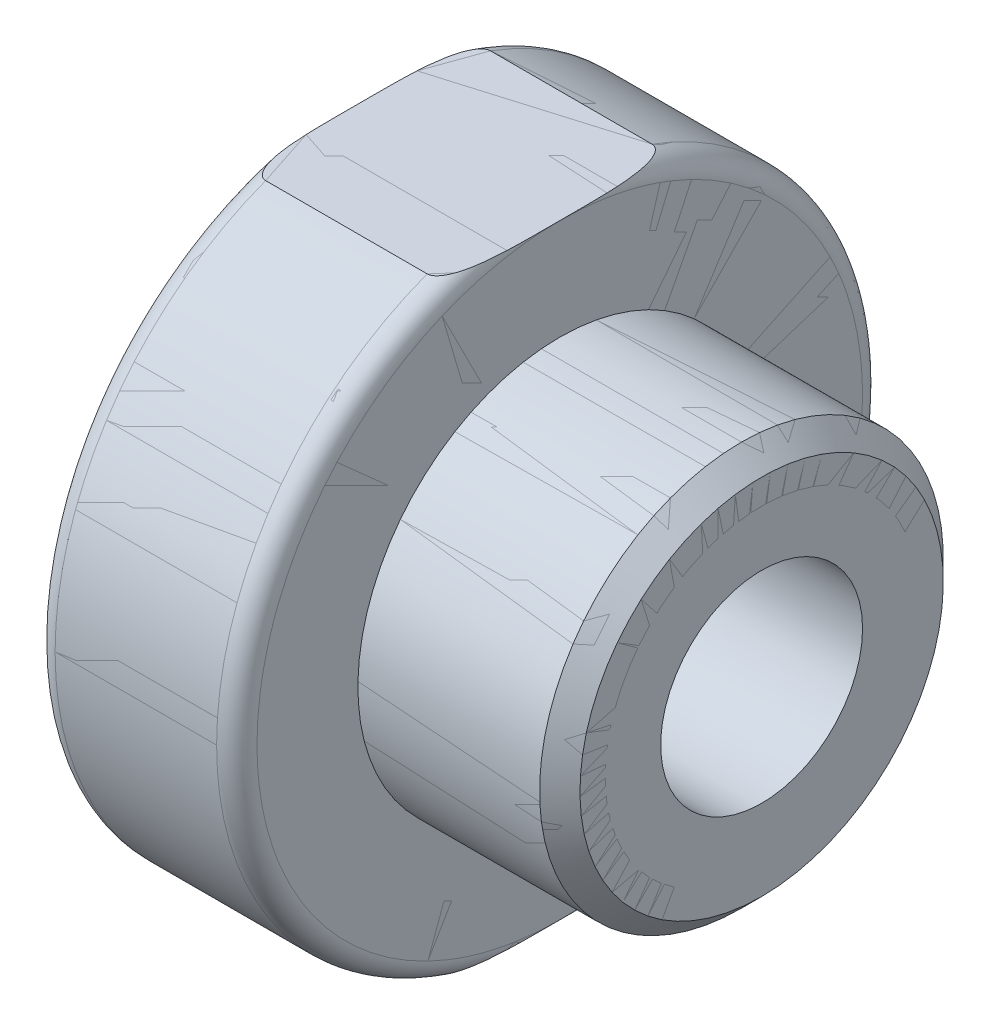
ISO-10303-21;
HEADER;
FILE_DESCRIPTION(('STEP AP214'),'2;1');
FILE_NAME('part.step','',(''),(''),'','','');
FILE_SCHEMA(('AUTOMOTIVE_DESIGN { 1 0 10303 214 1 1 1 1 }'));
ENDSEC;
DATA;
#1=APPLICATION_CONTEXT('core data for automotive mechanical design processes');
#2=APPLICATION_PROTOCOL_DEFINITION('international standard','automotive_design',2000,#1);
#3=PRODUCT_CONTEXT('',#1,'mechanical');
#4=PRODUCT('Part','Part','',(#3));
#5=PRODUCT_RELATED_PRODUCT_CATEGORY('part','',(#4));
#6=PRODUCT_DEFINITION_FORMATION('','',#4);
#7=PRODUCT_DEFINITION_CONTEXT('part definition',#1,'design');
#8=PRODUCT_DEFINITION('design','',#6,#7);
#9=PRODUCT_DEFINITION_SHAPE('','',#8);
#10=(LENGTH_UNIT() NAMED_UNIT(*) SI_UNIT(.MILLI.,.METRE.));
#11=(NAMED_UNIT(*) PLANE_ANGLE_UNIT() SI_UNIT($,.RADIAN.));
#12=(NAMED_UNIT(*) SI_UNIT($,.STERADIAN.) SOLID_ANGLE_UNIT());
#13=UNCERTAINTY_MEASURE_WITH_UNIT(LENGTH_MEASURE(1.E-05),#10,'distance_accuracy_value','');
#14=(GEOMETRIC_REPRESENTATION_CONTEXT(3) GLOBAL_UNCERTAINTY_ASSIGNED_CONTEXT((#13)) GLOBAL_UNIT_ASSIGNED_CONTEXT((#10,
#11,#12)) REPRESENTATION_CONTEXT('',''));
#15=CARTESIAN_POINT('',(0.,0.,0.));
#16=DIRECTION('',(0.,0.,1.));
#17=DIRECTION('',(1.,0.,0.));
#18=AXIS2_PLACEMENT_3D('',#15,#16,#17);
#19=CARTESIAN_POINT('',(15.,0.,0.));
#20=DIRECTION('',(1.,0.,0.));
#21=DIRECTION('',(0.,1.,0.));
#22=AXIS2_PLACEMENT_3D('',#19,#20,#21);
#23=CYLINDRICAL_SURFACE('',#22,10.);
#24=CARTESIAN_POINT('',(19.,0.,0.));
#25=DIRECTION('',(-1.,0.,0.));
#26=DIRECTION('',(0.,-1.,0.));
#27=AXIS2_PLACEMENT_3D('',#24,#25,#26);
#28=CIRCLE('',#27,10.);
#29=CARTESIAN_POINT('',(19.,-9.99999999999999,0.));
#30=VERTEX_POINT('',#29);
#31=EDGE_CURVE('P0_E200',#30,#30,#28,.F.);
#32=ORIENTED_EDGE('',*,*,#31,.F.);
#33=EDGE_LOOP('',(#32));
#34=FACE_BOUND('',#33,.T.);
#35=CARTESIAN_POINT('',(10.,0.,0.));
#36=DIRECTION('',(1.,0.,0.));
#37=DIRECTION('',(0.,1.,0.));
#38=AXIS2_PLACEMENT_3D('',#35,#36,#37);
#39=CIRCLE('',#38,10.);
#40=CARTESIAN_POINT('',(10.,10.,0.));
#41=VERTEX_POINT('',#40);
#42=EDGE_CURVE('P0_E208',#41,#41,#39,.F.);
#43=ORIENTED_EDGE('',*,*,#42,.F.);
#44=EDGE_LOOP('',(#43));
#45=FACE_BOUND('',#44,.T.);
#46=ADVANCED_FACE('P0_F26',(#34,#45),#23,.T.);
#47=CARTESIAN_POINT('',(19.,0.,0.));
#48=DIRECTION('',(-1.,0.,0.));
#49=DIRECTION('',(0.,-1.,0.));
#50=AXIS2_PLACEMENT_3D('',#47,#48,#49);
#51=CONICAL_SURFACE('',#50,10.,0.785398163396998);
#52=ORIENTED_EDGE('',*,*,#31,.T.);
#53=EDGE_LOOP('',(#52));
#54=FACE_BOUND('',#53,.T.);
#55=CARTESIAN_POINT('',(20.0000000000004,0.,0.));
#56=DIRECTION('',(-1.,0.,0.));
#57=DIRECTION('',(0.,-1.,0.));
#58=AXIS2_PLACEMENT_3D('',#55,#56,#57);
#59=CIRCLE('',#58,9.00000000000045);
#60=CARTESIAN_POINT('',(20.0000000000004,-9.00000000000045,0.));
#61=VERTEX_POINT('',#60);
#62=EDGE_CURVE('P0_E86',#61,#61,#59,.F.);
#63=ORIENTED_EDGE('',*,*,#62,.F.);
#64=EDGE_LOOP('',(#63));
#65=FACE_BOUND('',#64,.T.);
#66=ADVANCED_FACE('P0_F251',(#54,#65),#51,.T.);
#67=CARTESIAN_POINT('',(10.,13.,0.));
#68=DIRECTION('',(1.,0.,0.));
#69=DIRECTION('',(0.,0.,-1.));
#70=AXIS2_PLACEMENT_3D('',#67,#68,#69);
#71=PLANE('',#70);
#72=ORIENTED_EDGE('',*,*,#42,.T.);
#73=EDGE_LOOP('',(#72));
#74=FACE_BOUND('',#73,.T.);
#75=CARTESIAN_POINT('',(9.99999999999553,0.,-15.));
#76=CARTESIAN_POINT('',(9.99999999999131,-0.209098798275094,-14.99999547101));
#77=CARTESIAN_POINT('',(9.99999999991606,-0.418197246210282,-14.9956141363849));
#78=CARTESIAN_POINT('',(9.99999999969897,-0.836028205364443,-14.9781175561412));
#79=CARTESIAN_POINT('',(9.99999999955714,-1.04476071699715,-14.9650023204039));
#80=CARTESIAN_POINT('',(9.99999999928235,-1.4614948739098,-14.9300576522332));
#81=CARTESIAN_POINT('',(9.9999999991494,-1.66949651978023,-14.9082282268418));
#82=CARTESIAN_POINT('',(9.99999999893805,-2.08440546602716,-14.8558942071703));
#83=CARTESIAN_POINT('',(9.99999999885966,-2.29131276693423,-14.8253896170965));
#84=CARTESIAN_POINT('',(9.99999999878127,-2.70367140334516,-14.7557583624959));
#85=CARTESIAN_POINT('',(9.99999999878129,-2.90912273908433,-14.7166316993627));
#86=CARTESIAN_POINT('',(9.99999999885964,-3.31821040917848,-14.6298247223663));
#87=CARTESIAN_POINT('',(9.99999999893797,-3.52184674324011,-14.5821444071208));
#88=CARTESIAN_POINT('',(9.99999999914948,-3.92694843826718,-14.4783135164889));
#89=CARTESIAN_POINT('',(9.99999999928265,-4.12841379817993,-14.4221629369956));
#90=CARTESIAN_POINT('',(9.99999999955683,-4.52882175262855,-14.3014893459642));
#91=CARTESIAN_POINT('',(9.99999999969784,-4.72776434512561,-14.2369663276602));
#92=CARTESIAN_POINT('',(9.99999999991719,-5.12277793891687,-14.0996617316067));
#93=CARTESIAN_POINT('',(9.99999999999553,-5.31884893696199,-14.026880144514));
#94=CARTESIAN_POINT('',(9.99999999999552,-5.72367839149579,-13.8668990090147));
#95=CARTESIAN_POINT('',(9.99999999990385,-5.93216367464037,-13.7790071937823));
#96=CARTESIAN_POINT('',(9.99999999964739,-6.34507854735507,-13.593823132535));
#97=CARTESIAN_POINT('',(9.99999999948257,-6.54950540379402,-13.4965247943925));
#98=CARTESIAN_POINT('',(9.9999999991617,-6.95387787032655,-13.2927089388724));
#99=CARTESIAN_POINT('',(9.99999999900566,-7.15382047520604,-13.1861854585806));
#100=CARTESIAN_POINT('',(9.99999999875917,-7.54880439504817,-12.9641201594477));
#101=CARTESIAN_POINT('',(9.99999999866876,-7.74384243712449,-12.8485725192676));
#102=CARTESIAN_POINT('',(9.99999999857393,-8.12860655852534,-12.608678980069));
#103=CARTESIAN_POINT('',(9.99999999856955,-8.31832910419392,-12.4843274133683));
#104=CARTESIAN_POINT('',(9.9999999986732,-8.69206103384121,-12.227065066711));
#105=CARTESIAN_POINT('',(9.99999999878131,-8.87606663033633,-12.094148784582));
#106=CARTESIAN_POINT('',(9.99999999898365,-9.23797400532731,-11.8200142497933));
#107=CARTESIAN_POINT('',(9.99999999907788,-9.41587175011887,-11.6787906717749));
#108=CARTESIAN_POINT('',(9.99999999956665,-9.76518418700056,-11.388317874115));
#109=CARTESIAN_POINT('',(9.99999999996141,-9.93659460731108,-11.239063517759));
#110=CARTESIAN_POINT('',(9.99999999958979,-10.2725651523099,-10.9328190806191));
#111=CARTESIAN_POINT('',(9.99999999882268,-10.4371207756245,-10.7758240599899));
#112=CARTESIAN_POINT('',(10.0000000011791,-10.7603915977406,-10.4530588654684));
#113=CARTESIAN_POINT('',(10.0000000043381,-10.9190398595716,-10.287221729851));
#114=CARTESIAN_POINT('',(9.99999999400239,-11.2374956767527,-9.93881829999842));
#115=CARTESIAN_POINT('',(9.99999997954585,-11.3968516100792,-9.75583754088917));
#116=CARTESIAN_POINT('',(9.99999997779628,-11.6250907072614,-9.4803483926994));
#117=CARTESIAN_POINT('',(9.99999998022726,-11.6975513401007,-9.39077377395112));
#118=CARTESIAN_POINT('',(9.99999999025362,-11.9897907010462,-9.02085904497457));
#119=CARTESIAN_POINT('',(9.99999999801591,-12.2007034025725,-8.73337985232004));
#120=CARTESIAN_POINT('',(10.0000000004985,-12.5133485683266,-8.27381572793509));
#121=CARTESIAN_POINT('',(9.99999999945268,-12.6223104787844,-8.10657216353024));
#122=CARTESIAN_POINT('',(9.99999999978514,-12.8471305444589,-7.7460250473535));
#123=CARTESIAN_POINT('',(10.0000000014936,-12.9620649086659,-7.55214299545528));
#124=CARTESIAN_POINT('',(9.99999999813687,-13.2052322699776,-7.12013995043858));
#125=CARTESIAN_POINT('',(9.99999999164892,-13.331528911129,-6.8809251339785));
#126=CARTESIAN_POINT('',(9.99999997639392,-13.53083462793,-6.47732341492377));
#127=CARTESIAN_POINT('',(9.99999996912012,-13.6075136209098,-6.31473624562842));
#128=CARTESIAN_POINT('',(9.99999998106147,-13.7495692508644,-5.99855077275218));
#129=CARTESIAN_POINT('',(9.99999999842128,-13.8153619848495,-5.84514014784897));
#130=CARTESIAN_POINT('',(10.0000000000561,-13.8856983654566,-5.67344529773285));
#131=CARTESIAN_POINT('',(10.000000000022,-13.8927392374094,-5.65616825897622));
#132=CARTESIAN_POINT('',(9.99999999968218,-13.9802913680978,-5.44020714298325));
#133=CARTESIAN_POINT('',(10.0000000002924,-14.056692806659,-5.23981791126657));
#134=CARTESIAN_POINT('',(9.9999999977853,-14.1632477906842,-4.94116809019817));
#135=CARTESIAN_POINT('',(9.99999999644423,-14.196760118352,-4.84408557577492));
#136=CARTESIAN_POINT('',(9.99999999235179,-14.2776098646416,-4.60183513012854));
#137=CARTESIAN_POINT('',(9.9999999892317,-14.3237375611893,-4.45626087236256));
#138=CARTESIAN_POINT('',(9.99999998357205,-14.4290666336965,-4.10526853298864));
#139=CARTESIAN_POINT('',(9.99999998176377,-14.4861182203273,-3.8992020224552));
#140=CARTESIAN_POINT('',(9.99999998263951,-14.5913438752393,-3.48482370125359));
#141=CARTESIAN_POINT('',(9.99999998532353,-14.6395179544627,-3.27651189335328));
#142=CARTESIAN_POINT('',(9.99999999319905,-14.7331247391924,-2.82810450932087));
#143=CARTESIAN_POINT('',(9.99999999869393,-14.7771832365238,-2.58771871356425));
#144=CARTESIAN_POINT('',(10.0000000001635,-14.8282607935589,-2.26488712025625));
#145=CARTESIAN_POINT('',(10.0000000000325,-14.8404909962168,-2.183237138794));
#146=CARTESIAN_POINT('',(9.99999999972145,-14.8748340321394,-1.9403587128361));
#147=CARTESIAN_POINT('',(9.99999999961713,-14.8950102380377,-1.77885121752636));
#148=CARTESIAN_POINT('',(9.99999999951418,-14.9378070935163,-1.38415711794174));
#149=CARTESIAN_POINT('',(9.99999999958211,-14.9576053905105,-1.15066182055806));
#150=CARTESIAN_POINT('',(9.99999999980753,-14.9906264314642,-0.611609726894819));
#151=CARTESIAN_POINT('',(9.99999999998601,-14.9999972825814,-0.305812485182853));
#152=CARTESIAN_POINT('',(9.99999999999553,-15.,-9.0078166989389E-10));
#153=B_SPLINE_CURVE_WITH_KNOTS('',3,(#75,#76,#77,#78,#79,#80,#81,#82,#83,#84,#85,#86,#87,#88,
#89,#90,#91,#92,#93,#94,#95,#96,#97,#98,#99,#100,#101,#102,#103,#104,#105,#106,#107,#108,#109,
#110,#111,#112,#113,#114,#115,#116,#117,#118,#119,#120,#121,#122,#123,#124,#125,#126,#127,#128,
#129,#130,#131,#132,#133,#134,#135,#136,#137,#138,#139,#140,#141,#142,#143,#144,#145,#146,#147,
#148,#149,#150,#151,#152),.UNSPECIFIED.,.F.,.F.,(4,2,2,2,2,2,2,2,2,2,2,2,2,2,2,2,2,2,2,2,2,2,2,
2,2,2,2,2,2,2,2,2,2,2,2,2,2,2,4),(0.,0.627250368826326,1.25450002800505,1.88174918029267,
2.50899802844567,3.13624677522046,3.76349562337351,4.39074477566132,5.01799443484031,
5.64524480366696,6.32377348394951,7.00274459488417,7.68215789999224,8.36201316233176,
9.04231014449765,9.72304860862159,10.4042283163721,11.0858490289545,11.767910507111,
12.4561912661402,13.1837955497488,13.5294240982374,14.597961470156,15.1966620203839,
15.8725997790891,16.6836983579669,17.2228777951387,17.7235363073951,17.7795065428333,
18.4226316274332,18.7307292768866,19.188779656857,19.8300276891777,20.4712749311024,
21.204107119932,21.4517840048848,21.9399823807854,22.6427262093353,23.559980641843),.UNSPECIFIED.);
#154=CARTESIAN_POINT('',(9.99999999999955,3.53277615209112E-06,-14.9999999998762));
#155=VERTEX_POINT('',#154);
#156=CARTESIAN_POINT('',(9.99999999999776,-15.,-9.00781299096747E-10));
#157=VERTEX_POINT('',#156);
#158=EDGE_CURVE('P0_E92',#155,#157,#153,.T.);
#159=ORIENTED_EDGE('',*,*,#158,.F.);
#160=CARTESIAN_POINT('',(10.,15.,0.));
#161=CARTESIAN_POINT('',(9.99999999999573,14.9999954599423,-0.209744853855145));
#162=CARTESIAN_POINT('',(9.99999999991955,14.9955869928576,-0.419489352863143));
#163=CARTESIAN_POINT('',(9.99999999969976,14.9779821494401,-0.838609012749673));
#164=CARTESIAN_POINT('',(9.99999999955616,14.9647857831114,-1.04798417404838));
#165=CARTESIAN_POINT('',(9.99999999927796,14.9296251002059,-1.46599683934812));
#166=CARTESIAN_POINT('',(9.99999999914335,14.9076607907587,-1.67463434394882));
#167=CARTESIAN_POINT('',(9.99999999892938,14.8550037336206,-2.09080484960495));
#168=CARTESIAN_POINT('',(9.99999999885,14.8243109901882,-2.29833785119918));
#169=CARTESIAN_POINT('',(9.99999999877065,14.7542508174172,-2.71193439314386));
#170=CARTESIAN_POINT('',(9.99999999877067,14.7148833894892,-2.91799793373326));
#171=CARTESIAN_POINT('',(9.99999999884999,14.6275431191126,-3.32829321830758));
#172=CARTESIAN_POINT('',(9.9999999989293,14.5795702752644,-3.5325249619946));
#173=CARTESIAN_POINT('',(9.99999999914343,14.4751035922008,-3.93879743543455));
#174=CARTESIAN_POINT('',(9.99999999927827,14.4186097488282,-4.14083816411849));
#175=CARTESIAN_POINT('',(9.99999999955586,14.2972001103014,-4.54237361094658));
#176=CARTESIAN_POINT('',(9.99999999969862,14.2322843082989,-4.74186832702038));
#177=CARTESIAN_POINT('',(9.99999999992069,14.0941459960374,-5.1379598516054));
#178=CARTESIAN_POINT('',(10.,14.0209234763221,-5.33455665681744));
#179=CARTESIAN_POINT('',(10.,13.8602560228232,-5.73974377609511));
#180=CARTESIAN_POINT('',(9.99999999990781,13.7721468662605,-5.94807107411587));
#181=CARTESIAN_POINT('',(9.99999999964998,13.5865056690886,-6.36073288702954));
#182=CARTESIAN_POINT('',(9.99999999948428,13.4889643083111,-6.56506320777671));
#183=CARTESIAN_POINT('',(9.9999999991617,13.2846308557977,-6.96930111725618));
#184=CARTESIAN_POINT('',(9.99999999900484,13.177829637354,-7.16920409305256));
#185=CARTESIAN_POINT('',(9.99999999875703,12.9551686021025,-7.56416212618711));
#186=CARTESIAN_POINT('',(9.99999999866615,12.8392998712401,-7.75921215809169));
#187=CARTESIAN_POINT('',(9.99999999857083,12.598715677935,-8.1440476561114));
#188=CARTESIAN_POINT('',(9.99999999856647,12.4739915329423,-8.33382769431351));
#189=CARTESIAN_POINT('',(9.9999999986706,12.2159278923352,-8.70771526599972));
#190=CARTESIAN_POINT('',(9.99999999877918,12.0825799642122,-8.89181697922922));
#191=CARTESIAN_POINT('',(9.9999999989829,11.8075189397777,-9.25394977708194));
#192=CARTESIAN_POINT('',(9.99999999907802,11.6657976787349,-9.43197466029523));
#193=CARTESIAN_POINT('',(9.99999999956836,11.374259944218,-9.78156639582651));
#194=CARTESIAN_POINT('',(9.99999999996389,11.224435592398,-9.95312667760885));
#195=CARTESIAN_POINT('',(9.99999999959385,10.9169758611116,-10.2894132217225));
#196=CARTESIAN_POINT('',(9.99999999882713,10.7593329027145,-10.454132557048));
#197=CARTESIAN_POINT('',(10.00000000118,10.4357373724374,-10.7771885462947));
#198=CARTESIAN_POINT('',(10.000000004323,10.2697403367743,-10.9354806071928));
#199=CARTESIAN_POINT('',(9.99999999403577,9.92102868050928,-11.2532010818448));
#200=CARTESIAN_POINT('',(9.99999997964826,9.73790077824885,-11.4121777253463));
#201=CARTESIAN_POINT('',(9.99999997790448,9.46220535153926,-11.6398617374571));
#202=CARTESIAN_POINT('',(9.99999998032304,9.37256250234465,-11.7121468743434));
#203=CARTESIAN_POINT('',(9.99999999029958,9.00240459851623,-12.003646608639));
#204=CARTESIAN_POINT('',(9.99999999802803,8.71477281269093,-12.2139947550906));
#205=CARTESIAN_POINT('',(10.0000000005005,8.25516307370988,-12.5256568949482));
#206=CARTESIAN_POINT('',(9.99999999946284,8.08801400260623,-12.6342053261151));
#207=CARTESIAN_POINT('',(9.99999999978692,7.72769204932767,-12.8581604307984));
#208=CARTESIAN_POINT('',(10.0000000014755,7.53394376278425,-12.9726452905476));
#209=CARTESIAN_POINT('',(9.99999999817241,7.1022649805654,-13.2148456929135));
#210=CARTESIAN_POINT('',(9.99999999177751,6.8632466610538,-13.3406292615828));
#211=CARTESIAN_POINT('',(9.99999997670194,6.46002533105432,-13.5390961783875));
#212=CARTESIAN_POINT('',(9.99999996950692,6.29761221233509,-13.6154413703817));
#213=CARTESIAN_POINT('',(9.99999998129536,5.98177848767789,-13.7568697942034));
#214=CARTESIAN_POINT('',(9.99999999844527,5.82854440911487,-13.8223679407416));
#215=CARTESIAN_POINT('',(10.0000000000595,5.65707317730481,-13.8923763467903));
#216=CARTESIAN_POINT('',(10.000000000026,5.63983703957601,-13.8993769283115));
#217=CARTESIAN_POINT('',(9.99999999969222,5.4243199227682,-13.9864553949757));
#218=CARTESIAN_POINT('',(10.0000000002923,5.22434705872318,-14.062441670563));
#219=CARTESIAN_POINT('',(9.99999999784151,4.92632433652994,-14.1684149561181));
#220=CARTESIAN_POINT('',(9.99999999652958,4.82944308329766,-14.2017450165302));
#221=CARTESIAN_POINT('',(9.99999999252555,4.58775339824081,-14.2821348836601));
#222=CARTESIAN_POINT('',(9.99999998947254,4.44254239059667,-14.3279920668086));
#223=CARTESIAN_POINT('',(9.99999998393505,4.0924358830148,-14.4327005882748));
#224=CARTESIAN_POINT('',(9.99999998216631,3.88689758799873,-14.4894135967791));
#225=CARTESIAN_POINT('',(9.99999998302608,3.47359540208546,-14.5940100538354));
#226=CARTESIAN_POINT('',(9.9999999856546,3.26583151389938,-14.6418935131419));
#227=CARTESIAN_POINT('',(9.99999999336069,2.81861623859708,-14.734930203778));
#228=CARTESIAN_POINT('',(9.99999999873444,2.57887721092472,-14.7787167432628));
#229=CARTESIAN_POINT('',(10.0000000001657,2.25691553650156,-14.8294746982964));
#230=CARTESIAN_POINT('',(10.0000000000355,2.17548147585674,-14.8416285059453));
#231=CARTESIAN_POINT('',(9.99999999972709,1.93334627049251,-14.8757412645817));
#232=CARTESIAN_POINT('',(9.99999999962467,1.7723690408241,-14.8957771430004));
#233=CARTESIAN_POINT('',(9.99999999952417,1.37903913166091,-14.9382673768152));
#234=CARTESIAN_POINT('',(9.99999999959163,1.14638127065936,-14.9579210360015));
#235=CARTESIAN_POINT('',(9.99999999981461,0.609312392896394,-14.9906967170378));
#236=CARTESIAN_POINT('',(9.99999999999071,0.304663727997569,-14.9999972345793));
#237=CARTESIAN_POINT('',(10.,0.,-15.));
#238=B_SPLINE_CURVE_WITH_KNOTS('',3,(#160,#161,#162,#163,#164,#165,#166,#167,#168,#169,#170,
#171,#172,#173,#174,#175,#176,#177,#178,#179,#180,#181,#182,#183,#184,#185,#186,#187,#188,#189,
#190,#191,#192,#193,#194,#195,#196,#197,#198,#199,#200,#201,#202,#203,#204,#205,#206,#207,#208,
#209,#210,#211,#212,#213,#214,#215,#216,#217,#218,#219,#220,#221,#222,#223,#224,#225,#226,#227,
#228,#229,#230,#231,#232,#233,#234,#235,#236,#237),.UNSPECIFIED.,.F.,.F.,(4,2,2,2,2,2,2,2,2,2,2,
2,2,2,2,2,2,2,2,2,2,2,2,2,2,2,2,2,2,2,2,2,2,2,2,2,2,2,4),(0.,0.629188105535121,1.25837549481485,
1.88756237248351,2.51674894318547,3.14593541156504,3.77512198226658,4.40430885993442,
5.03349624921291,5.66268435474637,6.34103037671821,7.02005367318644,7.69975400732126,
8.38013114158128,9.06118483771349,9.74291485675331,10.4253209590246,11.1084029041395,
11.7921604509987,12.4800505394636,13.207241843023,13.5526988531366,14.62060656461,
15.2183937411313,15.8933003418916,16.7031616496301,17.2414426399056,17.7412669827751,
17.7970780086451,18.4385945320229,18.7459432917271,19.202710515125,19.8421623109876,
20.4816133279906,21.2123928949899,21.4593952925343,21.9459639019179,22.646170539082,
23.559980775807),.UNSPECIFIED.);
#239=CARTESIAN_POINT('',(10.000000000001,14.9999999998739,-3.5864034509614E-06));
#240=VERTEX_POINT('',#239);
#241=EDGE_CURVE('P0_E82',#240,#155,#238,.T.);
#242=ORIENTED_EDGE('',*,*,#241,.F.);
#243=CARTESIAN_POINT('',(10.0000000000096,0.,15.));
#244=CARTESIAN_POINT('',(10.0000000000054,0.208776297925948,14.9999954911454));
#245=CARTESIAN_POINT('',(9.99999999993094,0.417552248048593,14.9956276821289));
#246=CARTESIAN_POINT('',(9.99999999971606,0.834739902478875,14.9781850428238));
#247=CARTESIAN_POINT('',(9.99999999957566,1.04315160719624,14.965110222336));
#248=CARTESIAN_POINT('',(9.99999999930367,1.45924752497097,14.930273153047));
#249=CARTESIAN_POINT('',(9.99999999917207,1.66693173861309,14.9085109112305));
#250=CARTESIAN_POINT('',(9.99999999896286,2.08121086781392,14.8563377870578));
#251=CARTESIAN_POINT('',(9.99999999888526,2.28780578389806,14.8259269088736));
#252=CARTESIAN_POINT('',(9.99999999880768,2.69954635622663,14.7565092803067));
#253=CARTESIAN_POINT('',(9.99999999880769,2.9046920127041,14.7175025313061));
#254=CARTESIAN_POINT('',(9.99999999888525,3.31317666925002,14.6309611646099));
#255=CARTESIAN_POINT('',(9.99999999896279,3.51651566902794,14.5834265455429));
#256=CARTESIAN_POINT('',(9.99999999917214,3.92103265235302,14.479912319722));
#257=CARTESIAN_POINT('',(9.99999999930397,4.12221063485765,14.4239327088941));
#258=CARTESIAN_POINT('',(9.99999999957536,4.52205538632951,14.3036257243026));
#259=CARTESIAN_POINT('',(9.99999999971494,4.72072215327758,14.2392983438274));
#260=CARTESIAN_POINT('',(9.99999999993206,5.11519716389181,14.102409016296));
#261=CARTESIAN_POINT('',(10.0000000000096,5.31100540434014,14.0298470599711));
#262=CARTESIAN_POINT('',(10.0000000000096,5.71576755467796,13.8701640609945));
#263=CARTESIAN_POINT('',(9.99999999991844,5.92444126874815,13.7823317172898));
#264=CARTESIAN_POINT('',(9.99999999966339,6.33766934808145,13.59728027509));
#265=CARTESIAN_POINT('',(9.99999999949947,6.54222226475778,13.5000579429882));
#266=CARTESIAN_POINT('',(9.99999999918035,6.94678660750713,13.2964162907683));
#267=CARTESIAN_POINT('',(9.99999999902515,7.14679644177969,13.1899938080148));
#268=CARTESIAN_POINT('',(9.99999999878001,7.54185868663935,12.9681608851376));
#269=CARTESIAN_POINT('',(9.9999999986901,7.73690936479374,12.852747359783));
#270=CARTESIAN_POINT('',(9.99999999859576,8.12164748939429,12.6131602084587));
#271=CARTESIAN_POINT('',(9.99999999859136,8.31133306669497,12.4889835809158));
#272=CARTESIAN_POINT('',(9.99999999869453,8.6849453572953,12.2321165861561));
#273=CARTESIAN_POINT('',(9.99999999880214,8.86887006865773,12.0994233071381));
#274=CARTESIAN_POINT('',(9.99999999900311,9.23057620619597,11.8257870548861));
#275=CARTESIAN_POINT('',(9.99999999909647,9.40835550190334,11.684841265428));
#276=CARTESIAN_POINT('',(9.99999999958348,9.75739844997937,11.3949825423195));
#277=CARTESIAN_POINT('',(9.99999999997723,9.92865984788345,11.2460668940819));
#278=CARTESIAN_POINT('',(9.99999999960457,10.2643071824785,10.9405640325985));
#279=CARTESIAN_POINT('',(9.99999999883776,10.4286907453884,10.7839742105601));
#280=CARTESIAN_POINT('',(10.0000000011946,10.7519820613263,10.4617101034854));
#281=CARTESIAN_POINT('',(10.0000000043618,10.9108078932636,10.295953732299));
#282=CARTESIAN_POINT('',(9.99999999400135,11.2296303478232,9.94770613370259));
#283=CARTESIAN_POINT('',(9.99999997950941,11.3891754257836,9.76479985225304));
#284=CARTESIAN_POINT('',(9.9999999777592,11.6176861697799,9.48942145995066));
#285=CARTESIAN_POINT('',(9.99999998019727,11.6902292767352,9.39988777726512));
#286=CARTESIAN_POINT('',(9.99999999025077,11.9828382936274,9.03009685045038));
#287=CARTESIAN_POINT('',(9.99999999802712,12.1940378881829,8.74268888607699));
#288=CARTESIAN_POINT('',(10.0000000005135,12.5071788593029,8.28314290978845));
#289=CARTESIAN_POINT('',(9.99999999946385,12.6163476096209,8.11585279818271));
#290=CARTESIAN_POINT('',(9.99999999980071,12.8416004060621,7.75519457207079));
#291=CARTESIAN_POINT('',(10.000000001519,12.9567596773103,7.56124640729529));
#292=CARTESIAN_POINT('',(9.99999999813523,13.2004109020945,7.12908289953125));
#293=CARTESIAN_POINT('',(9.99999999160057,13.3269643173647,6.88977072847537));
#294=CARTESIAN_POINT('',(9.99999997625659,13.5266899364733,6.4859802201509));
#295=CARTESIAN_POINT('',(9.99999996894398,13.6035360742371,6.32330654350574));
#296=CARTESIAN_POINT('',(9.99999998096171,13.745905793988,6.0069461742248));
#297=CARTESIAN_POINT('',(9.99999999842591,13.8118460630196,5.8534477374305));
#298=CARTESIAN_POINT('',(10.0000000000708,13.8823460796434,5.68164319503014));
#299=CARTESIAN_POINT('',(10.0000000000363,13.8894064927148,5.6643473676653));
#300=CARTESIAN_POINT('',(9.99999999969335,13.977195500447,5.44816635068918));
#301=CARTESIAN_POINT('',(10.0000000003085,14.0538051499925,5.24756933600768));
#302=CARTESIAN_POINT('',(9.99999999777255,14.1606525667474,4.94860463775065));
#303=CARTESIAN_POINT('',(9.99999999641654,14.1942569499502,4.85141977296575));
#304=CARTESIAN_POINT('',(9.999999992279,14.2753380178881,4.60888717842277));
#305=CARTESIAN_POINT('',(9.99999998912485,14.3216014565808,4.46313124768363));
#306=CARTESIAN_POINT('',(9.99999998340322,14.4272419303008,4.11169583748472));
#307=CARTESIAN_POINT('',(9.99999998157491,14.4844634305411,3.90536509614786));
#308=CARTESIAN_POINT('',(9.99999998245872,14.5900048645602,3.49044840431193));
#309=CARTESIAN_POINT('',(9.99999998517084,14.6383248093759,3.28186245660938));
#310=CARTESIAN_POINT('',(9.9999999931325,14.7322177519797,2.83285857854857));
#311=CARTESIAN_POINT('',(9.99999999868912,14.7764127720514,2.5921491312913));
#312=CARTESIAN_POINT('',(10.0000000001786,14.8276496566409,2.26888935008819));
#313=CARTESIAN_POINT('',(10.0000000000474,14.8399171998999,2.18713848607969));
#314=CARTESIAN_POINT('',(9.99999999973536,14.8743747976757,1.94389824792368));
#315=CARTESIAN_POINT('',(9.99999999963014,14.8946213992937,1.78212832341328));
#316=CARTESIAN_POINT('',(9.99999999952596,14.9375730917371,1.38675149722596));
#317=CARTESIAN_POINT('',(9.99999999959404,14.9574447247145,1.15283410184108));
#318=CARTESIAN_POINT('',(9.99999999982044,14.990590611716,0.612777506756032));
#319=CARTESIAN_POINT('',(9.99999999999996,14.9999973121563,0.306396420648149));
#320=CARTESIAN_POINT('',(10.0000000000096,15.,0.));
#321=B_SPLINE_CURVE_WITH_KNOTS('',3,(#243,#244,#245,#246,#247,#248,#249,#250,#251,#252,#253,
#254,#255,#256,#257,#258,#259,#260,#261,#262,#263,#264,#265,#266,#267,#268,#269,#270,#271,#272,
#273,#274,#275,#276,#277,#278,#279,#280,#281,#282,#283,#284,#285,#286,#287,#288,#289,#290,#291,
#292,#293,#294,#295,#296,#297,#298,#299,#300,#301,#302,#303,#304,#305,#306,#307,#308,#309,#310,
#311,#312,#313,#314,#315,#316,#317,#318,#319,#320),.UNSPECIFIED.,.F.,.F.,(4,2,2,2,2,2,2,2,2,2,2,
2,2,2,2,2,2,2,2,2,2,2,2,2,2,2,2,2,2,2,2,2,2,2,2,2,2,2,4),(0.,0.626283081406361,1.25256545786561,
1.8788473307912,2.50512890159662,3.13141037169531,3.75769194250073,4.38397381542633,
5.01025619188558,5.63653927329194,6.31551908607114,6.99473355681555,7.6741824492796,
8.35386552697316,9.03378255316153,9.71393329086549,10.3943175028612,11.0749349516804,
11.7557853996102,12.4442592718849,13.17206769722,13.5177564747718,14.5866299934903,
15.1857861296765,15.8622382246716,16.6739539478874,17.2135818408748,17.7146567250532,
17.770701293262,18.4146305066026,18.7231085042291,19.1818012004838,19.8239483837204,
20.466094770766,21.199954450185,21.4479472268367,21.9369525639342,22.640975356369,
23.5599805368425),.UNSPECIFIED.);
#322=CARTESIAN_POINT('',(10.0000000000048,0.,15.0000000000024));
#323=VERTEX_POINT('',#322);
#324=EDGE_CURVE('P0_E76',#323,#240,#321,.T.);
#325=ORIENTED_EDGE('',*,*,#324,.F.);
#326=CARTESIAN_POINT('',(10.,-15.,-9.00780928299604E-10));
#327=CARTESIAN_POINT('',(9.99999999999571,-14.9999954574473,0.21006841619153));
#328=CARTESIAN_POINT('',(9.99999999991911,-14.9955733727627,0.420136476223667));
#329=CARTESIAN_POINT('',(9.99999999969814,-14.9779141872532,0.839901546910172));
#330=CARTESIAN_POINT('',(9.99999999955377,-14.96467709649,1.0495985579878));
#331=CARTESIAN_POINT('',(9.99999999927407,-14.9294079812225,1.46825150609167));
#332=CARTESIAN_POINT('',(9.99999999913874,-14.9073759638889,1.67720744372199));
#333=CARTESIAN_POINT('',(9.99999999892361,-14.8545567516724,2.09400970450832));
#334=CARTESIAN_POINT('',(9.9999999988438,-14.8237695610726,2.3018560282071));
#335=CARTESIAN_POINT('',(9.99999999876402,-14.7534940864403,2.71607242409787));
#336=CARTESIAN_POINT('',(9.99999999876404,-14.7140058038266,2.92244249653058));
#337=CARTESIAN_POINT('',(9.99999999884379,-14.6263978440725,3.33334239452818));
#338=CARTESIAN_POINT('',(9.99999999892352,-14.5782781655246,3.53787221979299));
#339=CARTESIAN_POINT('',(9.99999999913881,-14.473492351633,3.94473077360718));
#340=CARTESIAN_POINT('',(9.99999999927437,-14.4168262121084,4.14705950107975));
#341=CARTESIAN_POINT('',(9.99999999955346,-14.2950471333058,4.5491592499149));
#342=CARTESIAN_POINT('',(9.99999999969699,-14.2299341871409,4.74893026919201));
#343=CARTESIAN_POINT('',(9.99999999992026,-14.0913774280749,5.1455611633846));
#344=CARTESIAN_POINT('',(10.,-14.0179336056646,5.34242103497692));
#345=CARTESIAN_POINT('',(10.,-13.8569372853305,5.74774846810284));
#346=CARTESIAN_POINT('',(9.99999999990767,-13.7687363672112,5.95595882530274));
#347=CARTESIAN_POINT('',(9.99999999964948,-13.5828995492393,6.36842911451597));
#348=CARTESIAN_POINT('',(9.99999999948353,-13.4852522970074,6.57268393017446));
#349=CARTESIAN_POINT('',(9.99999999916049,-13.2806890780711,6.9768105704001));
#350=CARTESIAN_POINT('',(9.99999999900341,-13.1737619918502,7.17667676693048));
#351=CARTESIAN_POINT('',(9.99999999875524,-12.9508255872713,7.57159787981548));
#352=CARTESIAN_POINT('',(9.99999999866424,-12.8348054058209,7.76664666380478));
#353=CARTESIAN_POINT('',(9.99999999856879,-12.5938893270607,8.15151266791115));
#354=CARTESIAN_POINT('',(9.99999999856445,-12.4689828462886,8.3413232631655));
#355=CARTESIAN_POINT('',(9.9999999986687,-12.2105205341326,8.71530081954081));
#356=CARTESIAN_POINT('',(9.99999999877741,-12.0769544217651,8.89946067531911));
#357=CARTESIAN_POINT('',(9.99999999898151,-11.8014183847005,9.26173402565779));
#358=CARTESIAN_POINT('',(9.99999999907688,-11.6594385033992,9.43983994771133));
#359=CARTESIAN_POINT('',(9.99999999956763,-11.3673406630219,9.78961297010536));
#360=CARTESIAN_POINT('',(9.99999999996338,-11.21721309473,9.96127204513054));
#361=CARTESIAN_POINT('',(9.99999999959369,-10.909100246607,10.2977699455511));
#362=CARTESIAN_POINT('',(9.99999999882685,-10.7511057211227,10.4626003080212));
#363=CARTESIAN_POINT('',(10.0000000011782,-10.4270669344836,10.7855761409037));
#364=CARTESIAN_POINT('',(10.0000000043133,-10.2609907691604,10.9436895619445));
#365=CARTESIAN_POINT('',(9.99999999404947,-9.9121267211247,11.261041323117));
#366=CARTESIAN_POINT('',(9.99999997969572,-9.72892615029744,11.419827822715));
#367=CARTESIAN_POINT('',(9.99999997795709,-9.45313518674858,11.6472284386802));
#368=CARTESIAN_POINT('',(9.99999998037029,-9.36346502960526,11.7194205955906));
#369=CARTESIAN_POINT('',(9.9999999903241,-8.99318774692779,12.0105503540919));
#370=CARTESIAN_POINT('',(9.99999999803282,-8.70547460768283,12.2206207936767));
#371=CARTESIAN_POINT('',(10.0000000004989,-8.24583741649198,12.5317956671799));
#372=CARTESIAN_POINT('',(9.99999999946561,-8.07873629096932,12.6401374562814));
#373=CARTESIAN_POINT('',(9.9999999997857,-7.71852838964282,12.8636603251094));
#374=CARTESIAN_POINT('',(10.0000000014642,-7.52484775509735,12.9779205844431));
#375=CARTESIAN_POINT('',(9.99999999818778,-7.09333277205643,13.2196378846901));
#376=CARTESIAN_POINT('',(9.99999999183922,-6.85441359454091,13.3451651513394));
#377=CARTESIAN_POINT('',(9.99999997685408,-6.45138386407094,13.5432131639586));
#378=CARTESIAN_POINT('',(9.99999996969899,-6.28905828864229,13.6193916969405));
#379=CARTESIAN_POINT('',(9.99999998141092,-5.97340141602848,13.760506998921));
#380=CARTESIAN_POINT('',(9.99999999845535,-5.82025607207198,13.8258580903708));
#381=CARTESIAN_POINT('',(10.000000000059,-5.64889878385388,13.8957021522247));
#382=CARTESIAN_POINT('',(10.0000000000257,-5.63168477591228,13.9026819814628));
#383=CARTESIAN_POINT('',(9.99999999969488,-5.41639177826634,13.9895236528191));
#384=CARTESIAN_POINT('',(10.0000000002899,-5.21662750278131,14.065302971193));
#385=CARTESIAN_POINT('',(9.99999999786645,-4.91891698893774,14.1709869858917));
#386=CARTESIAN_POINT('',(9.99999999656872,-4.82213462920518,14.2042268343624));
#387=CARTESIAN_POINT('',(9.99999999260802,-4.58072354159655,14.2843881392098));
#388=CARTESIAN_POINT('',(9.99999998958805,-4.4356941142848,14.3301105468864));
#389=CARTESIAN_POINT('',(9.99999998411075,-4.08603037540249,14.434509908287));
#390=CARTESIAN_POINT('',(9.99999998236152,-3.88075606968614,14.4910542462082));
#391=CARTESIAN_POINT('',(9.99999998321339,-3.46799165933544,14.5953372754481));
#392=CARTESIAN_POINT('',(9.99999998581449,-3.26050155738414,14.6430759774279));
#393=CARTESIAN_POINT('',(9.99999999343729,-2.81388190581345,14.7358287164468));
#394=CARTESIAN_POINT('',(9.99999999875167,-2.57446599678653,14.7794798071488));
#395=CARTESIAN_POINT('',(10.0000000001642,-2.25298900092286,14.8300707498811));
#396=CARTESIAN_POINT('',(10.0000000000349,-2.17171302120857,14.8421794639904));
#397=CARTESIAN_POINT('',(9.99999999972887,-1.93002169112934,14.8761698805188));
#398=CARTESIAN_POINT('',(9.9999999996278,-1.76933169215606,14.8961351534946));
#399=CARTESIAN_POINT('',(9.99999999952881,-1.37668859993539,14.9384780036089));
#400=CARTESIAN_POINT('',(9.99999999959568,-1.14443185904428,14.9580641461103));
#401=CARTESIAN_POINT('',(9.99999999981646,-0.608279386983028,14.9907282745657));
#402=CARTESIAN_POINT('',(9.99999999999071,-0.304147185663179,14.9999972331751));
#403=CARTESIAN_POINT('',(10.,0.,15.));
#404=B_SPLINE_CURVE_WITH_KNOTS('',3,(#326,#327,#328,#329,#330,#331,#332,#333,#334,#335,#336,
#337,#338,#339,#340,#341,#342,#343,#344,#345,#346,#347,#348,#349,#350,#351,#352,#353,#354,#355,
#356,#357,#358,#359,#360,#361,#362,#363,#364,#365,#366,#367,#368,#369,#370,#371,#372,#373,#374,
#375,#376,#377,#378,#379,#380,#381,#382,#383,#384,#385,#386,#387,#388,#389,#390,#391,#392,#393,
#394,#395,#396,#397,#398,#399,#400,#401,#402,#403),.UNSPECIFIED.,.F.,.F.,(4,2,2,2,2,2,2,2,2,2,2,
2,2,2,2,2,2,2,2,2,2,2,2,2,2,2,2,2,2,2,2,2,2,2,2,2,2,2,4),(0.,0.630158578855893,1.26031643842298,
1.89047378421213,2.52063082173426,3.15078775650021,3.7809447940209,4.4111021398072,
5.04125999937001,5.6714185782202,6.34954913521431,7.02850502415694,7.70828600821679,
8.3888918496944,9.07032231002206,9.75257714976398,10.4356561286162,11.1195590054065,
11.8042855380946,12.4919780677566,13.2189605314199,13.5643063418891,14.6319204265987,
15.2292498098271,15.9036395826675,16.7128807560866,17.2507117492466,17.7501182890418,
17.8058443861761,18.4465564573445,18.753536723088,19.2096630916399,19.8482177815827,
20.4867716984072,21.2165261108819,21.4630395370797,21.9487273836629,22.6477192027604,
23.5599807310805),.UNSPECIFIED.);
#405=EDGE_CURVE('P0_E80',#157,#323,#404,.T.);
#406=ORIENTED_EDGE('',*,*,#405,.F.);
#407=EDGE_LOOP('',(#159,#242,#325,#406));
#408=FACE_BOUND('',#407,.T.);
#409=ADVANCED_FACE('P0_F79',(#74,#408),#71,.T.);
#410=CARTESIAN_POINT('',(20.,8.375,0.));
#411=DIRECTION('',(1.,0.,0.));
#412=DIRECTION('',(0.,0.,-1.));
#413=AXIS2_PLACEMENT_3D('',#410,#411,#412);
#414=PLANE('',#413);
#415=ORIENTED_EDGE('',*,*,#62,.T.);
#416=EDGE_LOOP('',(#415));
#417=FACE_BOUND('',#416,.T.);
#418=CARTESIAN_POINT('',(20.,0.,0.));
#419=DIRECTION('',(1.,0.,0.));
#420=DIRECTION('',(0.,0.,-1.));
#421=AXIS2_PLACEMENT_3D('',#418,#419,#420);
#422=CIRCLE('',#421,5.);
#423=CARTESIAN_POINT('',(20.,0.,-5.));
#424=VERTEX_POINT('',#423);
#425=EDGE_CURVE('P0_E237',#424,#424,#422,.T.);
#426=ORIENTED_EDGE('',*,*,#425,.F.);
#427=EDGE_LOOP('',(#426));
#428=FACE_BOUND('',#427,.T.);
#429=ADVANCED_FACE('P0_F111',(#417,#428),#414,.T.);
#430=CARTESIAN_POINT('',(9.,0.,6.93022028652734E-12));
#431=DIRECTION('',(1.,0.,0.));
#432=DIRECTION('',(0.,0.,-1.));
#433=AXIS2_PLACEMENT_3D('',#430,#431,#432);
#434=TOROIDAL_SURFACE('',#433,14.9999999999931,1.);
#435=CARTESIAN_POINT('',(9.,-15.0000000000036,5.56776436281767));
#436=CARTESIAN_POINT('',(9.02210863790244,-15.0000000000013,5.56782844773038));
#437=CARTESIAN_POINT('',(9.04413031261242,-15.0000000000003,5.56566072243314));
#438=CARTESIAN_POINT('',(9.08716494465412,-14.9999999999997,5.55746438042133));
#439=CARTESIAN_POINT('',(9.10818718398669,-14.9999999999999,5.5514853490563));
#440=CARTESIAN_POINT('',(9.153784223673,-15.0000000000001,5.5344471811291));
#441=CARTESIAN_POINT('',(9.17802951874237,-15.,5.52252319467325));
#442=CARTESIAN_POINT('',(9.22437332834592,-15.,5.49492020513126));
#443=CARTESIAN_POINT('',(9.24645976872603,-15.,5.47922161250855));
#444=CARTESIAN_POINT('',(9.30194432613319,-15.,5.43422601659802));
#445=CARTESIAN_POINT('',(9.33349118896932,-15.,5.40267312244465));
#446=CARTESIAN_POINT('',(9.39171765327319,-15.,5.33544822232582));
#447=CARTESIAN_POINT('',(9.41838772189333,-15.,5.29976836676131));
#448=CARTESIAN_POINT('',(9.47526465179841,-15.,5.21485036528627));
#449=CARTESIAN_POINT('',(9.50415497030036,-15.,5.16474167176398));
#450=CARTESIAN_POINT('',(9.55710416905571,-15.,5.06199724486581));
#451=CARTESIAN_POINT('',(9.58115376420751,-15.,5.00935689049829));
#452=CARTESIAN_POINT('',(9.62556795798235,-15.,4.90225334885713));
#453=CARTESIAN_POINT('',(9.64591341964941,-15.,4.84778232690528));
#454=CARTESIAN_POINT('',(9.68351271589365,-15.,4.7378567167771));
#455=CARTESIAN_POINT('',(9.70076935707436,-15.,4.68240307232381));
#456=CARTESIAN_POINT('',(9.74431144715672,-15.,4.53057808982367));
#457=CARTESIAN_POINT('',(9.76814634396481,-15.,4.43350659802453));
#458=CARTESIAN_POINT('',(9.81034274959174,-15.,4.2381630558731));
#459=CARTESIAN_POINT('',(9.82870075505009,-15.,4.13989027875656));
#460=CARTESIAN_POINT('',(9.86121446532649,-15.,3.94244727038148));
#461=CARTESIAN_POINT('',(9.87536110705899,-15.,3.84327557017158));
#462=CARTESIAN_POINT('',(9.90030514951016,-15.,3.644506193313));
#463=CARTESIAN_POINT('',(9.91110200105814,-15.,3.54490844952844));
#464=CARTESIAN_POINT('',(9.93959660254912,-15.,3.24503686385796));
#465=CARTESIAN_POINT('',(9.9532937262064,-15.,3.04438789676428));
#466=CARTESIAN_POINT('',(9.97400098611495,-15.,2.64303926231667));
#467=CARTESIAN_POINT('',(9.981019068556,-15.,2.44233994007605));
#468=CARTESIAN_POINT('',(9.99072277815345,-15.,2.05360926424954));
#469=CARTESIAN_POINT('',(9.99365541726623,-15.,1.86558350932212));
#470=CARTESIAN_POINT('',(9.99758114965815,-15.,1.4894500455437));
#471=CARTESIAN_POINT('',(9.99857355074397,-15.,1.30134233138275));
#472=CARTESIAN_POINT('',(9.99971618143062,-15.,0.927656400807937));
#473=CARTESIAN_POINT('',(9.99987756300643,-15.,0.742078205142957));
#474=CARTESIAN_POINT('',(9.9999813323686,-15.,0.463750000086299));
#475=CARTESIAN_POINT('',(9.99999288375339,-15.,0.370999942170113));
#476=CARTESIAN_POINT('',(10.0000004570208,-15.,0.185499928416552));
#477=CARTESIAN_POINT('',(9.99999647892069,-15.,0.0927499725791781));
#478=CARTESIAN_POINT('',(10.,-15.,-9.0078205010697E-10));
#479=B_SPLINE_CURVE_WITH_KNOTS('',3,(#435,#436,#437,#438,#439,#440,#441,#442,#443,#444,#445,
#446,#447,#448,#449,#450,#451,#452,#453,#454,#455,#456,#457,#458,#459,#460,#461,#462,#463,#464,
#465,#466,#467,#468,#469,#470,#471,#472,#473,#474,#475,#476,#477,#478),.UNSPECIFIED.,.F.,.F.,(4,
2,2,2,2,2,2,2,2,2,2,2,2,2,2,2,2,2,2,2,2,4),(0.,0.0660798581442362,0.131317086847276,
0.211920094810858,0.292950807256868,0.426051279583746,0.559409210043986,0.732530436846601,
0.905980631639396,1.0803029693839,1.25446609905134,1.55408666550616,1.85389847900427,
2.15435091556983,2.45485258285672,3.05798563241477,3.6604002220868,4.22452651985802,
4.78885403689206,5.34558837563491,5.6238385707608,5.90208845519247),.UNSPECIFIED.);
#480=CARTESIAN_POINT('',(9.,-14.9999999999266,5.56776436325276));
#481=VERTEX_POINT('',#480);
#482=EDGE_CURVE('P0_E90',#481,#157,#479,.T.);
#483=ORIENTED_EDGE('',*,*,#482,.T.);
#484=ORIENTED_EDGE('',*,*,#405,.T.);
#485=ORIENTED_EDGE('',*,*,#324,.T.);
#486=CARTESIAN_POINT('',(9.,15.,5.56776436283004));
#487=CARTESIAN_POINT('',(9.02210863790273,15.,5.56782844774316));
#488=CARTESIAN_POINT('',(9.04413031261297,15.,5.56566072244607));
#489=CARTESIAN_POINT('',(9.08716494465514,15.,5.55746438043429));
#490=CARTESIAN_POINT('',(9.10818718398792,15.,5.55148534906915));
#491=CARTESIAN_POINT('',(9.15378422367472,15.,5.53444718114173));
#492=CARTESIAN_POINT('',(9.17802951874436,15.,5.52252319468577));
#493=CARTESIAN_POINT('',(9.22437332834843,15.,5.4949202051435));
#494=CARTESIAN_POINT('',(9.24645976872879,15.,5.47922161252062));
#495=CARTESIAN_POINT('',(9.30194432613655,15.,5.4342260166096));
#496=CARTESIAN_POINT('',(9.33349118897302,15.,5.4026731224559));
#497=CARTESIAN_POINT('',(9.3917176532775,15.,5.33544822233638));
#498=CARTESIAN_POINT('',(9.41838772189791,15.,5.2997683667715));
#499=CARTESIAN_POINT('',(9.47526465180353,15.,5.21485036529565));
#500=CARTESIAN_POINT('',(9.50415497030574,15.,5.16474167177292));
#501=CARTESIAN_POINT('',(9.55710416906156,15.,5.06199724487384));
#502=CARTESIAN_POINT('',(9.58115376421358,15.,5.00935689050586));
#503=CARTESIAN_POINT('',(9.62556795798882,15.,4.90225334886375));
#504=CARTESIAN_POINT('',(9.64591341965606,15.,4.84778232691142));
#505=CARTESIAN_POINT('',(9.68351271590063,15.,4.73785671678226));
#506=CARTESIAN_POINT('',(9.70076935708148,15.,4.68240307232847));
#507=CARTESIAN_POINT('',(9.74431144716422,15.,4.53057808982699));
#508=CARTESIAN_POINT('',(9.76814634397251,15.,4.433506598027));
#509=CARTESIAN_POINT('',(9.81034274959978,15.,4.23816305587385));
#510=CARTESIAN_POINT('',(9.82870075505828,15.,4.13989027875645));
#511=CARTESIAN_POINT('',(9.86121446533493,15.,3.94244727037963));
#512=CARTESIAN_POINT('',(9.87536110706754,15.,3.84327557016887));
#513=CARTESIAN_POINT('',(9.90030514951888,15.,3.64450619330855));
#514=CARTESIAN_POINT('',(9.91110200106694,15.,3.54490844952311));
#515=CARTESIAN_POINT('',(9.9395966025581,15.,3.24503686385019));
#516=CARTESIAN_POINT('',(9.95329372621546,15.,3.04438789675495));
#517=CARTESIAN_POINT('',(9.97400098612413,15.,2.64303926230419));
#518=CARTESIAN_POINT('',(9.98101906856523,15.,2.442339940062));
#519=CARTESIAN_POINT('',(9.99072277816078,15.,2.0536092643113));
#520=CARTESIAN_POINT('',(9.99365541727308,15.,1.8655835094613));
#521=CARTESIAN_POINT('',(9.9975811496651,15.,1.48945004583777));
#522=CARTESIAN_POINT('',(9.99857355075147,15.,1.30134233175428));
#523=CARTESIAN_POINT('',(9.99971618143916,15.,0.927656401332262));
#524=CARTESIAN_POINT('',(9.99987756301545,15.,0.742078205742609));
#525=CARTESIAN_POINT('',(9.99998133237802,15.,0.46375000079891));
#526=CARTESIAN_POINT('',(9.99999288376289,15.,0.370999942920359));
#527=CARTESIAN_POINT('',(10.0000004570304,15.,0.185499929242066));
#528=CARTESIAN_POINT('',(9.9999964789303,15.,0.0927499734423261));
#529=CARTESIAN_POINT('',(10.0000000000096,15.,0.));
#530=B_SPLINE_CURVE_WITH_KNOTS('',3,(#486,#487,#488,#489,#490,#491,#492,#493,#494,#495,#496,
#497,#498,#499,#500,#501,#502,#503,#504,#505,#506,#507,#508,#509,#510,#511,#512,#513,#514,#515,
#516,#517,#518,#519,#520,#521,#522,#523,#524,#525,#526,#527,#528,#529),.UNSPECIFIED.,.F.,.F.,(4,
2,2,2,2,2,2,2,2,2,2,2,2,2,2,2,2,2,2,2,2,4),(0.,0.0660798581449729,0.131317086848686,
0.211920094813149,0.292950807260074,0.426051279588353,0.559409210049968,0.732530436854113,
0.905980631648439,1.0803029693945,1.25446609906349,1.55408666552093,1.85389847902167,
2.15435091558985,2.45485258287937,3.05798563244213,3.66040022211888,4.22452651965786,
4.78885403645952,5.34558837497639,5.62383856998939,5.90208845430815),.UNSPECIFIED.);
#531=CARTESIAN_POINT('',(9.,15.,5.56776436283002));
#532=VERTEX_POINT('',#531);
#533=EDGE_CURVE('P0_E188',#532,#240,#530,.T.);
#534=ORIENTED_EDGE('',*,*,#533,.F.);
#535=CARTESIAN_POINT('',(9.,0.,0.));
#536=DIRECTION('',(1.,0.,0.));
#537=DIRECTION('',(0.,1.,0.));
#538=AXIS2_PLACEMENT_3D('',#535,#536,#537);
#539=CIRCLE('',#538,16.);
#540=EDGE_CURVE('P0_E94',#481,#532,#539,.F.);
#541=ORIENTED_EDGE('',*,*,#540,.F.);
#542=EDGE_LOOP('',(#483,#484,#485,#534,#541));
#543=FACE_BOUND('',#542,.T.);
#544=ADVANCED_FACE('P0_F88',(#543),#434,.T.);
#545=CARTESIAN_POINT('',(9.,0.,-1.24725208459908E-10));
#546=DIRECTION('',(1.,0.,0.));
#547=DIRECTION('',(0.,0.,-1.));
#548=AXIS2_PLACEMENT_3D('',#545,#546,#547);
#549=TOROIDAL_SURFACE('',#548,14.9999999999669,0.999999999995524);
#550=CARTESIAN_POINT('',(9.99999999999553,-15.,-9.00782083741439E-10));
#551=CARTESIAN_POINT('',(9.99999770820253,-15.,-0.083301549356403));
#552=CARTESIAN_POINT('',(10.0000002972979,-15.,-0.166603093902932));
#553=CARTESIAN_POINT('',(9.99999536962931,-15.,-0.333206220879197));
#554=CARTESIAN_POINT('',(9.99998785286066,-15.,-0.416507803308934));
#555=CARTESIAN_POINT('',(9.99992033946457,-15.,-0.666422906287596));
#556=CARTESIAN_POINT('',(9.99981537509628,-15.,-0.833036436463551));
#557=CARTESIAN_POINT('',(9.99907695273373,-15.,-1.16638379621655));
#558=CARTESIAN_POINT('',(9.99844311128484,-15.,-1.33311762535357));
#559=CARTESIAN_POINT('',(9.99595429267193,-15.,-1.66657327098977));
#560=CARTESIAN_POINT('',(9.9940993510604,-15.,-1.83329508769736));
#561=CARTESIAN_POINT('',(9.98765010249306,-15.,-2.19783506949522));
#562=CARTESIAN_POINT('',(9.98260893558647,-15.,-2.39564633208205));
#563=CARTESIAN_POINT('',(9.96724030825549,-15.,-2.79109925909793));
#564=CARTESIAN_POINT('',(9.95691276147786,-15.,-2.98874092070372));
#565=CARTESIAN_POINT('',(9.93238023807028,-15.,-3.32111003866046));
#566=CARTESIAN_POINT('',(9.92042908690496,-15.,-3.45599881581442));
#567=CARTESIAN_POINT('',(9.89112673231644,-15.,-3.72512875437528));
#568=CARTESIAN_POINT('',(9.87377909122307,-15.,-3.85937028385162));
#569=CARTESIAN_POINT('',(9.83802129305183,-15.,-4.08624196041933));
#570=CARTESIAN_POINT('',(9.82152225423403,-15.,-4.17916776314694));
#571=CARTESIAN_POINT('',(9.78386580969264,-15.,-4.36423062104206));
#572=CARTESIAN_POINT('',(9.76270119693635,-15.,-4.45636622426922));
#573=CARTESIAN_POINT('',(9.71207373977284,-15.,-4.64757979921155));
#574=CARTESIAN_POINT('',(9.68202419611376,-15.,-4.74651113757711));
#575=CARTESIAN_POINT('',(9.62929335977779,-15.,-4.89200493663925));
#576=CARTESIAN_POINT('',(9.61046850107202,-15.,-4.93996110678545));
#577=CARTESIAN_POINT('',(9.56966405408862,-15.,-5.03449949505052));
#578=CARTESIAN_POINT('',(9.54768679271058,-15.,-5.08108269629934));
#579=CARTESIAN_POINT('',(9.50525323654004,-15.,-5.16174145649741));
#580=CARTESIAN_POINT('',(9.48560209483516,-15.,-5.19623741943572));
#581=CARTESIAN_POINT('',(9.44337941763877,-15.,-5.26351160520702));
#582=CARTESIAN_POINT('',(9.42080286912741,-15.,-5.29628674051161));
#583=CARTESIAN_POINT('',(9.37185446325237,-15.,-5.35945072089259));
#584=CARTESIAN_POINT('',(9.34544651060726,-15.,-5.3898120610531));
#585=CARTESIAN_POINT('',(9.28820611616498,-15.,-5.44607800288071));
#586=CARTESIAN_POINT('',(9.2573882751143,-15.,-5.47199671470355));
#587=CARTESIAN_POINT('',(9.2050557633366,-15.,-5.50697836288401));
#588=CARTESIAN_POINT('',(9.18520226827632,-15.,-5.51850842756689));
#589=CARTESIAN_POINT('',(9.14399828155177,-15.,-5.53838398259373));
#590=CARTESIAN_POINT('',(9.12265317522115,-15.,-5.54674029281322));
#591=CARTESIAN_POINT('',(9.08444478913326,-15.,-5.55787876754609));
#592=CARTESIAN_POINT('',(9.06783870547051,-15.,-5.56154140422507));
#593=CARTESIAN_POINT('',(9.03416632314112,-15.,-5.56650511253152));
#594=CARTESIAN_POINT('',(9.01709767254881,-15.,-5.56779005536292));
#595=CARTESIAN_POINT('',(8.99999999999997,-15.,-5.56776436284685));
#596=B_SPLINE_CURVE_WITH_KNOTS('',3,(#550,#551,#552,#553,#554,#555,#556,#557,#558,#559,#560,
#561,#562,#563,#564,#565,#566,#567,#568,#569,#570,#571,#572,#573,#574,#575,#576,#577,#578,#579,
#580,#581,#582,#583,#584,#585,#586,#587,#588,#589,#590,#591,#592,#593,#594,#595),.UNSPECIFIED.,
.F.,.F.,(4,2,2,2,2,2,2,2,2,2,2,2,2,2,2,2,2,2,2,2,2,2,4),(0.,0.24990463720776,0.499809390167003,
0.999649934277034,1.49985319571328,2.00004189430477,2.59363487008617,3.18723754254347,
3.59341641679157,3.99932773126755,4.28237048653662,4.5658535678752,4.87557193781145,
5.03004703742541,5.18440869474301,5.30340446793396,5.42260691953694,5.54301566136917,
5.6630345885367,5.73170230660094,5.80013377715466,5.85098677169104,5.90218347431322),.UNSPECIFIED.);
#597=CARTESIAN_POINT('',(9.,-15.,-5.56776436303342));
#598=VERTEX_POINT('',#597);
#599=EDGE_CURVE('P0_E124',#157,#598,#596,.T.);
#600=ORIENTED_EDGE('',*,*,#599,.T.);
#601=CARTESIAN_POINT('',(9.,0.,0.));
#602=DIRECTION('',(1.,0.,0.));
#603=DIRECTION('',(0.,1.,0.));
#604=AXIS2_PLACEMENT_3D('',#601,#602,#603);
#605=CIRCLE('',#604,16.);
#606=CARTESIAN_POINT('',(9.,15.,-5.56776436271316));
#607=VERTEX_POINT('',#606);
#608=EDGE_CURVE('P0_E215',#607,#598,#605,.F.);
#609=ORIENTED_EDGE('',*,*,#608,.F.);
#610=CARTESIAN_POINT('',(10.,15.,0.));
#611=CARTESIAN_POINT('',(9.999997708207,15.,-0.0833015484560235));
#612=CARTESIAN_POINT('',(10.0000002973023,15.,-0.166603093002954));
#613=CARTESIAN_POINT('',(9.99999536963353,15.,-0.333206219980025));
#614=CARTESIAN_POINT('',(9.99998785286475,15.,-0.416507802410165));
#615=CARTESIAN_POINT('',(9.99992033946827,15.,-0.666422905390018));
#616=CARTESIAN_POINT('',(9.99981537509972,15.,-0.833036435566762));
#617=CARTESIAN_POINT('',(9.99907695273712,15.,-1.16638379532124));
#618=CARTESIAN_POINT('',(9.99844311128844,15.,-1.33311762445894));
#619=CARTESIAN_POINT('',(9.9959542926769,15.,-1.66657327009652));
#620=CARTESIAN_POINT('',(9.99409935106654,15.,-1.83329508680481));
#621=CARTESIAN_POINT('',(9.98765010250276,15.,-2.19783506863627));
#622=CARTESIAN_POINT('',(9.98260893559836,15.,-2.395646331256));
#623=CARTESIAN_POINT('',(9.96724030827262,15.,-2.79109925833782));
#624=CARTESIAN_POINT('',(9.95691276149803,15.,-2.98874091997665));
#625=CARTESIAN_POINT('',(9.93238023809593,15.,-3.3211100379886));
#626=CARTESIAN_POINT('',(9.92042908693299,15.,-3.45599881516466));
#627=CARTESIAN_POINT('',(9.89112673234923,15.,-3.72512875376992));
#628=CARTESIAN_POINT('',(9.87377909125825,15.,-3.85937028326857));
#629=CARTESIAN_POINT('',(9.83802129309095,15.,-4.08624195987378));
#630=CARTESIAN_POINT('',(9.8215222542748,15.,-4.17916776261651));
#631=CARTESIAN_POINT('',(9.78386580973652,15.,-4.36423062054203));
#632=CARTESIAN_POINT('',(9.76270119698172,15.,-4.45636622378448));
#633=CARTESIAN_POINT('',(9.71207373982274,15.,-4.64757979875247));
#634=CARTESIAN_POINT('',(9.68202419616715,15.,-4.74651113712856));
#635=CARTESIAN_POINT('',(9.62929335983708,15.,-4.89200493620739));
#636=CARTESIAN_POINT('',(9.61046850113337,15.,-4.93996110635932));
#637=CARTESIAN_POINT('',(9.56966405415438,15.,-5.03449949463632));
#638=CARTESIAN_POINT('',(9.54768679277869,15.,-5.08108269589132));
#639=CARTESIAN_POINT('',(9.50525323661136,15.,-5.16174145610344));
#640=CARTESIAN_POINT('',(9.4856020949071,15.,-5.19623741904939));
#641=CARTESIAN_POINT('',(9.44337941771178,15.,-5.26351160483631));
#642=CARTESIAN_POINT('',(9.42080286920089,15.,-5.2962867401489));
#643=CARTESIAN_POINT('',(9.37185446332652,15.,-5.35945072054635));
#644=CARTESIAN_POINT('',(9.34544651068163,15.,-5.38981206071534));
#645=CARTESIAN_POINT('',(9.2882061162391,15.,-5.44607800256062));
#646=CARTESIAN_POINT('',(9.25738827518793,15.,-5.47199671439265));
#647=CARTESIAN_POINT('',(9.20505576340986,15.,-5.50697836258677));
#648=CARTESIAN_POINT('',(9.18520226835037,15.,-5.5185084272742));
#649=CARTESIAN_POINT('',(9.14399828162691,15.,-5.5383839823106));
#650=CARTESIAN_POINT('',(9.1226531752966,15.,-5.54674029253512));
#651=CARTESIAN_POINT('',(9.08444478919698,15.,-5.55787876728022));
#652=CARTESIAN_POINT('',(9.06783870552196,15.,-5.56154140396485));
#653=CARTESIAN_POINT('',(9.03416632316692,15.,-5.56650511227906));
#654=CARTESIAN_POINT('',(9.01709767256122,15.,-5.56779005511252));
#655=CARTESIAN_POINT('',(8.9999999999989,15.,-5.56776436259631));
#656=B_SPLINE_CURVE_WITH_KNOTS('',3,(#610,#611,#612,#613,#614,#615,#616,#617,#618,#619,#620,
#621,#622,#623,#624,#625,#626,#627,#628,#629,#630,#631,#632,#633,#634,#635,#636,#637,#638,#639,
#640,#641,#642,#643,#644,#645,#646,#647,#648,#649,#650,#651,#652,#653,#654,#655),.UNSPECIFIED.,
.F.,.F.,(4,2,2,2,2,2,2,2,2,2,2,2,2,2,2,2,2,2,2,2,2,2,4),(0.,0.249904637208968,0.499809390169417,
0.999649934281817,1.49985319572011,2.00004189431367,2.5936348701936,3.18723754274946,
3.59341641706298,3.99932773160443,4.28237048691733,4.5658535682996,4.87557193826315,
5.03004703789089,5.18440869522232,5.30340446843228,5.42260692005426,5.54301566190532,
5.66303458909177,5.73170230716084,5.80013377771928,5.85098677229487,5.90218347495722),.UNSPECIFIED.);
#657=EDGE_CURVE('P0_E130',#240,#607,#656,.T.);
#658=ORIENTED_EDGE('',*,*,#657,.F.);
#659=ORIENTED_EDGE('',*,*,#241,.T.);
#660=ORIENTED_EDGE('',*,*,#158,.T.);
#661=EDGE_LOOP('',(#600,#609,#658,#659,#660));
#662=FACE_BOUND('',#661,.T.);
#663=ADVANCED_FACE('P0_F110',(#662),#549,.T.);
#664=CARTESIAN_POINT('',(5.,0.,0.));
#665=DIRECTION('',(1.,0.,0.));
#666=DIRECTION('',(0.,1.,0.));
#667=AXIS2_PLACEMENT_3D('',#664,#665,#666);
#668=CYLINDRICAL_SURFACE('',#667,16.);
#669=ORIENTED_EDGE('',*,*,#540,.T.);
#670=DIRECTION('',(1.,0.,0.));
#671=VECTOR('',#670,1.);
#672=CARTESIAN_POINT('',(5.,15.,5.56776436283));
#673=LINE('',#672,#671);
#674=CARTESIAN_POINT('',(1.,15.,5.567764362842));
#675=VERTEX_POINT('',#674);
#676=EDGE_CURVE('P0_E194',#675,#532,#673,.T.);
#677=ORIENTED_EDGE('',*,*,#676,.F.);
#678=CARTESIAN_POINT('',(1.,0.,2.9646803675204E-11));
#679=DIRECTION('',(-1.,0.,0.));
#680=DIRECTION('',(0.,0.,1.));
#681=AXIS2_PLACEMENT_3D('',#678,#679,#680);
#682=CIRCLE('',#681,15.999999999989);
#683=CARTESIAN_POINT('',(1.,-14.999999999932,5.56776436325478));
#684=VERTEX_POINT('',#683);
#685=EDGE_CURVE('P0_E160',#684,#675,#682,.T.);
#686=ORIENTED_EDGE('',*,*,#685,.F.);
#687=DIRECTION('',(1.,0.,0.));
#688=VECTOR('',#687,1.);
#689=CARTESIAN_POINT('',(5.,-15.,5.56776436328));
#690=LINE('',#689,#688);
#691=EDGE_CURVE('P0_E161',#684,#481,#690,.T.);
#692=ORIENTED_EDGE('',*,*,#691,.T.);
#693=EDGE_LOOP('',(#669,#677,#686,#692));
#694=FACE_BOUND('',#693,.T.);
#695=ADVANCED_FACE('P0_F182',(#694),#668,.T.);
#696=CARTESIAN_POINT('',(5.,15.,0.32248526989));
#697=DIRECTION('',(0.,1.,0.));
#698=DIRECTION('',(0.,0.,1.));
#699=AXIS2_PLACEMENT_3D('',#696,#697,#698);
#700=PLANE('',#699);
#701=DIRECTION('',(1.,0.,0.));
#702=VECTOR('',#701,1.);
#703=CARTESIAN_POINT('',(5.,15.,-5.56776436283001));
#704=LINE('',#703,#702);
#705=CARTESIAN_POINT('',(0.999999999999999,14.9999999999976,-5.56776436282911));
#706=VERTEX_POINT('',#705);
#707=EDGE_CURVE('P0_E125',#706,#607,#704,.T.);
#708=ORIENTED_EDGE('',*,*,#707,.F.);
#709=CARTESIAN_POINT('',(0.,15.,0.));
#710=CARTESIAN_POINT('',(2.29179299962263E-06,15.,-0.083301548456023));
#711=CARTESIAN_POINT('',(-2.97302299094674E-07,15.,-0.166603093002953));
#712=CARTESIAN_POINT('',(4.6303665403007E-06,15.,-0.333206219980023));
#713=CARTESIAN_POINT('',(1.21471353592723E-05,15.,-0.416507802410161));
#714=CARTESIAN_POINT('',(7.96605319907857E-05,15.,-0.666422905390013));
#715=CARTESIAN_POINT('',(0.000184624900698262,15.,-0.833036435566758));
#716=CARTESIAN_POINT('',(0.00092304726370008,15.,-1.16638379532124));
#717=CARTESIAN_POINT('',(0.00155688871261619,15.,-1.33311762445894));
#718=CARTESIAN_POINT('',(0.00404570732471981,15.,-1.66657327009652));
#719=CARTESIAN_POINT('',(0.00590064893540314,15.,-1.83329508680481));
#720=CARTESIAN_POINT('',(0.0123498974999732,15.,-2.19783506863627));
#721=CARTESIAN_POINT('',(0.0173910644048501,15.,-2.39564633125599));
#722=CARTESIAN_POINT('',(0.0327596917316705,15.,-2.79109925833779));
#723=CARTESIAN_POINT('',(0.0430872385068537,15.,-2.98874091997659));
#724=CARTESIAN_POINT('',(0.0676197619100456,15.,-3.32111003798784));
#725=CARTESIAN_POINT('',(0.0795709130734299,15.,-3.45599881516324));
#726=CARTESIAN_POINT('',(0.108873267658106,15.,-3.72512875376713));
#727=CARTESIAN_POINT('',(0.126220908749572,15.,-3.85937028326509));
#728=CARTESIAN_POINT('',(0.161978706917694,15.,-4.08624195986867));
#729=CARTESIAN_POINT('',(0.178477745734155,15.,-4.17916776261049));
#730=CARTESIAN_POINT('',(0.216134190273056,15.,-4.36423062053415));
#731=CARTESIAN_POINT('',(0.237298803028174,15.,-4.45636622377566));
#732=CARTESIAN_POINT('',(0.287926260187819,15.,-4.64757979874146));
#733=CARTESIAN_POINT('',(0.31797580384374,15.,-4.74651113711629));
#734=CARTESIAN_POINT('',(0.37070664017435,15.,-4.89200493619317));
#735=CARTESIAN_POINT('',(0.389531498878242,15.,-4.93996110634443));
#736=CARTESIAN_POINT('',(0.430335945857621,15.,-5.03449949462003));
#737=CARTESIAN_POINT('',(0.452313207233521,15.,-5.08108269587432));
#738=CARTESIAN_POINT('',(0.494746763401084,15.,-5.16174145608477));
#739=CARTESIAN_POINT('',(0.514397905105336,15.,-5.19623741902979));
#740=CARTESIAN_POINT('',(0.556620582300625,15.,-5.26351160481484));
#741=CARTESIAN_POINT('',(0.579197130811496,15.,-5.29628674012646));
#742=CARTESIAN_POINT('',(0.628145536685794,15.,-5.35945072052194));
#743=CARTESIAN_POINT('',(0.654553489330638,15.,-5.38981206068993));
#744=CARTESIAN_POINT('',(0.711793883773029,15.,-5.44607800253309));
#745=CARTESIAN_POINT('',(0.742611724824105,15.,-5.47199671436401));
#746=CARTESIAN_POINT('',(0.794944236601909,15.,-5.50697836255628));
#747=CARTESIAN_POINT('',(0.814797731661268,15.,-5.518508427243));
#748=CARTESIAN_POINT('',(0.856001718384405,15.,-5.53838398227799));
#749=CARTESIAN_POINT('',(0.877346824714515,15.,-5.54674029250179));
#750=CARTESIAN_POINT('',(0.915555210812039,15.,-5.55787876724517));
#751=CARTESIAN_POINT('',(0.932161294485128,15.,-5.56154140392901));
#752=CARTESIAN_POINT('',(0.965833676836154,15.,-5.56650511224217));
#753=CARTESIAN_POINT('',(0.982902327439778,15.,-5.56779005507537));
#754=CARTESIAN_POINT('',(1.,15.,-5.56776436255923));
#755=B_SPLINE_CURVE_WITH_KNOTS('',3,(#709,#710,#711,#712,#713,#714,#715,#716,#717,#718,#719,
#720,#721,#722,#723,#724,#725,#726,#727,#728,#729,#730,#731,#732,#733,#734,#735,#736,#737,#738,
#739,#740,#741,#742,#743,#744,#745,#746,#747,#748,#749,#750,#751,#752,#753,#754),.UNSPECIFIED.,
.F.,.F.,(4,2,2,2,2,2,2,2,2,2,2,2,2,2,2,2,2,2,2,2,2,2,4),(0.,0.249904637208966,0.499809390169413,
0.999649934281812,1.49985319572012,2.00004189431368,2.59363487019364,3.18723754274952,
3.59341641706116,3.99932773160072,4.28237048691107,4.56585356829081,4.87557193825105,
5.03004703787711,5.18440869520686,5.30340446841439,5.42260692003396,5.54301566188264,
5.6630345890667,5.7317023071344,5.80013377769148,5.85098677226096,5.90218347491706),.UNSPECIFIED.);
#756=CARTESIAN_POINT('',(-4.7986618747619E-12,15.,0.));
#757=VERTEX_POINT('',#756);
#758=EDGE_CURVE('P0_E172',#757,#706,#755,.T.);
#759=ORIENTED_EDGE('',*,*,#758,.F.);
#760=CARTESIAN_POINT('',(1.,15.,5.56776436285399));
#761=CARTESIAN_POINT('',(0.977891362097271,15.,5.56782844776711));
#762=CARTESIAN_POINT('',(0.955869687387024,15.,5.56566072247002));
#763=CARTESIAN_POINT('',(0.912835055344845,15.,5.55746438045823));
#764=CARTESIAN_POINT('',(0.891812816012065,15.,5.5514853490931));
#765=CARTESIAN_POINT('',(0.846215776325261,15.,5.53444718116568));
#766=CARTESIAN_POINT('',(0.821970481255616,15.,5.52252319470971));
#767=CARTESIAN_POINT('',(0.775626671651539,15.,5.49492020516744));
#768=CARTESIAN_POINT('',(0.753540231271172,15.,5.47922161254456));
#769=CARTESIAN_POINT('',(0.698055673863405,15.,5.43422601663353));
#770=CARTESIAN_POINT('',(0.666508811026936,15.,5.40267312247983));
#771=CARTESIAN_POINT('',(0.608282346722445,15.,5.3354482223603));
#772=CARTESIAN_POINT('',(0.581612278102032,15.,5.29976836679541));
#773=CARTESIAN_POINT('',(0.524735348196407,15.,5.21485036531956));
#774=CARTESIAN_POINT('',(0.495845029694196,15.,5.16474167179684));
#775=CARTESIAN_POINT('',(0.442895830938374,15.,5.06199724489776));
#776=CARTESIAN_POINT('',(0.418846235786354,15.,5.00935689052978));
#777=CARTESIAN_POINT('',(0.374432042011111,15.,4.90225334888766));
#778=CARTESIAN_POINT('',(0.35408658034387,15.,4.84778232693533));
#779=CARTESIAN_POINT('',(0.316487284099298,15.,4.73785671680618));
#780=CARTESIAN_POINT('',(0.299230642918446,15.,4.68240307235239));
#781=CARTESIAN_POINT('',(0.255688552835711,15.,4.53057808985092));
#782=CARTESIAN_POINT('',(0.231853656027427,15.,4.43350659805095));
#783=CARTESIAN_POINT('',(0.189657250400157,15.,4.23816305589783));
#784=CARTESIAN_POINT('',(0.171299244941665,15.,4.13989027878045));
#785=CARTESIAN_POINT('',(0.138785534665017,15.,3.94244727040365));
#786=CARTESIAN_POINT('',(0.124638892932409,15.,3.84327557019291));
#787=CARTESIAN_POINT('',(0.0996948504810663,15.,3.64450619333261));
#788=CARTESIAN_POINT('',(0.0888979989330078,15.,3.54490844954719));
#789=CARTESIAN_POINT('',(0.0604033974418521,15.,3.24503686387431));
#790=CARTESIAN_POINT('',(0.0467062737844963,15.,3.04438789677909));
#791=CARTESIAN_POINT('',(0.0259990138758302,15.,2.64303926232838));
#792=CARTESIAN_POINT('',(0.0189809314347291,15.,2.44233994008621));
#793=CARTESIAN_POINT('',(0.00927722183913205,15.,2.05360926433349));
#794=CARTESIAN_POINT('',(0.00634458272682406,15.,1.86558350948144));
#795=CARTESIAN_POINT('',(0.00241885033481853,15.,1.48945004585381));
#796=CARTESIAN_POINT('',(0.00142644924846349,15.,1.30134233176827));
#797=CARTESIAN_POINT('',(0.000283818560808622,15.,0.927656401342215));
#798=CARTESIAN_POINT('',(0.000122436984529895,15.,0.742078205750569));
#799=CARTESIAN_POINT('',(1.86676219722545E-05,15.,0.463750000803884));
#800=CARTESIAN_POINT('',(7.11623710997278E-06,15.,0.370999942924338));
#801=CARTESIAN_POINT('',(-4.57030353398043E-07,15.,0.185499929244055));
#802=CARTESIAN_POINT('',(3.52106970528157E-06,15.,0.0927499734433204));
#803=CARTESIAN_POINT('',(-9.59775743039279E-12,15.,0.));
#804=B_SPLINE_CURVE_WITH_KNOTS('',3,(#760,#761,#762,#763,#764,#765,#766,#767,#768,#769,#770,
#771,#772,#773,#774,#775,#776,#777,#778,#779,#780,#781,#782,#783,#784,#785,#786,#787,#788,#789,
#790,#791,#792,#793,#794,#795,#796,#797,#798,#799,#800,#801,#802,#803),.UNSPECIFIED.,.F.,.F.,(4,
2,2,2,2,2,2,2,2,2,2,2,2,2,2,2,2,2,2,2,2,4),(0.,0.066079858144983,0.131317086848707,
0.21192009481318,0.292950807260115,0.42605127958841,0.559409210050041,0.732530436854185,
0.905980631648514,1.08030296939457,1.25446609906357,1.55408666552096,1.85389847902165,
2.15435091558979,2.45485258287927,3.05798563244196,3.66040022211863,4.22452651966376,
4.78885403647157,5.34558837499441,5.62383857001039,5.90208845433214),.UNSPECIFIED.);
#805=EDGE_CURVE('P0_E162',#675,#757,#804,.T.);
#806=ORIENTED_EDGE('',*,*,#805,.F.);
#807=ORIENTED_EDGE('',*,*,#676,.T.);
#808=ORIENTED_EDGE('',*,*,#533,.T.);
#809=ORIENTED_EDGE('',*,*,#657,.T.);
#810=EDGE_LOOP('',(#708,#759,#806,#807,#808,#809));
#811=FACE_BOUND('',#810,.T.);
#812=ADVANCED_FACE('P0_F178',(#811),#700,.T.);
#813=CARTESIAN_POINT('',(5.,0.,0.));
#814=DIRECTION('',(1.,0.,0.));
#815=DIRECTION('',(0.,1.,0.));
#816=AXIS2_PLACEMENT_3D('',#813,#814,#815);
#817=CYLINDRICAL_SURFACE('',#816,16.);
#818=CARTESIAN_POINT('',(1.,0.,-1.44520341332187E-10));
#819=DIRECTION('',(-1.,0.,0.));
#820=DIRECTION('',(0.,0.,1.));
#821=AXIS2_PLACEMENT_3D('',#818,#819,#820);
#822=CIRCLE('',#821,15.9999999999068);
#823=CARTESIAN_POINT('',(1.,-15.,-5.567764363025));
#824=VERTEX_POINT('',#823);
#825=EDGE_CURVE('P0_E177',#706,#824,#822,.T.);
#826=ORIENTED_EDGE('',*,*,#825,.F.);
#827=ORIENTED_EDGE('',*,*,#707,.T.);
#828=ORIENTED_EDGE('',*,*,#608,.T.);
#829=DIRECTION('',(1.,0.,0.));
#830=VECTOR('',#829,1.);
#831=CARTESIAN_POINT('',(5.,-15.,-5.56776436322));
#832=LINE('',#831,#830);
#833=EDGE_CURVE('P0_E228',#598,#824,#832,.F.);
#834=ORIENTED_EDGE('',*,*,#833,.T.);
#835=EDGE_LOOP('',(#826,#827,#828,#834));
#836=FACE_BOUND('',#835,.T.);
#837=ADVANCED_FACE('P0_F142',(#836),#817,.T.);
#838=CARTESIAN_POINT('',(5.,-15.,0.25376041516));
#839=DIRECTION('',(0.,1.,0.));
#840=DIRECTION('',(0.,0.,1.));
#841=AXIS2_PLACEMENT_3D('',#838,#839,#840);
#842=PLANE('',#841);
#843=CARTESIAN_POINT('',(0.,-15.,0.));
#844=CARTESIAN_POINT('',(2.29179300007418E-06,-15.,0.0833015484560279));
#845=CARTESIAN_POINT('',(-2.97302378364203E-07,-15.,0.166603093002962));
#846=CARTESIAN_POINT('',(4.63036615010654E-06,-15.,0.333206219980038));
#847=CARTESIAN_POINT('',(1.21471347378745E-05,-15.,0.41650780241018));
#848=CARTESIAN_POINT('',(7.96605304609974E-05,-15.,0.666422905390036));
#849=CARTESIAN_POINT('',(0.000184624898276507,-15.,0.833036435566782));
#850=CARTESIAN_POINT('',(0.000923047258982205,-15.,1.16638379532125));
#851=CARTESIAN_POINT('',(0.00155688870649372,-15.,1.33311762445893));
#852=CARTESIAN_POINT('',(0.00404570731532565,-15.,1.6665732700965));
#853=CARTESIAN_POINT('',(0.0059006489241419,-15.,1.83329508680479));
#854=CARTESIAN_POINT('',(0.0123498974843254,-15.,2.19783506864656));
#855=CARTESIAN_POINT('',(0.0173910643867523,-15.,2.39564633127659));
#856=CARTESIAN_POINT('',(0.0327596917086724,-15.,2.79109925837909));
#857=CARTESIAN_POINT('',(0.0430872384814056,-15.,2.98874092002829));
#858=CARTESIAN_POINT('',(0.067619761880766,-15.,3.32111003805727));
#859=CARTESIAN_POINT('',(0.0795709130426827,-15.,3.45599881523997));
#860=CARTESIAN_POINT('',(0.108873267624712,-15.,3.72512875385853));
#861=CARTESIAN_POINT('',(0.126220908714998,-15.,3.85937028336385));
#862=CARTESIAN_POINT('',(0.161978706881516,-15.,4.08624195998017));
#863=CARTESIAN_POINT('',(0.178477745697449,-15.,4.17916776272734));
#864=CARTESIAN_POINT('',(0.216134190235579,-15.,4.36423062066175));
#865=CARTESIAN_POINT('',(0.237298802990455,-15.,4.45636622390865));
#866=CARTESIAN_POINT('',(0.287926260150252,-15.,4.64757979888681));
#867=CARTESIAN_POINT('',(0.317975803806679,-15.,4.7465111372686));
#868=CARTESIAN_POINT('',(0.370706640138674,-15.,4.8920049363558));
#869=CARTESIAN_POINT('',(0.38953149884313,-15.,4.93996110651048));
#870=CARTESIAN_POINT('',(0.430335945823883,-15.,5.03449949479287));
#871=CARTESIAN_POINT('',(0.452313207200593,-15.,5.08108269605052));
#872=CARTESIAN_POINT('',(0.494746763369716,-15.,5.16174145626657));
#873=CARTESIAN_POINT('',(0.514397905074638,-15.,5.19623741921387));
#874=CARTESIAN_POINT('',(0.556620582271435,-15.,5.2635116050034));
#875=CARTESIAN_POINT('',(0.579197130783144,-15.,5.29628674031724));
#876=CARTESIAN_POINT('',(0.628145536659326,-15.,5.35945072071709));
#877=CARTESIAN_POINT('',(0.654553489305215,-15.,5.38981206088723));
#878=CARTESIAN_POINT('',(0.711793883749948,-15.,5.44607800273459));
#879=CARTESIAN_POINT('',(0.742611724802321,-15.,5.47199671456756));
#880=CARTESIAN_POINT('',(0.794944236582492,-15.,5.50697836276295));
#881=CARTESIAN_POINT('',(0.814797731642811,-15.,5.5185084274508));
#882=CARTESIAN_POINT('',(0.856001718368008,-15.,5.53838398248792));
#883=CARTESIAN_POINT('',(0.877346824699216,-15.,5.54674029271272));
#884=CARTESIAN_POINT('',(0.915555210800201,-15.,5.55787876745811));
#885=CARTESIAN_POINT('',(0.932161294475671,-15.,5.5615414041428));
#886=CARTESIAN_POINT('',(0.96583367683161,-15.,5.56650511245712));
#887=CARTESIAN_POINT('',(0.982902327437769,-15.,5.56779005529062));
#888=CARTESIAN_POINT('',(1.00000000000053,-15.,5.56776436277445));
#889=B_SPLINE_CURVE_WITH_KNOTS('',3,(#843,#844,#845,#846,#847,#848,#849,#850,#851,#852,#853,
#854,#855,#856,#857,#858,#859,#860,#861,#862,#863,#864,#865,#866,#867,#868,#869,#870,#871,#872,
#873,#874,#875,#876,#877,#878,#879,#880,#881,#882,#883,#884,#885,#886,#887,#888),.UNSPECIFIED.,
.F.,.F.,(4,2,2,2,2,2,2,2,2,2,2,2,2,2,2,2,2,2,2,2,2,2,4),(0.,0.249904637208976,0.499809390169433,
0.999649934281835,1.49985319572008,2.00004189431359,2.59363487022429,3.18723754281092,
3.59341641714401,3.999327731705,4.2823704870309,4.56585356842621,4.87557193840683,
5.03004703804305,5.18440869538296,5.30340446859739,5.42260692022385,5.54301566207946,
5.66303458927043,5.73170230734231,5.80013377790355,5.85098677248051,5.90218347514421),.UNSPECIFIED.);
#890=CARTESIAN_POINT('',(2.23909093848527E-12,-15.,0.));
#891=VERTEX_POINT('',#890);
#892=EDGE_CURVE('P0_E154',#891,#684,#889,.T.);
#893=ORIENTED_EDGE('',*,*,#892,.F.);
#894=CARTESIAN_POINT('',(1.,-15.,-5.56776436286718));
#895=CARTESIAN_POINT('',(0.977891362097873,-15.,-5.56782844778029));
#896=CARTESIAN_POINT('',(0.955869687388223,-15.,-5.56566072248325));
#897=CARTESIAN_POINT('',(0.912835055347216,-15.,-5.55746438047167));
#898=CARTESIAN_POINT('',(0.891812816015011,-15.,-5.55148534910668));
#899=CARTESIAN_POINT('',(0.846215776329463,-15.,-5.53444718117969));
#900=CARTESIAN_POINT('',(0.821970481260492,-15.,-5.52252319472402));
#901=CARTESIAN_POINT('',(0.7756266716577,-15.,-5.49492020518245));
#902=CARTESIAN_POINT('',(0.753540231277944,-15.,-5.47922161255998));
#903=CARTESIAN_POINT('',(0.698055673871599,-15.,-5.43422601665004));
#904=CARTESIAN_POINT('',(0.666508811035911,-15.,-5.40267312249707));
#905=CARTESIAN_POINT('',(0.608282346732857,-15.,-5.3354482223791));
#906=CARTESIAN_POINT('',(0.581612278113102,-15.,-5.29976836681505));
#907=CARTESIAN_POINT('',(0.524735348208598,-15.,-5.21485036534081));
#908=CARTESIAN_POINT('',(0.495845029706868,-15.,-5.16474167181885));
#909=CARTESIAN_POINT('',(0.442895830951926,-15.,-5.06199724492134));
#910=CARTESIAN_POINT('',(0.418846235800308,-15.,-5.00935689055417));
#911=CARTESIAN_POINT('',(0.374432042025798,-15.,-4.9022533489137));
#912=CARTESIAN_POINT('',(0.354086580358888,-15.,-4.84778232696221));
#913=CARTESIAN_POINT('',(0.316487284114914,-15.,-4.73785671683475));
#914=CARTESIAN_POINT('',(0.299230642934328,-15.,-4.68240307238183));
#915=CARTESIAN_POINT('',(0.255688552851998,-15.,-4.53057808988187));
#916=CARTESIAN_POINT('',(0.231853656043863,-15.,-4.43350659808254));
#917=CARTESIAN_POINT('',(0.189657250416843,-15.,-4.23816305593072));
#918=CARTESIAN_POINT('',(0.171299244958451,-15.,-4.13989027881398));
#919=CARTESIAN_POINT('',(0.138785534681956,-15.,-3.9424472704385));
#920=CARTESIAN_POINT('',(0.1246388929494,-15.,-3.84327557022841));
#921=CARTESIAN_POINT('',(0.0996948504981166,-15.,-3.64450619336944));
#922=CARTESIAN_POINT('',(0.0888979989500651,-15.,-3.54490844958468));
#923=CARTESIAN_POINT('',(0.0604033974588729,-15.,-3.2450368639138));
#924=CARTESIAN_POINT('',(0.0467062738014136,-15.,-3.04438789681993));
#925=CARTESIAN_POINT('',(0.0259990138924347,-15.,-2.64303926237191));
#926=CARTESIAN_POINT('',(0.0189809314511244,-15.,-2.44233994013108));
#927=CARTESIAN_POINT('',(0.00927722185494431,-15.,-2.05360926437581));
#928=CARTESIAN_POINT('',(0.00634458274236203,-15.,-1.86558350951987));
#929=CARTESIAN_POINT('',(0.00241885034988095,-15.,-1.48945004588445));
#930=CARTESIAN_POINT('',(0.00142644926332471,-15.,-1.30134233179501));
#931=CARTESIAN_POINT('',(0.000283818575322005,-15.,-0.927656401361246));
#932=CARTESIAN_POINT('',(0.000122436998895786,-15.,-0.742078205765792));
#933=CARTESIAN_POINT('',(1.86676361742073E-05,-15.,-0.463750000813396));
#934=CARTESIAN_POINT('',(7.11625126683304E-06,-15.,-0.370999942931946));
#935=CARTESIAN_POINT('',(-4.57016259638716E-07,-15.,-0.185499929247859));
#936=CARTESIAN_POINT('',(3.52108378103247E-06,-15.,-0.0927499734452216));
#937=CARTESIAN_POINT('',(4.47753135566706E-12,-15.,0.));
#938=B_SPLINE_CURVE_WITH_KNOTS('',3,(#894,#895,#896,#897,#898,#899,#900,#901,#902,#903,#904,
#905,#906,#907,#908,#909,#910,#911,#912,#913,#914,#915,#916,#917,#918,#919,#920,#921,#922,#923,
#924,#925,#926,#927,#928,#929,#930,#931,#932,#933,#934,#935,#936,#937),.UNSPECIFIED.,.F.,.F.,(4,
2,2,2,2,2,2,2,2,2,2,2,2,2,2,2,2,2,2,2,2,4),(0.,0.0660798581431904,0.131317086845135,
0.211920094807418,0.292950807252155,0.426051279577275,0.559409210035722,0.732530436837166,
0.905980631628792,1.08030296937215,1.25446609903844,1.55408666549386,1.85389847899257,
2.15435091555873,2.45485258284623,3.05798563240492,3.6604002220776,4.22452651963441,
4.78885403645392,5.34558837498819,5.62383857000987,5.90208845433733),.UNSPECIFIED.);
#939=EDGE_CURVE('P0_E149',#824,#891,#938,.T.);
#940=ORIENTED_EDGE('',*,*,#939,.F.);
#941=ORIENTED_EDGE('',*,*,#833,.F.);
#942=ORIENTED_EDGE('',*,*,#599,.F.);
#943=ORIENTED_EDGE('',*,*,#482,.F.);
#944=ORIENTED_EDGE('',*,*,#691,.F.);
#945=EDGE_LOOP('',(#893,#940,#941,#942,#943,#944));
#946=FACE_BOUND('',#945,.T.);
#947=ADVANCED_FACE('P0_F136',(#946),#842,.F.);
#948=CARTESIAN_POINT('',(1.,0.,2.9646803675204E-11));
#949=DIRECTION('',(1.,0.,0.));
#950=DIRECTION('',(0.,0.,-1.));
#951=AXIS2_PLACEMENT_3D('',#948,#949,#950);
#952=TOROIDAL_SURFACE('',#951,14.9999999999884,1.0000000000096);
#953=ORIENTED_EDGE('',*,*,#805,.T.);
#954=CARTESIAN_POINT('',(0.,0.,2.96481589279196E-11));
#955=DIRECTION('',(1.,0.,0.));
#956=DIRECTION('',(0.,0.,-1.));
#957=AXIS2_PLACEMENT_3D('',#954,#955,#956);
#958=CIRCLE('',#957,15.0000001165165);
#959=EDGE_CURVE('P0_E37',#891,#757,#958,.F.);
#960=ORIENTED_EDGE('',*,*,#959,.F.);
#961=ORIENTED_EDGE('',*,*,#892,.T.);
#962=ORIENTED_EDGE('',*,*,#685,.T.);
#963=EDGE_LOOP('',(#953,#960,#961,#962));
#964=FACE_BOUND('',#963,.T.);
#965=ADVANCED_FACE('P0_F141',(#964),#952,.T.);
#966=CARTESIAN_POINT('',(1.,0.,-1.44520354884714E-10));
#967=DIRECTION('',(1.,0.,0.));
#968=DIRECTION('',(0.,0.,-1.));
#969=AXIS2_PLACEMENT_3D('',#966,#967,#968);
#970=TOROIDAL_SURFACE('',#969,14.9999999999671,0.999999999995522);
#971=ORIENTED_EDGE('',*,*,#939,.T.);
#972=CARTESIAN_POINT('',(0.,0.,-1.44519812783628E-10));
#973=DIRECTION('',(1.,0.,0.));
#974=DIRECTION('',(0.,0.,-1.));
#975=AXIS2_PLACEMENT_3D('',#972,#973,#974);
#976=CIRCLE('',#975,14.9999999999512);
#977=EDGE_CURVE('P0_E11',#757,#891,#976,.F.);
#978=ORIENTED_EDGE('',*,*,#977,.F.);
#979=ORIENTED_EDGE('',*,*,#758,.T.);
#980=ORIENTED_EDGE('',*,*,#825,.T.);
#981=EDGE_LOOP('',(#971,#978,#979,#980));
#982=FACE_BOUND('',#981,.T.);
#983=ADVANCED_FACE('P0_F28',(#982),#970,.T.);
#984=CARTESIAN_POINT('',(0.,11.375,0.));
#985=DIRECTION('',(-1.,0.,0.));
#986=DIRECTION('',(0.,-1.,0.));
#987=AXIS2_PLACEMENT_3D('',#984,#985,#986);
#988=PLANE('',#987);
#989=ORIENTED_EDGE('',*,*,#977,.T.);
#990=ORIENTED_EDGE('',*,*,#959,.T.);
#991=EDGE_LOOP('',(#989,#990));
#992=FACE_BOUND('',#991,.T.);
#993=CARTESIAN_POINT('',(0.,0.,0.));
#994=DIRECTION('',(-1.,0.,0.));
#995=DIRECTION('',(0.,-1.,0.));
#996=AXIS2_PLACEMENT_3D('',#993,#994,#995);
#997=CIRCLE('',#996,5.);
#998=CARTESIAN_POINT('',(0.,-5.,0.));
#999=VERTEX_POINT('',#998);
#1000=EDGE_CURVE('P0_E209',#999,#999,#997,.F.);
#1001=ORIENTED_EDGE('',*,*,#1000,.T.);
#1002=EDGE_LOOP('',(#1001));
#1003=FACE_BOUND('',#1002,.T.);
#1004=ADVANCED_FACE('P0_F144',(#992,#1003),#988,.T.);
#1005=CARTESIAN_POINT('',(-21.9203102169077,0.,0.));
#1006=DIRECTION('',(1.,0.,0.));
#1007=DIRECTION('',(0.,0.,-1.));
#1008=AXIS2_PLACEMENT_3D('',#1005,#1006,#1007);
#1009=CYLINDRICAL_SURFACE('',#1008,5.);
#1010=ORIENTED_EDGE('',*,*,#425,.T.);
#1011=EDGE_LOOP('',(#1010));
#1012=FACE_BOUND('',#1011,.T.);
#1013=ORIENTED_EDGE('',*,*,#1000,.F.);
#1014=EDGE_LOOP('',(#1013));
#1015=FACE_BOUND('',#1014,.T.);
#1016=ADVANCED_FACE('P0_F241',(#1012,#1015),#1009,.F.);
#1017=CLOSED_SHELL('',(#46,#66,#409,#429,#544,#663,#695,#812,#837,#947,#965,#983,#1004,#1016));
#1018=MANIFOLD_SOLID_BREP('P0_B2',#1017);
#1019=CARTESIAN_POINT('',(15.,0.,0.));
#1020=DIRECTION('',(1.,0.,0.));
#1021=DIRECTION('',(0.,1.,0.));
#1022=AXIS2_PLACEMENT_3D('',#1019,#1020,#1021);
#1023=CYLINDRICAL_SURFACE('',#1022,10.);
#1024=CARTESIAN_POINT('',(19.,0.,0.));
#1025=DIRECTION('',(-1.,0.,0.));
#1026=DIRECTION('',(0.,-1.,0.));
#1027=AXIS2_PLACEMENT_3D('',#1024,#1025,#1026);
#1028=CIRCLE('',#1027,10.);
#1029=CARTESIAN_POINT('',(19.,-9.99999999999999,0.));
#1030=VERTEX_POINT('',#1029);
#1031=EDGE_CURVE('P1_E196',#1030,#1030,#1028,.F.);
#1032=ORIENTED_EDGE('',*,*,#1031,.F.);
#1033=EDGE_LOOP('',(#1032));
#1034=FACE_BOUND('',#1033,.T.);
#1035=CARTESIAN_POINT('',(10.,0.,0.));
#1036=DIRECTION('',(1.,0.,0.));
#1037=DIRECTION('',(0.,1.,0.));
#1038=AXIS2_PLACEMENT_3D('',#1035,#1036,#1037);
#1039=CIRCLE('',#1038,10.);
#1040=CARTESIAN_POINT('',(10.,10.,0.));
#1041=VERTEX_POINT('',#1040);
#1042=EDGE_CURVE('P1_E204',#1041,#1041,#1039,.F.);
#1043=ORIENTED_EDGE('',*,*,#1042,.F.);
#1044=EDGE_LOOP('',(#1043));
#1045=FACE_BOUND('',#1044,.T.);
#1046=ADVANCED_FACE('P1_F16',(#1034,#1045),#1023,.T.);
#1047=CARTESIAN_POINT('',(19.,0.,0.));
#1048=DIRECTION('',(-1.,0.,0.));
#1049=DIRECTION('',(0.,-1.,0.));
#1050=AXIS2_PLACEMENT_3D('',#1047,#1048,#1049);
#1051=CONICAL_SURFACE('',#1050,10.,0.785398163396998);
#1052=ORIENTED_EDGE('',*,*,#1031,.T.);
#1053=EDGE_LOOP('',(#1052));
#1054=FACE_BOUND('',#1053,.T.);
#1055=CARTESIAN_POINT('',(20.0000000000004,0.,0.));
#1056=DIRECTION('',(-1.,0.,0.));
#1057=DIRECTION('',(0.,-1.,0.));
#1058=AXIS2_PLACEMENT_3D('',#1055,#1056,#1057);
#1059=CIRCLE('',#1058,9.00000000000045);
#1060=CARTESIAN_POINT('',(20.0000000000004,-9.00000000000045,0.));
#1061=VERTEX_POINT('',#1060);
#1062=EDGE_CURVE('P1_E78',#1061,#1061,#1059,.F.);
#1063=ORIENTED_EDGE('',*,*,#1062,.F.);
#1064=EDGE_LOOP('',(#1063));
#1065=FACE_BOUND('',#1064,.T.);
#1066=ADVANCED_FACE('P1_F260',(#1054,#1065),#1051,.T.);
#1067=CARTESIAN_POINT('',(10.,13.,0.));
#1068=DIRECTION('',(1.,0.,0.));
#1069=DIRECTION('',(0.,0.,-1.));
#1070=AXIS2_PLACEMENT_3D('',#1067,#1068,#1069);
#1071=PLANE('',#1070);
#1072=ORIENTED_EDGE('',*,*,#1042,.T.);
#1073=EDGE_LOOP('',(#1072));
#1074=FACE_BOUND('',#1073,.T.);
#1075=CARTESIAN_POINT('',(9.99999999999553,0.,-15.));
#1076=CARTESIAN_POINT('',(9.99999999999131,-0.209098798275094,-14.99999547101));
#1077=CARTESIAN_POINT('',(9.99999999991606,-0.418197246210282,-14.9956141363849));
#1078=CARTESIAN_POINT('',(9.99999999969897,-0.836028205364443,-14.9781175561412));
#1079=CARTESIAN_POINT('',(9.99999999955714,-1.04476071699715,-14.9650023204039));
#1080=CARTESIAN_POINT('',(9.99999999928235,-1.4614948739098,-14.9300576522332));
#1081=CARTESIAN_POINT('',(9.9999999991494,-1.66949651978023,-14.9082282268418));
#1082=CARTESIAN_POINT('',(9.99999999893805,-2.08440546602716,-14.8558942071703));
#1083=CARTESIAN_POINT('',(9.99999999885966,-2.29131276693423,-14.8253896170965));
#1084=CARTESIAN_POINT('',(9.99999999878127,-2.70367140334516,-14.7557583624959));
#1085=CARTESIAN_POINT('',(9.99999999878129,-2.90912273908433,-14.7166316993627));
#1086=CARTESIAN_POINT('',(9.99999999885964,-3.31821040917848,-14.6298247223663));
#1087=CARTESIAN_POINT('',(9.99999999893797,-3.52184674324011,-14.5821444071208));
#1088=CARTESIAN_POINT('',(9.99999999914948,-3.92694843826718,-14.4783135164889));
#1089=CARTESIAN_POINT('',(9.99999999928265,-4.12841379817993,-14.4221629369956));
#1090=CARTESIAN_POINT('',(9.99999999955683,-4.52882175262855,-14.3014893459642));
#1091=CARTESIAN_POINT('',(9.99999999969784,-4.72776434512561,-14.2369663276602));
#1092=CARTESIAN_POINT('',(9.99999999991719,-5.12277793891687,-14.0996617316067));
#1093=CARTESIAN_POINT('',(9.99999999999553,-5.31884893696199,-14.026880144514));
#1094=CARTESIAN_POINT('',(9.99999999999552,-5.72367839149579,-13.8668990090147));
#1095=CARTESIAN_POINT('',(9.99999999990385,-5.93216367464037,-13.7790071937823));
#1096=CARTESIAN_POINT('',(9.99999999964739,-6.34507854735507,-13.593823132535));
#1097=CARTESIAN_POINT('',(9.99999999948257,-6.54950540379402,-13.4965247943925));
#1098=CARTESIAN_POINT('',(9.9999999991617,-6.95387787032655,-13.2927089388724));
#1099=CARTESIAN_POINT('',(9.99999999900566,-7.15382047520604,-13.1861854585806));
#1100=CARTESIAN_POINT('',(9.99999999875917,-7.54880439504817,-12.9641201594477));
#1101=CARTESIAN_POINT('',(9.99999999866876,-7.74384243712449,-12.8485725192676));
#1102=CARTESIAN_POINT('',(9.99999999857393,-8.12860655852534,-12.608678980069));
#1103=CARTESIAN_POINT('',(9.99999999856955,-8.31832910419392,-12.4843274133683));
#1104=CARTESIAN_POINT('',(9.9999999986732,-8.69206103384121,-12.227065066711));
#1105=CARTESIAN_POINT('',(9.99999999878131,-8.87606663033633,-12.094148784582));
#1106=CARTESIAN_POINT('',(9.99999999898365,-9.23797400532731,-11.8200142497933));
#1107=CARTESIAN_POINT('',(9.99999999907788,-9.41587175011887,-11.6787906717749));
#1108=CARTESIAN_POINT('',(9.99999999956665,-9.76518418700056,-11.388317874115));
#1109=CARTESIAN_POINT('',(9.99999999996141,-9.93659460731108,-11.239063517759));
#1110=CARTESIAN_POINT('',(9.99999999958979,-10.2725651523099,-10.9328190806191));
#1111=CARTESIAN_POINT('',(9.99999999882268,-10.4371207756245,-10.7758240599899));
#1112=CARTESIAN_POINT('',(10.0000000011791,-10.7603915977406,-10.4530588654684));
#1113=CARTESIAN_POINT('',(10.0000000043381,-10.9190398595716,-10.287221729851));
#1114=CARTESIAN_POINT('',(9.99999999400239,-11.2374956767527,-9.93881829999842));
#1115=CARTESIAN_POINT('',(9.99999997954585,-11.3968516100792,-9.75583754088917));
#1116=CARTESIAN_POINT('',(9.99999997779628,-11.6250907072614,-9.4803483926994));
#1117=CARTESIAN_POINT('',(9.99999998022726,-11.6975513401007,-9.39077377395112));
#1118=CARTESIAN_POINT('',(9.99999999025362,-11.9897907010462,-9.02085904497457));
#1119=CARTESIAN_POINT('',(9.99999999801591,-12.2007034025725,-8.73337985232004));
#1120=CARTESIAN_POINT('',(10.0000000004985,-12.5133485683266,-8.27381572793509));
#1121=CARTESIAN_POINT('',(9.99999999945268,-12.6223104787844,-8.10657216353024));
#1122=CARTESIAN_POINT('',(9.99999999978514,-12.8471305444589,-7.7460250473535));
#1123=CARTESIAN_POINT('',(10.0000000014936,-12.9620649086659,-7.55214299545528));
#1124=CARTESIAN_POINT('',(9.99999999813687,-13.2052322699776,-7.12013995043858));
#1125=CARTESIAN_POINT('',(9.99999999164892,-13.331528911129,-6.8809251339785));
#1126=CARTESIAN_POINT('',(9.99999997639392,-13.53083462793,-6.47732341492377));
#1127=CARTESIAN_POINT('',(9.99999996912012,-13.6075136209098,-6.31473624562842));
#1128=CARTESIAN_POINT('',(9.99999998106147,-13.7495692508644,-5.99855077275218));
#1129=CARTESIAN_POINT('',(9.99999999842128,-13.8153619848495,-5.84514014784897));
#1130=CARTESIAN_POINT('',(10.0000000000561,-13.8856983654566,-5.67344529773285));
#1131=CARTESIAN_POINT('',(10.000000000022,-13.8927392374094,-5.65616825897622));
#1132=CARTESIAN_POINT('',(9.99999999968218,-13.9802913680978,-5.44020714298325));
#1133=CARTESIAN_POINT('',(10.0000000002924,-14.056692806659,-5.23981791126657));
#1134=CARTESIAN_POINT('',(9.9999999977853,-14.1632477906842,-4.94116809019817));
#1135=CARTESIAN_POINT('',(9.99999999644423,-14.196760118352,-4.84408557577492));
#1136=CARTESIAN_POINT('',(9.99999999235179,-14.2776098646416,-4.60183513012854));
#1137=CARTESIAN_POINT('',(9.9999999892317,-14.3237375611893,-4.45626087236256));
#1138=CARTESIAN_POINT('',(9.99999998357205,-14.4290666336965,-4.10526853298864));
#1139=CARTESIAN_POINT('',(9.99999998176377,-14.4861182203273,-3.8992020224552));
#1140=CARTESIAN_POINT('',(9.99999998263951,-14.5913438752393,-3.48482370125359));
#1141=CARTESIAN_POINT('',(9.99999998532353,-14.6395179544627,-3.27651189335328));
#1142=CARTESIAN_POINT('',(9.99999999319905,-14.7331247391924,-2.82810450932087));
#1143=CARTESIAN_POINT('',(9.99999999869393,-14.7771832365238,-2.58771871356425));
#1144=CARTESIAN_POINT('',(10.0000000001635,-14.8282607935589,-2.26488712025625));
#1145=CARTESIAN_POINT('',(10.0000000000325,-14.8404909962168,-2.183237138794));
#1146=CARTESIAN_POINT('',(9.99999999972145,-14.8748340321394,-1.9403587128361));
#1147=CARTESIAN_POINT('',(9.99999999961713,-14.8950102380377,-1.77885121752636));
#1148=CARTESIAN_POINT('',(9.99999999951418,-14.9378070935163,-1.38415711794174));
#1149=CARTESIAN_POINT('',(9.99999999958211,-14.9576053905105,-1.15066182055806));
#1150=CARTESIAN_POINT('',(9.99999999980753,-14.9906264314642,-0.611609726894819));
#1151=CARTESIAN_POINT('',(9.99999999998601,-14.9999972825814,-0.305812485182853));
#1152=CARTESIAN_POINT('',(9.99999999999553,-15.,-9.0078166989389E-10));
#1153=B_SPLINE_CURVE_WITH_KNOTS('',3,(#1075,#1076,#1077,#1078,#1079,#1080,#1081,#1082,#1083,
#1084,#1085,#1086,#1087,#1088,#1089,#1090,#1091,#1092,#1093,#1094,#1095,#1096,#1097,#1098,#1099,
#1100,#1101,#1102,#1103,#1104,#1105,#1106,#1107,#1108,#1109,#1110,#1111,#1112,#1113,#1114,#1115,
#1116,#1117,#1118,#1119,#1120,#1121,#1122,#1123,#1124,#1125,#1126,#1127,#1128,#1129,#1130,#1131,
#1132,#1133,#1134,#1135,#1136,#1137,#1138,#1139,#1140,#1141,#1142,#1143,#1144,#1145,#1146,#1147,
#1148,#1149,#1150,#1151,#1152),.UNSPECIFIED.,.F.,.F.,(4,2,2,2,2,2,2,2,2,2,2,2,2,2,2,2,2,2,2,2,2,
2,2,2,2,2,2,2,2,2,2,2,2,2,2,2,2,2,4),(0.,0.627250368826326,1.25450002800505,1.88174918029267,
2.50899802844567,3.13624677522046,3.76349562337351,4.39074477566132,5.01799443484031,
5.64524480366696,6.32377348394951,7.00274459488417,7.68215789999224,8.36201316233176,
9.04231014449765,9.72304860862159,10.4042283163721,11.0858490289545,11.767910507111,
12.4561912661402,13.1837955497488,13.5294240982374,14.597961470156,15.1966620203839,
15.8725997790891,16.6836983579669,17.2228777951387,17.7235363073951,17.7795065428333,
18.4226316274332,18.7307292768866,19.188779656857,19.8300276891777,20.4712749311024,
21.204107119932,21.4517840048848,21.9399823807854,22.6427262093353,23.559980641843),.UNSPECIFIED.);
#1154=CARTESIAN_POINT('',(9.99999999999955,3.53277615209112E-06,-14.9999999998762));
#1155=VERTEX_POINT('',#1154);
#1156=CARTESIAN_POINT('',(9.99999999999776,-15.,-9.00781299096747E-10));
#1157=VERTEX_POINT('',#1156);
#1158=EDGE_CURVE('P1_E84',#1155,#1157,#1153,.T.);
#1159=ORIENTED_EDGE('',*,*,#1158,.F.);
#1160=CARTESIAN_POINT('',(10.,15.,0.));
#1161=CARTESIAN_POINT('',(9.99999999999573,14.9999954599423,-0.209744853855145));
#1162=CARTESIAN_POINT('',(9.99999999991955,14.9955869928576,-0.419489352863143));
#1163=CARTESIAN_POINT('',(9.99999999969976,14.9779821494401,-0.838609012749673));
#1164=CARTESIAN_POINT('',(9.99999999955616,14.9647857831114,-1.04798417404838));
#1165=CARTESIAN_POINT('',(9.99999999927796,14.9296251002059,-1.46599683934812));
#1166=CARTESIAN_POINT('',(9.99999999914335,14.9076607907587,-1.67463434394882));
#1167=CARTESIAN_POINT('',(9.99999999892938,14.8550037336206,-2.09080484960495));
#1168=CARTESIAN_POINT('',(9.99999999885,14.8243109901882,-2.29833785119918));
#1169=CARTESIAN_POINT('',(9.99999999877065,14.7542508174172,-2.71193439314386));
#1170=CARTESIAN_POINT('',(9.99999999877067,14.7148833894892,-2.91799793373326));
#1171=CARTESIAN_POINT('',(9.99999999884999,14.6275431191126,-3.32829321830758));
#1172=CARTESIAN_POINT('',(9.9999999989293,14.5795702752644,-3.5325249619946));
#1173=CARTESIAN_POINT('',(9.99999999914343,14.4751035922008,-3.93879743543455));
#1174=CARTESIAN_POINT('',(9.99999999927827,14.4186097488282,-4.14083816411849));
#1175=CARTESIAN_POINT('',(9.99999999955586,14.2972001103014,-4.54237361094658));
#1176=CARTESIAN_POINT('',(9.99999999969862,14.2322843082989,-4.74186832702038));
#1177=CARTESIAN_POINT('',(9.99999999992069,14.0941459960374,-5.1379598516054));
#1178=CARTESIAN_POINT('',(10.,14.0209234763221,-5.33455665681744));
#1179=CARTESIAN_POINT('',(10.,13.8602560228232,-5.73974377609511));
#1180=CARTESIAN_POINT('',(9.99999999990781,13.7721468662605,-5.94807107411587));
#1181=CARTESIAN_POINT('',(9.99999999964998,13.5865056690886,-6.36073288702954));
#1182=CARTESIAN_POINT('',(9.99999999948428,13.4889643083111,-6.56506320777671));
#1183=CARTESIAN_POINT('',(9.9999999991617,13.2846308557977,-6.96930111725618));
#1184=CARTESIAN_POINT('',(9.99999999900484,13.177829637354,-7.16920409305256));
#1185=CARTESIAN_POINT('',(9.99999999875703,12.9551686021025,-7.56416212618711));
#1186=CARTESIAN_POINT('',(9.99999999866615,12.8392998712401,-7.75921215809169));
#1187=CARTESIAN_POINT('',(9.99999999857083,12.598715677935,-8.1440476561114));
#1188=CARTESIAN_POINT('',(9.99999999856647,12.4739915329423,-8.33382769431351));
#1189=CARTESIAN_POINT('',(9.9999999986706,12.2159278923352,-8.70771526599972));
#1190=CARTESIAN_POINT('',(9.99999999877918,12.0825799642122,-8.89181697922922));
#1191=CARTESIAN_POINT('',(9.9999999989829,11.8075189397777,-9.25394977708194));
#1192=CARTESIAN_POINT('',(9.99999999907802,11.6657976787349,-9.43197466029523));
#1193=CARTESIAN_POINT('',(9.99999999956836,11.374259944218,-9.78156639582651));
#1194=CARTESIAN_POINT('',(9.99999999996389,11.224435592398,-9.95312667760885));
#1195=CARTESIAN_POINT('',(9.99999999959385,10.9169758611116,-10.2894132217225));
#1196=CARTESIAN_POINT('',(9.99999999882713,10.7593329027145,-10.454132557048));
#1197=CARTESIAN_POINT('',(10.00000000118,10.4357373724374,-10.7771885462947));
#1198=CARTESIAN_POINT('',(10.000000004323,10.2697403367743,-10.9354806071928));
#1199=CARTESIAN_POINT('',(9.99999999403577,9.92102868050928,-11.2532010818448));
#1200=CARTESIAN_POINT('',(9.99999997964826,9.73790077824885,-11.4121777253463));
#1201=CARTESIAN_POINT('',(9.99999997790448,9.46220535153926,-11.6398617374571));
#1202=CARTESIAN_POINT('',(9.99999998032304,9.37256250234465,-11.7121468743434));
#1203=CARTESIAN_POINT('',(9.99999999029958,9.00240459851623,-12.003646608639));
#1204=CARTESIAN_POINT('',(9.99999999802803,8.71477281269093,-12.2139947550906));
#1205=CARTESIAN_POINT('',(10.0000000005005,8.25516307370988,-12.5256568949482));
#1206=CARTESIAN_POINT('',(9.99999999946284,8.08801400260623,-12.6342053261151));
#1207=CARTESIAN_POINT('',(9.99999999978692,7.72769204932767,-12.8581604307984));
#1208=CARTESIAN_POINT('',(10.0000000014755,7.53394376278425,-12.9726452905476));
#1209=CARTESIAN_POINT('',(9.99999999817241,7.1022649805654,-13.2148456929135));
#1210=CARTESIAN_POINT('',(9.99999999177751,6.8632466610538,-13.3406292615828));
#1211=CARTESIAN_POINT('',(9.99999997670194,6.46002533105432,-13.5390961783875));
#1212=CARTESIAN_POINT('',(9.99999996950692,6.29761221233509,-13.6154413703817));
#1213=CARTESIAN_POINT('',(9.99999998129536,5.98177848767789,-13.7568697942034));
#1214=CARTESIAN_POINT('',(9.99999999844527,5.82854440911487,-13.8223679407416));
#1215=CARTESIAN_POINT('',(10.0000000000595,5.65707317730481,-13.8923763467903));
#1216=CARTESIAN_POINT('',(10.000000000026,5.63983703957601,-13.8993769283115));
#1217=CARTESIAN_POINT('',(9.99999999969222,5.4243199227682,-13.9864553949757));
#1218=CARTESIAN_POINT('',(10.0000000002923,5.22434705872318,-14.062441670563));
#1219=CARTESIAN_POINT('',(9.99999999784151,4.92632433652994,-14.1684149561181));
#1220=CARTESIAN_POINT('',(9.99999999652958,4.82944308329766,-14.2017450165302));
#1221=CARTESIAN_POINT('',(9.99999999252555,4.58775339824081,-14.2821348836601));
#1222=CARTESIAN_POINT('',(9.99999998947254,4.44254239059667,-14.3279920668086));
#1223=CARTESIAN_POINT('',(9.99999998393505,4.0924358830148,-14.4327005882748));
#1224=CARTESIAN_POINT('',(9.99999998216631,3.88689758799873,-14.4894135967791));
#1225=CARTESIAN_POINT('',(9.99999998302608,3.47359540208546,-14.5940100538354));
#1226=CARTESIAN_POINT('',(9.9999999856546,3.26583151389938,-14.6418935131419));
#1227=CARTESIAN_POINT('',(9.99999999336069,2.81861623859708,-14.734930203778));
#1228=CARTESIAN_POINT('',(9.99999999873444,2.57887721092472,-14.7787167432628));
#1229=CARTESIAN_POINT('',(10.0000000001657,2.25691553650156,-14.8294746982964));
#1230=CARTESIAN_POINT('',(10.0000000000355,2.17548147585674,-14.8416285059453));
#1231=CARTESIAN_POINT('',(9.99999999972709,1.93334627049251,-14.8757412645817));
#1232=CARTESIAN_POINT('',(9.99999999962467,1.7723690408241,-14.8957771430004));
#1233=CARTESIAN_POINT('',(9.99999999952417,1.37903913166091,-14.9382673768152));
#1234=CARTESIAN_POINT('',(9.99999999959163,1.14638127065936,-14.9579210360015));
#1235=CARTESIAN_POINT('',(9.99999999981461,0.609312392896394,-14.9906967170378));
#1236=CARTESIAN_POINT('',(9.99999999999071,0.304663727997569,-14.9999972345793));
#1237=CARTESIAN_POINT('',(10.,0.,-15.));
#1238=B_SPLINE_CURVE_WITH_KNOTS('',3,(#1160,#1161,#1162,#1163,#1164,#1165,#1166,#1167,#1168,
#1169,#1170,#1171,#1172,#1173,#1174,#1175,#1176,#1177,#1178,#1179,#1180,#1181,#1182,#1183,#1184,
#1185,#1186,#1187,#1188,#1189,#1190,#1191,#1192,#1193,#1194,#1195,#1196,#1197,#1198,#1199,#1200,
#1201,#1202,#1203,#1204,#1205,#1206,#1207,#1208,#1209,#1210,#1211,#1212,#1213,#1214,#1215,#1216,
#1217,#1218,#1219,#1220,#1221,#1222,#1223,#1224,#1225,#1226,#1227,#1228,#1229,#1230,#1231,#1232,
#1233,#1234,#1235,#1236,#1237),.UNSPECIFIED.,.F.,.F.,(4,2,2,2,2,2,2,2,2,2,2,2,2,2,2,2,2,2,2,2,2,
2,2,2,2,2,2,2,2,2,2,2,2,2,2,2,2,2,4),(0.,0.629188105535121,1.25837549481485,1.88756237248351,
2.51674894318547,3.14593541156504,3.77512198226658,4.40430885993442,5.03349624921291,
5.66268435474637,6.34103037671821,7.02005367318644,7.69975400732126,8.38013114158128,
9.06118483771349,9.74291485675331,10.4253209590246,11.1084029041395,11.7921604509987,
12.4800505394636,13.207241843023,13.5526988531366,14.62060656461,15.2183937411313,
15.8933003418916,16.7031616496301,17.2414426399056,17.7412669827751,17.7970780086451,
18.4385945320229,18.7459432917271,19.202710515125,19.8421623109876,20.4816133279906,
21.2123928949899,21.4593952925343,21.9459639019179,22.646170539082,23.559980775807),.UNSPECIFIED.);
#1239=CARTESIAN_POINT('',(10.000000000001,14.9999999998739,-3.5864034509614E-06));
#1240=VERTEX_POINT('',#1239);
#1241=EDGE_CURVE('P1_E74',#1240,#1155,#1238,.T.);
#1242=ORIENTED_EDGE('',*,*,#1241,.F.);
#1243=CARTESIAN_POINT('',(10.0000000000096,0.,15.));
#1244=CARTESIAN_POINT('',(10.0000000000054,0.208776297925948,14.9999954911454));
#1245=CARTESIAN_POINT('',(9.99999999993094,0.417552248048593,14.9956276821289));
#1246=CARTESIAN_POINT('',(9.99999999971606,0.834739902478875,14.9781850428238));
#1247=CARTESIAN_POINT('',(9.99999999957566,1.04315160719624,14.965110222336));
#1248=CARTESIAN_POINT('',(9.99999999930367,1.45924752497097,14.930273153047));
#1249=CARTESIAN_POINT('',(9.99999999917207,1.66693173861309,14.9085109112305));
#1250=CARTESIAN_POINT('',(9.99999999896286,2.08121086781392,14.8563377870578));
#1251=CARTESIAN_POINT('',(9.99999999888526,2.28780578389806,14.8259269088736));
#1252=CARTESIAN_POINT('',(9.99999999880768,2.69954635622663,14.7565092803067));
#1253=CARTESIAN_POINT('',(9.99999999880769,2.9046920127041,14.7175025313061));
#1254=CARTESIAN_POINT('',(9.99999999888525,3.31317666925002,14.6309611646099));
#1255=CARTESIAN_POINT('',(9.99999999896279,3.51651566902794,14.5834265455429));
#1256=CARTESIAN_POINT('',(9.99999999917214,3.92103265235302,14.479912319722));
#1257=CARTESIAN_POINT('',(9.99999999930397,4.12221063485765,14.4239327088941));
#1258=CARTESIAN_POINT('',(9.99999999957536,4.52205538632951,14.3036257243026));
#1259=CARTESIAN_POINT('',(9.99999999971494,4.72072215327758,14.2392983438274));
#1260=CARTESIAN_POINT('',(9.99999999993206,5.11519716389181,14.102409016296));
#1261=CARTESIAN_POINT('',(10.0000000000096,5.31100540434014,14.0298470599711));
#1262=CARTESIAN_POINT('',(10.0000000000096,5.71576755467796,13.8701640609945));
#1263=CARTESIAN_POINT('',(9.99999999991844,5.92444126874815,13.7823317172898));
#1264=CARTESIAN_POINT('',(9.99999999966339,6.33766934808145,13.59728027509));
#1265=CARTESIAN_POINT('',(9.99999999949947,6.54222226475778,13.5000579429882));
#1266=CARTESIAN_POINT('',(9.99999999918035,6.94678660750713,13.2964162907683));
#1267=CARTESIAN_POINT('',(9.99999999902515,7.14679644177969,13.1899938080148));
#1268=CARTESIAN_POINT('',(9.99999999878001,7.54185868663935,12.9681608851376));
#1269=CARTESIAN_POINT('',(9.9999999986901,7.73690936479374,12.852747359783));
#1270=CARTESIAN_POINT('',(9.99999999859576,8.12164748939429,12.6131602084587));
#1271=CARTESIAN_POINT('',(9.99999999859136,8.31133306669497,12.4889835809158));
#1272=CARTESIAN_POINT('',(9.99999999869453,8.6849453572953,12.2321165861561));
#1273=CARTESIAN_POINT('',(9.99999999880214,8.86887006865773,12.0994233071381));
#1274=CARTESIAN_POINT('',(9.99999999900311,9.23057620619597,11.8257870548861));
#1275=CARTESIAN_POINT('',(9.99999999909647,9.40835550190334,11.684841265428));
#1276=CARTESIAN_POINT('',(9.99999999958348,9.75739844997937,11.3949825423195));
#1277=CARTESIAN_POINT('',(9.99999999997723,9.92865984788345,11.2460668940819));
#1278=CARTESIAN_POINT('',(9.99999999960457,10.2643071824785,10.9405640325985));
#1279=CARTESIAN_POINT('',(9.99999999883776,10.4286907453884,10.7839742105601));
#1280=CARTESIAN_POINT('',(10.0000000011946,10.7519820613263,10.4617101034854));
#1281=CARTESIAN_POINT('',(10.0000000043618,10.9108078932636,10.295953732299));
#1282=CARTESIAN_POINT('',(9.99999999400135,11.2296303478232,9.94770613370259));
#1283=CARTESIAN_POINT('',(9.99999997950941,11.3891754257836,9.76479985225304));
#1284=CARTESIAN_POINT('',(9.9999999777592,11.6176861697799,9.48942145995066));
#1285=CARTESIAN_POINT('',(9.99999998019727,11.6902292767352,9.39988777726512));
#1286=CARTESIAN_POINT('',(9.99999999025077,11.9828382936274,9.03009685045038));
#1287=CARTESIAN_POINT('',(9.99999999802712,12.1940378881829,8.74268888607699));
#1288=CARTESIAN_POINT('',(10.0000000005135,12.5071788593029,8.28314290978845));
#1289=CARTESIAN_POINT('',(9.99999999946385,12.6163476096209,8.11585279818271));
#1290=CARTESIAN_POINT('',(9.99999999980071,12.8416004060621,7.75519457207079));
#1291=CARTESIAN_POINT('',(10.000000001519,12.9567596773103,7.56124640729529));
#1292=CARTESIAN_POINT('',(9.99999999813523,13.2004109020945,7.12908289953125));
#1293=CARTESIAN_POINT('',(9.99999999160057,13.3269643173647,6.88977072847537));
#1294=CARTESIAN_POINT('',(9.99999997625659,13.5266899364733,6.4859802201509));
#1295=CARTESIAN_POINT('',(9.99999996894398,13.6035360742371,6.32330654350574));
#1296=CARTESIAN_POINT('',(9.99999998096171,13.745905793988,6.0069461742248));
#1297=CARTESIAN_POINT('',(9.99999999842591,13.8118460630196,5.8534477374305));
#1298=CARTESIAN_POINT('',(10.0000000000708,13.8823460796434,5.68164319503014));
#1299=CARTESIAN_POINT('',(10.0000000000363,13.8894064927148,5.6643473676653));
#1300=CARTESIAN_POINT('',(9.99999999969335,13.977195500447,5.44816635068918));
#1301=CARTESIAN_POINT('',(10.0000000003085,14.0538051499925,5.24756933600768));
#1302=CARTESIAN_POINT('',(9.99999999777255,14.1606525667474,4.94860463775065));
#1303=CARTESIAN_POINT('',(9.99999999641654,14.1942569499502,4.85141977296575));
#1304=CARTESIAN_POINT('',(9.999999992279,14.2753380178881,4.60888717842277));
#1305=CARTESIAN_POINT('',(9.99999998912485,14.3216014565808,4.46313124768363));
#1306=CARTESIAN_POINT('',(9.99999998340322,14.4272419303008,4.11169583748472));
#1307=CARTESIAN_POINT('',(9.99999998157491,14.4844634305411,3.90536509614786));
#1308=CARTESIAN_POINT('',(9.99999998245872,14.5900048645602,3.49044840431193));
#1309=CARTESIAN_POINT('',(9.99999998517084,14.6383248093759,3.28186245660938));
#1310=CARTESIAN_POINT('',(9.9999999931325,14.7322177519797,2.83285857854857));
#1311=CARTESIAN_POINT('',(9.99999999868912,14.7764127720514,2.5921491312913));
#1312=CARTESIAN_POINT('',(10.0000000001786,14.8276496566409,2.26888935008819));
#1313=CARTESIAN_POINT('',(10.0000000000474,14.8399171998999,2.18713848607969));
#1314=CARTESIAN_POINT('',(9.99999999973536,14.8743747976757,1.94389824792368));
#1315=CARTESIAN_POINT('',(9.99999999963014,14.8946213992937,1.78212832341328));
#1316=CARTESIAN_POINT('',(9.99999999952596,14.9375730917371,1.38675149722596));
#1317=CARTESIAN_POINT('',(9.99999999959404,14.9574447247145,1.15283410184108));
#1318=CARTESIAN_POINT('',(9.99999999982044,14.990590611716,0.612777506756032));
#1319=CARTESIAN_POINT('',(9.99999999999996,14.9999973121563,0.306396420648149));
#1320=CARTESIAN_POINT('',(10.0000000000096,15.,0.));
#1321=B_SPLINE_CURVE_WITH_KNOTS('',3,(#1243,#1244,#1245,#1246,#1247,#1248,#1249,#1250,#1251,
#1252,#1253,#1254,#1255,#1256,#1257,#1258,#1259,#1260,#1261,#1262,#1263,#1264,#1265,#1266,#1267,
#1268,#1269,#1270,#1271,#1272,#1273,#1274,#1275,#1276,#1277,#1278,#1279,#1280,#1281,#1282,#1283,
#1284,#1285,#1286,#1287,#1288,#1289,#1290,#1291,#1292,#1293,#1294,#1295,#1296,#1297,#1298,#1299,
#1300,#1301,#1302,#1303,#1304,#1305,#1306,#1307,#1308,#1309,#1310,#1311,#1312,#1313,#1314,#1315,
#1316,#1317,#1318,#1319,#1320),.UNSPECIFIED.,.F.,.F.,(4,2,2,2,2,2,2,2,2,2,2,2,2,2,2,2,2,2,2,2,2,
2,2,2,2,2,2,2,2,2,2,2,2,2,2,2,2,2,4),(0.,0.626283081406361,1.25256545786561,1.8788473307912,
2.50512890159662,3.13141037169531,3.75769194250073,4.38397381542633,5.01025619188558,
5.63653927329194,6.31551908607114,6.99473355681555,7.6741824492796,8.35386552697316,
9.03378255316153,9.71393329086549,10.3943175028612,11.0749349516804,11.7557853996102,
12.4442592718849,13.17206769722,13.5177564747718,14.5866299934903,15.1857861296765,
15.8622382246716,16.6739539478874,17.2135818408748,17.7146567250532,17.770701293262,
18.4146305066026,18.7231085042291,19.1818012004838,19.8239483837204,20.466094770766,
21.199954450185,21.4479472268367,21.9369525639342,22.640975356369,23.5599805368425),.UNSPECIFIED.);
#1322=CARTESIAN_POINT('',(10.0000000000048,0.,15.0000000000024));
#1323=VERTEX_POINT('',#1322);
#1324=EDGE_CURVE('P1_E68',#1323,#1240,#1321,.T.);
#1325=ORIENTED_EDGE('',*,*,#1324,.F.);
#1326=CARTESIAN_POINT('',(10.,-15.,-9.00780928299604E-10));
#1327=CARTESIAN_POINT('',(9.99999999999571,-14.9999954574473,0.21006841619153));
#1328=CARTESIAN_POINT('',(9.99999999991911,-14.9955733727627,0.420136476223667));
#1329=CARTESIAN_POINT('',(9.99999999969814,-14.9779141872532,0.839901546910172));
#1330=CARTESIAN_POINT('',(9.99999999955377,-14.96467709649,1.0495985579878));
#1331=CARTESIAN_POINT('',(9.99999999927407,-14.9294079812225,1.46825150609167));
#1332=CARTESIAN_POINT('',(9.99999999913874,-14.9073759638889,1.67720744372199));
#1333=CARTESIAN_POINT('',(9.99999999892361,-14.8545567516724,2.09400970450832));
#1334=CARTESIAN_POINT('',(9.9999999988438,-14.8237695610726,2.3018560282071));
#1335=CARTESIAN_POINT('',(9.99999999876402,-14.7534940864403,2.71607242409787));
#1336=CARTESIAN_POINT('',(9.99999999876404,-14.7140058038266,2.92244249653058));
#1337=CARTESIAN_POINT('',(9.99999999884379,-14.6263978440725,3.33334239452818));
#1338=CARTESIAN_POINT('',(9.99999999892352,-14.5782781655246,3.53787221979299));
#1339=CARTESIAN_POINT('',(9.99999999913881,-14.473492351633,3.94473077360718));
#1340=CARTESIAN_POINT('',(9.99999999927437,-14.4168262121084,4.14705950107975));
#1341=CARTESIAN_POINT('',(9.99999999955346,-14.2950471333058,4.5491592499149));
#1342=CARTESIAN_POINT('',(9.99999999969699,-14.2299341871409,4.74893026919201));
#1343=CARTESIAN_POINT('',(9.99999999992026,-14.0913774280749,5.1455611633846));
#1344=CARTESIAN_POINT('',(10.,-14.0179336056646,5.34242103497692));
#1345=CARTESIAN_POINT('',(10.,-13.8569372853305,5.74774846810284));
#1346=CARTESIAN_POINT('',(9.99999999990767,-13.7687363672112,5.95595882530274));
#1347=CARTESIAN_POINT('',(9.99999999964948,-13.5828995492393,6.36842911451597));
#1348=CARTESIAN_POINT('',(9.99999999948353,-13.4852522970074,6.57268393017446));
#1349=CARTESIAN_POINT('',(9.99999999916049,-13.2806890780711,6.9768105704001));
#1350=CARTESIAN_POINT('',(9.99999999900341,-13.1737619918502,7.17667676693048));
#1351=CARTESIAN_POINT('',(9.99999999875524,-12.9508255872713,7.57159787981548));
#1352=CARTESIAN_POINT('',(9.99999999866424,-12.8348054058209,7.76664666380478));
#1353=CARTESIAN_POINT('',(9.99999999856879,-12.5938893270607,8.15151266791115));
#1354=CARTESIAN_POINT('',(9.99999999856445,-12.4689828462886,8.3413232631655));
#1355=CARTESIAN_POINT('',(9.9999999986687,-12.2105205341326,8.71530081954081));
#1356=CARTESIAN_POINT('',(9.99999999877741,-12.0769544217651,8.89946067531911));
#1357=CARTESIAN_POINT('',(9.99999999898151,-11.8014183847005,9.26173402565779));
#1358=CARTESIAN_POINT('',(9.99999999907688,-11.6594385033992,9.43983994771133));
#1359=CARTESIAN_POINT('',(9.99999999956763,-11.3673406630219,9.78961297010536));
#1360=CARTESIAN_POINT('',(9.99999999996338,-11.21721309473,9.96127204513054));
#1361=CARTESIAN_POINT('',(9.99999999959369,-10.909100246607,10.2977699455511));
#1362=CARTESIAN_POINT('',(9.99999999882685,-10.7511057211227,10.4626003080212));
#1363=CARTESIAN_POINT('',(10.0000000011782,-10.4270669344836,10.7855761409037));
#1364=CARTESIAN_POINT('',(10.0000000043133,-10.2609907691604,10.9436895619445));
#1365=CARTESIAN_POINT('',(9.99999999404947,-9.9121267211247,11.261041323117));
#1366=CARTESIAN_POINT('',(9.99999997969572,-9.72892615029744,11.419827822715));
#1367=CARTESIAN_POINT('',(9.99999997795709,-9.45313518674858,11.6472284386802));
#1368=CARTESIAN_POINT('',(9.99999998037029,-9.36346502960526,11.7194205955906));
#1369=CARTESIAN_POINT('',(9.9999999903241,-8.99318774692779,12.0105503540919));
#1370=CARTESIAN_POINT('',(9.99999999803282,-8.70547460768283,12.2206207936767));
#1371=CARTESIAN_POINT('',(10.0000000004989,-8.24583741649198,12.5317956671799));
#1372=CARTESIAN_POINT('',(9.99999999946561,-8.07873629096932,12.6401374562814));
#1373=CARTESIAN_POINT('',(9.9999999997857,-7.71852838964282,12.8636603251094));
#1374=CARTESIAN_POINT('',(10.0000000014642,-7.52484775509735,12.9779205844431));
#1375=CARTESIAN_POINT('',(9.99999999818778,-7.09333277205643,13.2196378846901));
#1376=CARTESIAN_POINT('',(9.99999999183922,-6.85441359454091,13.3451651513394));
#1377=CARTESIAN_POINT('',(9.99999997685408,-6.45138386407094,13.5432131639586));
#1378=CARTESIAN_POINT('',(9.99999996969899,-6.28905828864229,13.6193916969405));
#1379=CARTESIAN_POINT('',(9.99999998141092,-5.97340141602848,13.760506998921));
#1380=CARTESIAN_POINT('',(9.99999999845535,-5.82025607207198,13.8258580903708));
#1381=CARTESIAN_POINT('',(10.000000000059,-5.64889878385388,13.8957021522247));
#1382=CARTESIAN_POINT('',(10.0000000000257,-5.63168477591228,13.9026819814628));
#1383=CARTESIAN_POINT('',(9.99999999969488,-5.41639177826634,13.9895236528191));
#1384=CARTESIAN_POINT('',(10.0000000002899,-5.21662750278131,14.065302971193));
#1385=CARTESIAN_POINT('',(9.99999999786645,-4.91891698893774,14.1709869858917));
#1386=CARTESIAN_POINT('',(9.99999999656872,-4.82213462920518,14.2042268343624));
#1387=CARTESIAN_POINT('',(9.99999999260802,-4.58072354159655,14.2843881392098));
#1388=CARTESIAN_POINT('',(9.99999998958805,-4.4356941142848,14.3301105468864));
#1389=CARTESIAN_POINT('',(9.99999998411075,-4.08603037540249,14.434509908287));
#1390=CARTESIAN_POINT('',(9.99999998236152,-3.88075606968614,14.4910542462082));
#1391=CARTESIAN_POINT('',(9.99999998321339,-3.46799165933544,14.5953372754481));
#1392=CARTESIAN_POINT('',(9.99999998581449,-3.26050155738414,14.6430759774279));
#1393=CARTESIAN_POINT('',(9.99999999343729,-2.81388190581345,14.7358287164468));
#1394=CARTESIAN_POINT('',(9.99999999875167,-2.57446599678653,14.7794798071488));
#1395=CARTESIAN_POINT('',(10.0000000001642,-2.25298900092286,14.8300707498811));
#1396=CARTESIAN_POINT('',(10.0000000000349,-2.17171302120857,14.8421794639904));
#1397=CARTESIAN_POINT('',(9.99999999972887,-1.93002169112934,14.8761698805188));
#1398=CARTESIAN_POINT('',(9.9999999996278,-1.76933169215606,14.8961351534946));
#1399=CARTESIAN_POINT('',(9.99999999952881,-1.37668859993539,14.9384780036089));
#1400=CARTESIAN_POINT('',(9.99999999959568,-1.14443185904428,14.9580641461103));
#1401=CARTESIAN_POINT('',(9.99999999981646,-0.608279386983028,14.9907282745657));
#1402=CARTESIAN_POINT('',(9.99999999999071,-0.304147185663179,14.9999972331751));
#1403=CARTESIAN_POINT('',(10.,0.,15.));
#1404=B_SPLINE_CURVE_WITH_KNOTS('',3,(#1326,#1327,#1328,#1329,#1330,#1331,#1332,#1333,#1334,
#1335,#1336,#1337,#1338,#1339,#1340,#1341,#1342,#1343,#1344,#1345,#1346,#1347,#1348,#1349,#1350,
#1351,#1352,#1353,#1354,#1355,#1356,#1357,#1358,#1359,#1360,#1361,#1362,#1363,#1364,#1365,#1366,
#1367,#1368,#1369,#1370,#1371,#1372,#1373,#1374,#1375,#1376,#1377,#1378,#1379,#1380,#1381,#1382,
#1383,#1384,#1385,#1386,#1387,#1388,#1389,#1390,#1391,#1392,#1393,#1394,#1395,#1396,#1397,#1398,
#1399,#1400,#1401,#1402,#1403),.UNSPECIFIED.,.F.,.F.,(4,2,2,2,2,2,2,2,2,2,2,2,2,2,2,2,2,2,2,2,2,
2,2,2,2,2,2,2,2,2,2,2,2,2,2,2,2,2,4),(0.,0.630158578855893,1.26031643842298,1.89047378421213,
2.52063082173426,3.15078775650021,3.7809447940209,4.4111021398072,5.04125999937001,
5.6714185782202,6.34954913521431,7.02850502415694,7.70828600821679,8.3888918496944,
9.07032231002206,9.75257714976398,10.4356561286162,11.1195590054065,11.8042855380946,
12.4919780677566,13.2189605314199,13.5643063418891,14.6319204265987,15.2292498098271,
15.9036395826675,16.7128807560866,17.2507117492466,17.7501182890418,17.8058443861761,
18.4465564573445,18.753536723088,19.2096630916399,19.8482177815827,20.4867716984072,
21.2165261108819,21.4630395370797,21.9487273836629,22.6477192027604,23.5599807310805),.UNSPECIFIED.);
#1405=EDGE_CURVE('P1_E72',#1157,#1323,#1404,.T.);
#1406=ORIENTED_EDGE('',*,*,#1405,.F.);
#1407=EDGE_LOOP('',(#1159,#1242,#1325,#1406));
#1408=FACE_BOUND('',#1407,.T.);
#1409=ADVANCED_FACE('P1_F71',(#1074,#1408),#1071,.T.);
#1410=CARTESIAN_POINT('',(20.,8.375,0.));
#1411=DIRECTION('',(1.,0.,0.));
#1412=DIRECTION('',(0.,0.,-1.));
#1413=AXIS2_PLACEMENT_3D('',#1410,#1411,#1412);
#1414=PLANE('',#1413);
#1415=CARTESIAN_POINT('',(20.0000000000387,0.,0.));
#1416=DIRECTION('',(1.,0.,0.));
#1417=DIRECTION('',(0.,0.,-1.));
#1418=AXIS2_PLACEMENT_3D('',#1415,#1416,#1417);
#1419=CIRCLE('',#1418,7.75000000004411);
#1420=CARTESIAN_POINT('',(20.0000000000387,0.,-7.75000000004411));
#1421=VERTEX_POINT('',#1420);
#1422=EDGE_CURVE('P1_E86',#1421,#1421,#1419,.F.);
#1423=ORIENTED_EDGE('',*,*,#1422,.T.);
#1424=EDGE_LOOP('',(#1423));
#1425=FACE_BOUND('',#1424,.T.);
#1426=ORIENTED_EDGE('',*,*,#1062,.T.);
#1427=EDGE_LOOP('',(#1426));
#1428=FACE_BOUND('',#1427,.T.);
#1429=ADVANCED_FACE('P1_F103',(#1425,#1428),#1414,.T.);
#1430=CARTESIAN_POINT('',(9.,0.,6.93022028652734E-12));
#1431=DIRECTION('',(1.,0.,0.));
#1432=DIRECTION('',(0.,0.,-1.));
#1433=AXIS2_PLACEMENT_3D('',#1430,#1431,#1432);
#1434=TOROIDAL_SURFACE('',#1433,14.9999999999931,1.);
#1435=CARTESIAN_POINT('',(9.,-15.0000000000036,5.56776436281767));
#1436=CARTESIAN_POINT('',(9.02210863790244,-15.0000000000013,5.56782844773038));
#1437=CARTESIAN_POINT('',(9.04413031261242,-15.0000000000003,5.56566072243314));
#1438=CARTESIAN_POINT('',(9.08716494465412,-14.9999999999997,5.55746438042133));
#1439=CARTESIAN_POINT('',(9.10818718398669,-14.9999999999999,5.5514853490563));
#1440=CARTESIAN_POINT('',(9.153784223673,-15.0000000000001,5.5344471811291));
#1441=CARTESIAN_POINT('',(9.17802951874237,-15.,5.52252319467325));
#1442=CARTESIAN_POINT('',(9.22437332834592,-15.,5.49492020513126));
#1443=CARTESIAN_POINT('',(9.24645976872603,-15.,5.47922161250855));
#1444=CARTESIAN_POINT('',(9.30194432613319,-15.,5.43422601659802));
#1445=CARTESIAN_POINT('',(9.33349118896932,-15.,5.40267312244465));
#1446=CARTESIAN_POINT('',(9.39171765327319,-15.,5.33544822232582));
#1447=CARTESIAN_POINT('',(9.41838772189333,-15.,5.29976836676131));
#1448=CARTESIAN_POINT('',(9.47526465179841,-15.,5.21485036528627));
#1449=CARTESIAN_POINT('',(9.50415497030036,-15.,5.16474167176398));
#1450=CARTESIAN_POINT('',(9.55710416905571,-15.,5.06199724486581));
#1451=CARTESIAN_POINT('',(9.58115376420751,-15.,5.00935689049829));
#1452=CARTESIAN_POINT('',(9.62556795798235,-15.,4.90225334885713));
#1453=CARTESIAN_POINT('',(9.64591341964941,-15.,4.84778232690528));
#1454=CARTESIAN_POINT('',(9.68351271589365,-15.,4.7378567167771));
#1455=CARTESIAN_POINT('',(9.70076935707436,-15.,4.68240307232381));
#1456=CARTESIAN_POINT('',(9.74431144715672,-15.,4.53057808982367));
#1457=CARTESIAN_POINT('',(9.76814634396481,-15.,4.43350659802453));
#1458=CARTESIAN_POINT('',(9.81034274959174,-15.,4.2381630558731));
#1459=CARTESIAN_POINT('',(9.82870075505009,-15.,4.13989027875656));
#1460=CARTESIAN_POINT('',(9.86121446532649,-15.,3.94244727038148));
#1461=CARTESIAN_POINT('',(9.87536110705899,-15.,3.84327557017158));
#1462=CARTESIAN_POINT('',(9.90030514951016,-15.,3.644506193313));
#1463=CARTESIAN_POINT('',(9.91110200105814,-15.,3.54490844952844));
#1464=CARTESIAN_POINT('',(9.93959660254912,-15.,3.24503686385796));
#1465=CARTESIAN_POINT('',(9.9532937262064,-15.,3.04438789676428));
#1466=CARTESIAN_POINT('',(9.97400098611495,-15.,2.64303926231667));
#1467=CARTESIAN_POINT('',(9.981019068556,-15.,2.44233994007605));
#1468=CARTESIAN_POINT('',(9.99072277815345,-15.,2.05360926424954));
#1469=CARTESIAN_POINT('',(9.99365541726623,-15.,1.86558350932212));
#1470=CARTESIAN_POINT('',(9.99758114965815,-15.,1.4894500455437));
#1471=CARTESIAN_POINT('',(9.99857355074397,-15.,1.30134233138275));
#1472=CARTESIAN_POINT('',(9.99971618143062,-15.,0.927656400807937));
#1473=CARTESIAN_POINT('',(9.99987756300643,-15.,0.742078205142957));
#1474=CARTESIAN_POINT('',(9.9999813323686,-15.,0.463750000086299));
#1475=CARTESIAN_POINT('',(9.99999288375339,-15.,0.370999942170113));
#1476=CARTESIAN_POINT('',(10.0000004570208,-15.,0.185499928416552));
#1477=CARTESIAN_POINT('',(9.99999647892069,-15.,0.0927499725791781));
#1478=CARTESIAN_POINT('',(10.,-15.,-9.0078205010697E-10));
#1479=B_SPLINE_CURVE_WITH_KNOTS('',3,(#1435,#1436,#1437,#1438,#1439,#1440,#1441,#1442,#1443,
#1444,#1445,#1446,#1447,#1448,#1449,#1450,#1451,#1452,#1453,#1454,#1455,#1456,#1457,#1458,#1459,
#1460,#1461,#1462,#1463,#1464,#1465,#1466,#1467,#1468,#1469,#1470,#1471,#1472,#1473,#1474,#1475,
#1476,#1477,#1478),.UNSPECIFIED.,.F.,.F.,(4,2,2,2,2,2,2,2,2,2,2,2,2,2,2,2,2,2,2,2,2,4),(0.,
0.0660798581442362,0.131317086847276,0.211920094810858,0.292950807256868,0.426051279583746,
0.559409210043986,0.732530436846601,0.905980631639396,1.0803029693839,1.25446609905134,
1.55408666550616,1.85389847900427,2.15435091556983,2.45485258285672,3.05798563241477,
3.6604002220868,4.22452651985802,4.78885403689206,5.34558837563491,5.6238385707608,
5.90208845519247),.UNSPECIFIED.);
#1480=CARTESIAN_POINT('',(9.,-14.9999999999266,5.56776436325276));
#1481=VERTEX_POINT('',#1480);
#1482=EDGE_CURVE('P1_E82',#1481,#1157,#1479,.T.);
#1483=ORIENTED_EDGE('',*,*,#1482,.T.);
#1484=ORIENTED_EDGE('',*,*,#1405,.T.);
#1485=ORIENTED_EDGE('',*,*,#1324,.T.);
#1486=CARTESIAN_POINT('',(9.,15.,5.56776436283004));
#1487=CARTESIAN_POINT('',(9.02210863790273,15.,5.56782844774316));
#1488=CARTESIAN_POINT('',(9.04413031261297,15.,5.56566072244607));
#1489=CARTESIAN_POINT('',(9.08716494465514,15.,5.55746438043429));
#1490=CARTESIAN_POINT('',(9.10818718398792,15.,5.55148534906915));
#1491=CARTESIAN_POINT('',(9.15378422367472,15.,5.53444718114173));
#1492=CARTESIAN_POINT('',(9.17802951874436,15.,5.52252319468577));
#1493=CARTESIAN_POINT('',(9.22437332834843,15.,5.4949202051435));
#1494=CARTESIAN_POINT('',(9.24645976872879,15.,5.47922161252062));
#1495=CARTESIAN_POINT('',(9.30194432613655,15.,5.4342260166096));
#1496=CARTESIAN_POINT('',(9.33349118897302,15.,5.4026731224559));
#1497=CARTESIAN_POINT('',(9.3917176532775,15.,5.33544822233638));
#1498=CARTESIAN_POINT('',(9.41838772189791,15.,5.2997683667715));
#1499=CARTESIAN_POINT('',(9.47526465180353,15.,5.21485036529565));
#1500=CARTESIAN_POINT('',(9.50415497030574,15.,5.16474167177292));
#1501=CARTESIAN_POINT('',(9.55710416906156,15.,5.06199724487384));
#1502=CARTESIAN_POINT('',(9.58115376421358,15.,5.00935689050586));
#1503=CARTESIAN_POINT('',(9.62556795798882,15.,4.90225334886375));
#1504=CARTESIAN_POINT('',(9.64591341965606,15.,4.84778232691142));
#1505=CARTESIAN_POINT('',(9.68351271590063,15.,4.73785671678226));
#1506=CARTESIAN_POINT('',(9.70076935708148,15.,4.68240307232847));
#1507=CARTESIAN_POINT('',(9.74431144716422,15.,4.53057808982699));
#1508=CARTESIAN_POINT('',(9.76814634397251,15.,4.433506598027));
#1509=CARTESIAN_POINT('',(9.81034274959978,15.,4.23816305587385));
#1510=CARTESIAN_POINT('',(9.82870075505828,15.,4.13989027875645));
#1511=CARTESIAN_POINT('',(9.86121446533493,15.,3.94244727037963));
#1512=CARTESIAN_POINT('',(9.87536110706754,15.,3.84327557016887));
#1513=CARTESIAN_POINT('',(9.90030514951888,15.,3.64450619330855));
#1514=CARTESIAN_POINT('',(9.91110200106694,15.,3.54490844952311));
#1515=CARTESIAN_POINT('',(9.9395966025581,15.,3.24503686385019));
#1516=CARTESIAN_POINT('',(9.95329372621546,15.,3.04438789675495));
#1517=CARTESIAN_POINT('',(9.97400098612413,15.,2.64303926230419));
#1518=CARTESIAN_POINT('',(9.98101906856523,15.,2.442339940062));
#1519=CARTESIAN_POINT('',(9.99072277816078,15.,2.0536092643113));
#1520=CARTESIAN_POINT('',(9.99365541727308,15.,1.8655835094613));
#1521=CARTESIAN_POINT('',(9.9975811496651,15.,1.48945004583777));
#1522=CARTESIAN_POINT('',(9.99857355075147,15.,1.30134233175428));
#1523=CARTESIAN_POINT('',(9.99971618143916,15.,0.927656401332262));
#1524=CARTESIAN_POINT('',(9.99987756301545,15.,0.742078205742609));
#1525=CARTESIAN_POINT('',(9.99998133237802,15.,0.46375000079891));
#1526=CARTESIAN_POINT('',(9.99999288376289,15.,0.370999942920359));
#1527=CARTESIAN_POINT('',(10.0000004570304,15.,0.185499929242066));
#1528=CARTESIAN_POINT('',(9.9999964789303,15.,0.0927499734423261));
#1529=CARTESIAN_POINT('',(10.0000000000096,15.,0.));
#1530=B_SPLINE_CURVE_WITH_KNOTS('',3,(#1486,#1487,#1488,#1489,#1490,#1491,#1492,#1493,#1494,
#1495,#1496,#1497,#1498,#1499,#1500,#1501,#1502,#1503,#1504,#1505,#1506,#1507,#1508,#1509,#1510,
#1511,#1512,#1513,#1514,#1515,#1516,#1517,#1518,#1519,#1520,#1521,#1522,#1523,#1524,#1525,#1526,
#1527,#1528,#1529),.UNSPECIFIED.,.F.,.F.,(4,2,2,2,2,2,2,2,2,2,2,2,2,2,2,2,2,2,2,2,2,4),(0.,
0.0660798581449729,0.131317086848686,0.211920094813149,0.292950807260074,0.426051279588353,
0.559409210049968,0.732530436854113,0.905980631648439,1.0803029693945,1.25446609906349,
1.55408666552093,1.85389847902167,2.15435091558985,2.45485258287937,3.05798563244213,
3.66040022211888,4.22452651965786,4.78885403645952,5.34558837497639,5.62383856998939,
5.90208845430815),.UNSPECIFIED.);
#1531=CARTESIAN_POINT('',(9.,15.,5.56776436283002));
#1532=VERTEX_POINT('',#1531);
#1533=EDGE_CURVE('P1_E182',#1532,#1240,#1530,.T.);
#1534=ORIENTED_EDGE('',*,*,#1533,.F.);
#1535=CARTESIAN_POINT('',(9.,0.,0.));
#1536=DIRECTION('',(1.,0.,0.));
#1537=DIRECTION('',(0.,1.,0.));
#1538=AXIS2_PLACEMENT_3D('',#1535,#1536,#1537);
#1539=CIRCLE('',#1538,16.);
#1540=EDGE_CURVE('P1_E207',#1481,#1532,#1539,.F.);
#1541=ORIENTED_EDGE('',*,*,#1540,.F.);
#1542=EDGE_LOOP('',(#1483,#1484,#1485,#1534,#1541));
#1543=FACE_BOUND('',#1542,.T.);
#1544=ADVANCED_FACE('P1_F80',(#1543),#1434,.T.);
#1545=CARTESIAN_POINT('',(9.,0.,-1.24725208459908E-10));
#1546=DIRECTION('',(1.,0.,0.));
#1547=DIRECTION('',(0.,0.,-1.));
#1548=AXIS2_PLACEMENT_3D('',#1545,#1546,#1547);
#1549=TOROIDAL_SURFACE('',#1548,14.9999999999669,0.999999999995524);
#1550=CARTESIAN_POINT('',(9.99999999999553,-15.,-9.00782083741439E-10));
#1551=CARTESIAN_POINT('',(9.99999770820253,-15.,-0.083301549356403));
#1552=CARTESIAN_POINT('',(10.0000002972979,-15.,-0.166603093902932));
#1553=CARTESIAN_POINT('',(9.99999536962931,-15.,-0.333206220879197));
#1554=CARTESIAN_POINT('',(9.99998785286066,-15.,-0.416507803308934));
#1555=CARTESIAN_POINT('',(9.99992033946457,-15.,-0.666422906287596));
#1556=CARTESIAN_POINT('',(9.99981537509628,-15.,-0.833036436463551));
#1557=CARTESIAN_POINT('',(9.99907695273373,-15.,-1.16638379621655));
#1558=CARTESIAN_POINT('',(9.99844311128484,-15.,-1.33311762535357));
#1559=CARTESIAN_POINT('',(9.99595429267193,-15.,-1.66657327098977));
#1560=CARTESIAN_POINT('',(9.9940993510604,-15.,-1.83329508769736));
#1561=CARTESIAN_POINT('',(9.98765010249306,-15.,-2.19783506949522));
#1562=CARTESIAN_POINT('',(9.98260893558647,-15.,-2.39564633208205));
#1563=CARTESIAN_POINT('',(9.96724030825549,-15.,-2.79109925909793));
#1564=CARTESIAN_POINT('',(9.95691276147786,-15.,-2.98874092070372));
#1565=CARTESIAN_POINT('',(9.93238023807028,-15.,-3.32111003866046));
#1566=CARTESIAN_POINT('',(9.92042908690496,-15.,-3.45599881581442));
#1567=CARTESIAN_POINT('',(9.89112673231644,-15.,-3.72512875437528));
#1568=CARTESIAN_POINT('',(9.87377909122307,-15.,-3.85937028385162));
#1569=CARTESIAN_POINT('',(9.83802129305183,-15.,-4.08624196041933));
#1570=CARTESIAN_POINT('',(9.82152225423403,-15.,-4.17916776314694));
#1571=CARTESIAN_POINT('',(9.78386580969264,-15.,-4.36423062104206));
#1572=CARTESIAN_POINT('',(9.76270119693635,-15.,-4.45636622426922));
#1573=CARTESIAN_POINT('',(9.71207373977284,-15.,-4.64757979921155));
#1574=CARTESIAN_POINT('',(9.68202419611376,-15.,-4.74651113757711));
#1575=CARTESIAN_POINT('',(9.62929335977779,-15.,-4.89200493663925));
#1576=CARTESIAN_POINT('',(9.61046850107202,-15.,-4.93996110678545));
#1577=CARTESIAN_POINT('',(9.56966405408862,-15.,-5.03449949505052));
#1578=CARTESIAN_POINT('',(9.54768679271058,-15.,-5.08108269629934));
#1579=CARTESIAN_POINT('',(9.50525323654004,-15.,-5.16174145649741));
#1580=CARTESIAN_POINT('',(9.48560209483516,-15.,-5.19623741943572));
#1581=CARTESIAN_POINT('',(9.44337941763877,-15.,-5.26351160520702));
#1582=CARTESIAN_POINT('',(9.42080286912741,-15.,-5.29628674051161));
#1583=CARTESIAN_POINT('',(9.37185446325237,-15.,-5.35945072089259));
#1584=CARTESIAN_POINT('',(9.34544651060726,-15.,-5.3898120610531));
#1585=CARTESIAN_POINT('',(9.28820611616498,-15.,-5.44607800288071));
#1586=CARTESIAN_POINT('',(9.2573882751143,-15.,-5.47199671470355));
#1587=CARTESIAN_POINT('',(9.2050557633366,-15.,-5.50697836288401));
#1588=CARTESIAN_POINT('',(9.18520226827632,-15.,-5.51850842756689));
#1589=CARTESIAN_POINT('',(9.14399828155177,-15.,-5.53838398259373));
#1590=CARTESIAN_POINT('',(9.12265317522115,-15.,-5.54674029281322));
#1591=CARTESIAN_POINT('',(9.08444478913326,-15.,-5.55787876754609));
#1592=CARTESIAN_POINT('',(9.06783870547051,-15.,-5.56154140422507));
#1593=CARTESIAN_POINT('',(9.03416632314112,-15.,-5.56650511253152));
#1594=CARTESIAN_POINT('',(9.01709767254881,-15.,-5.56779005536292));
#1595=CARTESIAN_POINT('',(8.99999999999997,-15.,-5.56776436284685));
#1596=B_SPLINE_CURVE_WITH_KNOTS('',3,(#1550,#1551,#1552,#1553,#1554,#1555,#1556,#1557,#1558,
#1559,#1560,#1561,#1562,#1563,#1564,#1565,#1566,#1567,#1568,#1569,#1570,#1571,#1572,#1573,#1574,
#1575,#1576,#1577,#1578,#1579,#1580,#1581,#1582,#1583,#1584,#1585,#1586,#1587,#1588,#1589,#1590,
#1591,#1592,#1593,#1594,#1595),.UNSPECIFIED.,.F.,.F.,(4,2,2,2,2,2,2,2,2,2,2,2,2,2,2,2,2,2,2,2,2,
2,4),(0.,0.24990463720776,0.499809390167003,0.999649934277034,1.49985319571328,2.00004189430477,
2.59363487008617,3.18723754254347,3.59341641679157,3.99932773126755,4.28237048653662,
4.5658535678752,4.87557193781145,5.03004703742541,5.18440869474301,5.30340446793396,
5.42260691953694,5.54301566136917,5.6630345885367,5.73170230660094,5.80013377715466,
5.85098677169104,5.90218347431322),.UNSPECIFIED.);
#1597=CARTESIAN_POINT('',(9.,-15.,-5.56776436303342));
#1598=VERTEX_POINT('',#1597);
#1599=EDGE_CURVE('P1_E116',#1157,#1598,#1596,.T.);
#1600=ORIENTED_EDGE('',*,*,#1599,.T.);
#1601=CARTESIAN_POINT('',(9.,0.,0.));
#1602=DIRECTION('',(1.,0.,0.));
#1603=DIRECTION('',(0.,1.,0.));
#1604=AXIS2_PLACEMENT_3D('',#1601,#1602,#1603);
#1605=CIRCLE('',#1604,16.);
#1606=CARTESIAN_POINT('',(9.,15.,-5.56776436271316));
#1607=VERTEX_POINT('',#1606);
#1608=EDGE_CURVE('P1_E211',#1607,#1598,#1605,.F.);
#1609=ORIENTED_EDGE('',*,*,#1608,.F.);
#1610=CARTESIAN_POINT('',(10.,15.,0.));
#1611=CARTESIAN_POINT('',(9.999997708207,15.,-0.0833015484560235));
#1612=CARTESIAN_POINT('',(10.0000002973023,15.,-0.166603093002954));
#1613=CARTESIAN_POINT('',(9.99999536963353,15.,-0.333206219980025));
#1614=CARTESIAN_POINT('',(9.99998785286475,15.,-0.416507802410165));
#1615=CARTESIAN_POINT('',(9.99992033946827,15.,-0.666422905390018));
#1616=CARTESIAN_POINT('',(9.99981537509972,15.,-0.833036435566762));
#1617=CARTESIAN_POINT('',(9.99907695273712,15.,-1.16638379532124));
#1618=CARTESIAN_POINT('',(9.99844311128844,15.,-1.33311762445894));
#1619=CARTESIAN_POINT('',(9.9959542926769,15.,-1.66657327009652));
#1620=CARTESIAN_POINT('',(9.99409935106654,15.,-1.83329508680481));
#1621=CARTESIAN_POINT('',(9.98765010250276,15.,-2.19783506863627));
#1622=CARTESIAN_POINT('',(9.98260893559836,15.,-2.395646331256));
#1623=CARTESIAN_POINT('',(9.96724030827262,15.,-2.79109925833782));
#1624=CARTESIAN_POINT('',(9.95691276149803,15.,-2.98874091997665));
#1625=CARTESIAN_POINT('',(9.93238023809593,15.,-3.3211100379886));
#1626=CARTESIAN_POINT('',(9.92042908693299,15.,-3.45599881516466));
#1627=CARTESIAN_POINT('',(9.89112673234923,15.,-3.72512875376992));
#1628=CARTESIAN_POINT('',(9.87377909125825,15.,-3.85937028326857));
#1629=CARTESIAN_POINT('',(9.83802129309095,15.,-4.08624195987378));
#1630=CARTESIAN_POINT('',(9.8215222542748,15.,-4.17916776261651));
#1631=CARTESIAN_POINT('',(9.78386580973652,15.,-4.36423062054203));
#1632=CARTESIAN_POINT('',(9.76270119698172,15.,-4.45636622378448));
#1633=CARTESIAN_POINT('',(9.71207373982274,15.,-4.64757979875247));
#1634=CARTESIAN_POINT('',(9.68202419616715,15.,-4.74651113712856));
#1635=CARTESIAN_POINT('',(9.62929335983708,15.,-4.89200493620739));
#1636=CARTESIAN_POINT('',(9.61046850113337,15.,-4.93996110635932));
#1637=CARTESIAN_POINT('',(9.56966405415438,15.,-5.03449949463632));
#1638=CARTESIAN_POINT('',(9.54768679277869,15.,-5.08108269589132));
#1639=CARTESIAN_POINT('',(9.50525323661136,15.,-5.16174145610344));
#1640=CARTESIAN_POINT('',(9.4856020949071,15.,-5.19623741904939));
#1641=CARTESIAN_POINT('',(9.44337941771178,15.,-5.26351160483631));
#1642=CARTESIAN_POINT('',(9.42080286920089,15.,-5.2962867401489));
#1643=CARTESIAN_POINT('',(9.37185446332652,15.,-5.35945072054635));
#1644=CARTESIAN_POINT('',(9.34544651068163,15.,-5.38981206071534));
#1645=CARTESIAN_POINT('',(9.2882061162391,15.,-5.44607800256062));
#1646=CARTESIAN_POINT('',(9.25738827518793,15.,-5.47199671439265));
#1647=CARTESIAN_POINT('',(9.20505576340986,15.,-5.50697836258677));
#1648=CARTESIAN_POINT('',(9.18520226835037,15.,-5.5185084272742));
#1649=CARTESIAN_POINT('',(9.14399828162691,15.,-5.5383839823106));
#1650=CARTESIAN_POINT('',(9.1226531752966,15.,-5.54674029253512));
#1651=CARTESIAN_POINT('',(9.08444478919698,15.,-5.55787876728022));
#1652=CARTESIAN_POINT('',(9.06783870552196,15.,-5.56154140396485));
#1653=CARTESIAN_POINT('',(9.03416632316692,15.,-5.56650511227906));
#1654=CARTESIAN_POINT('',(9.01709767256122,15.,-5.56779005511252));
#1655=CARTESIAN_POINT('',(8.9999999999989,15.,-5.56776436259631));
#1656=B_SPLINE_CURVE_WITH_KNOTS('',3,(#1610,#1611,#1612,#1613,#1614,#1615,#1616,#1617,#1618,
#1619,#1620,#1621,#1622,#1623,#1624,#1625,#1626,#1627,#1628,#1629,#1630,#1631,#1632,#1633,#1634,
#1635,#1636,#1637,#1638,#1639,#1640,#1641,#1642,#1643,#1644,#1645,#1646,#1647,#1648,#1649,#1650,
#1651,#1652,#1653,#1654,#1655),.UNSPECIFIED.,.F.,.F.,(4,2,2,2,2,2,2,2,2,2,2,2,2,2,2,2,2,2,2,2,2,
2,4),(0.,0.249904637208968,0.499809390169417,0.999649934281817,1.49985319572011,
2.00004189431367,2.5936348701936,3.18723754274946,3.59341641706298,3.99932773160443,
4.28237048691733,4.5658535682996,4.87557193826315,5.03004703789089,5.18440869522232,
5.30340446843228,5.42260692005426,5.54301566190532,5.66303458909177,5.73170230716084,
5.80013377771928,5.85098677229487,5.90218347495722),.UNSPECIFIED.);
#1657=EDGE_CURVE('P1_E122',#1240,#1607,#1656,.T.);
#1658=ORIENTED_EDGE('',*,*,#1657,.F.);
#1659=ORIENTED_EDGE('',*,*,#1241,.T.);
#1660=ORIENTED_EDGE('',*,*,#1158,.T.);
#1661=EDGE_LOOP('',(#1600,#1609,#1658,#1659,#1660));
#1662=FACE_BOUND('',#1661,.T.);
#1663=ADVANCED_FACE('P1_F102',(#1662),#1549,.T.);
#1664=CARTESIAN_POINT('',(20.0000000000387,0.,0.));
#1665=DIRECTION('',(1.,0.,0.));
#1666=DIRECTION('',(0.,0.,-1.));
#1667=AXIS2_PLACEMENT_3D('',#1664,#1665,#1666);
#1668=CONICAL_SURFACE('',#1667,7.75000000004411,0.785398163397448);
#1669=CARTESIAN_POINT('',(19.,0.,0.));
#1670=DIRECTION('',(1.,0.,0.));
#1671=DIRECTION('',(0.,1.,0.));
#1672=AXIS2_PLACEMENT_3D('',#1669,#1670,#1671);
#1673=CIRCLE('',#1672,6.75);
#1674=CARTESIAN_POINT('',(19.,6.75,0.));
#1675=VERTEX_POINT('',#1674);
#1676=EDGE_CURVE('P1_E154',#1675,#1675,#1673,.F.);
#1677=ORIENTED_EDGE('',*,*,#1676,.T.);
#1678=EDGE_LOOP('',(#1677));
#1679=FACE_BOUND('',#1678,.T.);
#1680=ORIENTED_EDGE('',*,*,#1422,.F.);
#1681=EDGE_LOOP('',(#1680));
#1682=FACE_BOUND('',#1681,.T.);
#1683=ADVANCED_FACE('P1_F291',(#1679,#1682),#1668,.F.);
#1684=CARTESIAN_POINT('',(5.,0.,0.));
#1685=DIRECTION('',(1.,0.,0.));
#1686=DIRECTION('',(0.,1.,0.));
#1687=AXIS2_PLACEMENT_3D('',#1684,#1685,#1686);
#1688=CYLINDRICAL_SURFACE('',#1687,16.);
#1689=ORIENTED_EDGE('',*,*,#1540,.T.);
#1690=DIRECTION('',(1.,0.,0.));
#1691=VECTOR('',#1690,1.);
#1692=CARTESIAN_POINT('',(5.,15.,5.56776436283));
#1693=LINE('',#1692,#1691);
#1694=CARTESIAN_POINT('',(1.,15.,5.567764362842));
#1695=VERTEX_POINT('',#1694);
#1696=EDGE_CURVE('P1_E188',#1695,#1532,#1693,.T.);
#1697=ORIENTED_EDGE('',*,*,#1696,.F.);
#1698=CARTESIAN_POINT('',(1.,0.,2.9646803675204E-11));
#1699=DIRECTION('',(-1.,0.,0.));
#1700=DIRECTION('',(0.,0.,1.));
#1701=AXIS2_PLACEMENT_3D('',#1698,#1699,#1700);
#1702=CIRCLE('',#1701,15.999999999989);
#1703=CARTESIAN_POINT('',(1.,-14.999999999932,5.56776436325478));
#1704=VERTEX_POINT('',#1703);
#1705=EDGE_CURVE('P1_E153',#1704,#1695,#1702,.T.);
#1706=ORIENTED_EDGE('',*,*,#1705,.F.);
#1707=DIRECTION('',(1.,0.,0.));
#1708=VECTOR('',#1707,1.);
#1709=CARTESIAN_POINT('',(5.,-15.,5.56776436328));
#1710=LINE('',#1709,#1708);
#1711=EDGE_CURVE('P1_E216',#1704,#1481,#1710,.T.);
#1712=ORIENTED_EDGE('',*,*,#1711,.T.);
#1713=EDGE_LOOP('',(#1689,#1697,#1706,#1712));
#1714=FACE_BOUND('',#1713,.T.);
#1715=ADVANCED_FACE('P1_F176',(#1714),#1688,.T.);
#1716=CARTESIAN_POINT('',(5.,15.,0.32248526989));
#1717=DIRECTION('',(0.,1.,0.));
#1718=DIRECTION('',(0.,0.,1.));
#1719=AXIS2_PLACEMENT_3D('',#1716,#1717,#1718);
#1720=PLANE('',#1719);
#1721=DIRECTION('',(1.,0.,0.));
#1722=VECTOR('',#1721,1.);
#1723=CARTESIAN_POINT('',(5.,15.,-5.56776436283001));
#1724=LINE('',#1723,#1722);
#1725=CARTESIAN_POINT('',(0.999999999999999,14.9999999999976,-5.56776436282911));
#1726=VERTEX_POINT('',#1725);
#1727=EDGE_CURVE('P1_E117',#1726,#1607,#1724,.T.);
#1728=ORIENTED_EDGE('',*,*,#1727,.F.);
#1729=CARTESIAN_POINT('',(0.,15.,0.));
#1730=CARTESIAN_POINT('',(2.29179299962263E-06,15.,-0.083301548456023));
#1731=CARTESIAN_POINT('',(-2.97302299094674E-07,15.,-0.166603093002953));
#1732=CARTESIAN_POINT('',(4.6303665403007E-06,15.,-0.333206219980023));
#1733=CARTESIAN_POINT('',(1.21471353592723E-05,15.,-0.416507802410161));
#1734=CARTESIAN_POINT('',(7.96605319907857E-05,15.,-0.666422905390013));
#1735=CARTESIAN_POINT('',(0.000184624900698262,15.,-0.833036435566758));
#1736=CARTESIAN_POINT('',(0.00092304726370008,15.,-1.16638379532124));
#1737=CARTESIAN_POINT('',(0.00155688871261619,15.,-1.33311762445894));
#1738=CARTESIAN_POINT('',(0.00404570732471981,15.,-1.66657327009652));
#1739=CARTESIAN_POINT('',(0.00590064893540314,15.,-1.83329508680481));
#1740=CARTESIAN_POINT('',(0.0123498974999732,15.,-2.19783506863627));
#1741=CARTESIAN_POINT('',(0.0173910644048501,15.,-2.39564633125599));
#1742=CARTESIAN_POINT('',(0.0327596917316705,15.,-2.79109925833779));
#1743=CARTESIAN_POINT('',(0.0430872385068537,15.,-2.98874091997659));
#1744=CARTESIAN_POINT('',(0.0676197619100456,15.,-3.32111003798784));
#1745=CARTESIAN_POINT('',(0.0795709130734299,15.,-3.45599881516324));
#1746=CARTESIAN_POINT('',(0.108873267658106,15.,-3.72512875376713));
#1747=CARTESIAN_POINT('',(0.126220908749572,15.,-3.85937028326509));
#1748=CARTESIAN_POINT('',(0.161978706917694,15.,-4.08624195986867));
#1749=CARTESIAN_POINT('',(0.178477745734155,15.,-4.17916776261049));
#1750=CARTESIAN_POINT('',(0.216134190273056,15.,-4.36423062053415));
#1751=CARTESIAN_POINT('',(0.237298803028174,15.,-4.45636622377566));
#1752=CARTESIAN_POINT('',(0.287926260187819,15.,-4.64757979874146));
#1753=CARTESIAN_POINT('',(0.31797580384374,15.,-4.74651113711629));
#1754=CARTESIAN_POINT('',(0.37070664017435,15.,-4.89200493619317));
#1755=CARTESIAN_POINT('',(0.389531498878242,15.,-4.93996110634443));
#1756=CARTESIAN_POINT('',(0.430335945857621,15.,-5.03449949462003));
#1757=CARTESIAN_POINT('',(0.452313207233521,15.,-5.08108269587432));
#1758=CARTESIAN_POINT('',(0.494746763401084,15.,-5.16174145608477));
#1759=CARTESIAN_POINT('',(0.514397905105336,15.,-5.19623741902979));
#1760=CARTESIAN_POINT('',(0.556620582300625,15.,-5.26351160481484));
#1761=CARTESIAN_POINT('',(0.579197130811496,15.,-5.29628674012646));
#1762=CARTESIAN_POINT('',(0.628145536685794,15.,-5.35945072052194));
#1763=CARTESIAN_POINT('',(0.654553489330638,15.,-5.38981206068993));
#1764=CARTESIAN_POINT('',(0.711793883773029,15.,-5.44607800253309));
#1765=CARTESIAN_POINT('',(0.742611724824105,15.,-5.47199671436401));
#1766=CARTESIAN_POINT('',(0.794944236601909,15.,-5.50697836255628));
#1767=CARTESIAN_POINT('',(0.814797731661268,15.,-5.518508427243));
#1768=CARTESIAN_POINT('',(0.856001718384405,15.,-5.53838398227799));
#1769=CARTESIAN_POINT('',(0.877346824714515,15.,-5.54674029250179));
#1770=CARTESIAN_POINT('',(0.915555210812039,15.,-5.55787876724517));
#1771=CARTESIAN_POINT('',(0.932161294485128,15.,-5.56154140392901));
#1772=CARTESIAN_POINT('',(0.965833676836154,15.,-5.56650511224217));
#1773=CARTESIAN_POINT('',(0.982902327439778,15.,-5.56779005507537));
#1774=CARTESIAN_POINT('',(1.,15.,-5.56776436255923));
#1775=B_SPLINE_CURVE_WITH_KNOTS('',3,(#1729,#1730,#1731,#1732,#1733,#1734,#1735,#1736,#1737,
#1738,#1739,#1740,#1741,#1742,#1743,#1744,#1745,#1746,#1747,#1748,#1749,#1750,#1751,#1752,#1753,
#1754,#1755,#1756,#1757,#1758,#1759,#1760,#1761,#1762,#1763,#1764,#1765,#1766,#1767,#1768,#1769,
#1770,#1771,#1772,#1773,#1774),.UNSPECIFIED.,.F.,.F.,(4,2,2,2,2,2,2,2,2,2,2,2,2,2,2,2,2,2,2,2,2,
2,4),(0.,0.249904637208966,0.499809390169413,0.999649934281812,1.49985319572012,
2.00004189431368,2.59363487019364,3.18723754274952,3.59341641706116,3.99932773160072,
4.28237048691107,4.56585356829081,4.87557193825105,5.03004703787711,5.18440869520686,
5.30340446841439,5.42260692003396,5.54301566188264,5.6630345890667,5.7317023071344,
5.80013377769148,5.85098677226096,5.90218347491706),.UNSPECIFIED.);
#1776=CARTESIAN_POINT('',(-4.7986618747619E-12,15.,0.));
#1777=VERTEX_POINT('',#1776);
#1778=EDGE_CURVE('P1_E166',#1777,#1726,#1775,.T.);
#1779=ORIENTED_EDGE('',*,*,#1778,.F.);
#1780=CARTESIAN_POINT('',(1.,15.,5.56776436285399));
#1781=CARTESIAN_POINT('',(0.977891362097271,15.,5.56782844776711));
#1782=CARTESIAN_POINT('',(0.955869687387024,15.,5.56566072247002));
#1783=CARTESIAN_POINT('',(0.912835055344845,15.,5.55746438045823));
#1784=CARTESIAN_POINT('',(0.891812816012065,15.,5.5514853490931));
#1785=CARTESIAN_POINT('',(0.846215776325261,15.,5.53444718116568));
#1786=CARTESIAN_POINT('',(0.821970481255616,15.,5.52252319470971));
#1787=CARTESIAN_POINT('',(0.775626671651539,15.,5.49492020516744));
#1788=CARTESIAN_POINT('',(0.753540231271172,15.,5.47922161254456));
#1789=CARTESIAN_POINT('',(0.698055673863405,15.,5.43422601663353));
#1790=CARTESIAN_POINT('',(0.666508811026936,15.,5.40267312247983));
#1791=CARTESIAN_POINT('',(0.608282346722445,15.,5.3354482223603));
#1792=CARTESIAN_POINT('',(0.581612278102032,15.,5.29976836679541));
#1793=CARTESIAN_POINT('',(0.524735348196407,15.,5.21485036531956));
#1794=CARTESIAN_POINT('',(0.495845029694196,15.,5.16474167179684));
#1795=CARTESIAN_POINT('',(0.442895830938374,15.,5.06199724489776));
#1796=CARTESIAN_POINT('',(0.418846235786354,15.,5.00935689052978));
#1797=CARTESIAN_POINT('',(0.374432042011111,15.,4.90225334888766));
#1798=CARTESIAN_POINT('',(0.35408658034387,15.,4.84778232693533));
#1799=CARTESIAN_POINT('',(0.316487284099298,15.,4.73785671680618));
#1800=CARTESIAN_POINT('',(0.299230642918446,15.,4.68240307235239));
#1801=CARTESIAN_POINT('',(0.255688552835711,15.,4.53057808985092));
#1802=CARTESIAN_POINT('',(0.231853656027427,15.,4.43350659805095));
#1803=CARTESIAN_POINT('',(0.189657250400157,15.,4.23816305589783));
#1804=CARTESIAN_POINT('',(0.171299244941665,15.,4.13989027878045));
#1805=CARTESIAN_POINT('',(0.138785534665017,15.,3.94244727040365));
#1806=CARTESIAN_POINT('',(0.124638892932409,15.,3.84327557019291));
#1807=CARTESIAN_POINT('',(0.0996948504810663,15.,3.64450619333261));
#1808=CARTESIAN_POINT('',(0.0888979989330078,15.,3.54490844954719));
#1809=CARTESIAN_POINT('',(0.0604033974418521,15.,3.24503686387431));
#1810=CARTESIAN_POINT('',(0.0467062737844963,15.,3.04438789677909));
#1811=CARTESIAN_POINT('',(0.0259990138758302,15.,2.64303926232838));
#1812=CARTESIAN_POINT('',(0.0189809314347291,15.,2.44233994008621));
#1813=CARTESIAN_POINT('',(0.00927722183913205,15.,2.05360926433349));
#1814=CARTESIAN_POINT('',(0.00634458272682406,15.,1.86558350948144));
#1815=CARTESIAN_POINT('',(0.00241885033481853,15.,1.48945004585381));
#1816=CARTESIAN_POINT('',(0.00142644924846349,15.,1.30134233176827));
#1817=CARTESIAN_POINT('',(0.000283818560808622,15.,0.927656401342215));
#1818=CARTESIAN_POINT('',(0.000122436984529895,15.,0.742078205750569));
#1819=CARTESIAN_POINT('',(1.86676219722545E-05,15.,0.463750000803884));
#1820=CARTESIAN_POINT('',(7.11623710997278E-06,15.,0.370999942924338));
#1821=CARTESIAN_POINT('',(-4.57030353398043E-07,15.,0.185499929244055));
#1822=CARTESIAN_POINT('',(3.52106970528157E-06,15.,0.0927499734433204));
#1823=CARTESIAN_POINT('',(-9.59775743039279E-12,15.,0.));
#1824=B_SPLINE_CURVE_WITH_KNOTS('',3,(#1780,#1781,#1782,#1783,#1784,#1785,#1786,#1787,#1788,
#1789,#1790,#1791,#1792,#1793,#1794,#1795,#1796,#1797,#1798,#1799,#1800,#1801,#1802,#1803,#1804,
#1805,#1806,#1807,#1808,#1809,#1810,#1811,#1812,#1813,#1814,#1815,#1816,#1817,#1818,#1819,#1820,
#1821,#1822,#1823),.UNSPECIFIED.,.F.,.F.,(4,2,2,2,2,2,2,2,2,2,2,2,2,2,2,2,2,2,2,2,2,4),(0.,
0.066079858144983,0.131317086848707,0.21192009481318,0.292950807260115,0.42605127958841,
0.559409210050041,0.732530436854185,0.905980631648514,1.08030296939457,1.25446609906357,
1.55408666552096,1.85389847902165,2.15435091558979,2.45485258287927,3.05798563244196,
3.66040022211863,4.22452651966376,4.78885403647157,5.34558837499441,5.62383857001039,
5.90208845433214),.UNSPECIFIED.);
#1825=EDGE_CURVE('P1_E155',#1695,#1777,#1824,.T.);
#1826=ORIENTED_EDGE('',*,*,#1825,.F.);
#1827=ORIENTED_EDGE('',*,*,#1696,.T.);
#1828=ORIENTED_EDGE('',*,*,#1533,.T.);
#1829=ORIENTED_EDGE('',*,*,#1657,.T.);
#1830=EDGE_LOOP('',(#1728,#1779,#1826,#1827,#1828,#1829));
#1831=FACE_BOUND('',#1830,.T.);
#1832=ADVANCED_FACE('P1_F172',(#1831),#1720,.T.);
#1833=CARTESIAN_POINT('',(5.,0.,0.));
#1834=DIRECTION('',(1.,0.,0.));
#1835=DIRECTION('',(0.,1.,0.));
#1836=AXIS2_PLACEMENT_3D('',#1833,#1834,#1835);
#1837=CYLINDRICAL_SURFACE('',#1836,16.);
#1838=CARTESIAN_POINT('',(1.,0.,-1.44520341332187E-10));
#1839=DIRECTION('',(-1.,0.,0.));
#1840=DIRECTION('',(0.,0.,1.));
#1841=AXIS2_PLACEMENT_3D('',#1838,#1839,#1840);
#1842=CIRCLE('',#1841,15.9999999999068);
#1843=CARTESIAN_POINT('',(1.,-15.,-5.567764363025));
#1844=VERTEX_POINT('',#1843);
#1845=EDGE_CURVE('P1_E171',#1726,#1844,#1842,.T.);
#1846=ORIENTED_EDGE('',*,*,#1845,.F.);
#1847=ORIENTED_EDGE('',*,*,#1727,.T.);
#1848=ORIENTED_EDGE('',*,*,#1608,.T.);
#1849=DIRECTION('',(1.,0.,0.));
#1850=VECTOR('',#1849,1.);
#1851=CARTESIAN_POINT('',(5.,-15.,-5.56776436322));
#1852=LINE('',#1851,#1850);
#1853=EDGE_CURVE('P1_E230',#1598,#1844,#1852,.F.);
#1854=ORIENTED_EDGE('',*,*,#1853,.T.);
#1855=EDGE_LOOP('',(#1846,#1847,#1848,#1854));
#1856=FACE_BOUND('',#1855,.T.);
#1857=ADVANCED_FACE('P1_F134',(#1856),#1837,.T.);
#1858=CARTESIAN_POINT('',(5.,-15.,0.25376041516));
#1859=DIRECTION('',(0.,1.,0.));
#1860=DIRECTION('',(0.,0.,1.));
#1861=AXIS2_PLACEMENT_3D('',#1858,#1859,#1860);
#1862=PLANE('',#1861);
#1863=CARTESIAN_POINT('',(0.,-15.,0.));
#1864=CARTESIAN_POINT('',(2.29179300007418E-06,-15.,0.0833015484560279));
#1865=CARTESIAN_POINT('',(-2.97302378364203E-07,-15.,0.166603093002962));
#1866=CARTESIAN_POINT('',(4.63036615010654E-06,-15.,0.333206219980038));
#1867=CARTESIAN_POINT('',(1.21471347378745E-05,-15.,0.41650780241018));
#1868=CARTESIAN_POINT('',(7.96605304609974E-05,-15.,0.666422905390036));
#1869=CARTESIAN_POINT('',(0.000184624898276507,-15.,0.833036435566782));
#1870=CARTESIAN_POINT('',(0.000923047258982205,-15.,1.16638379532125));
#1871=CARTESIAN_POINT('',(0.00155688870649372,-15.,1.33311762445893));
#1872=CARTESIAN_POINT('',(0.00404570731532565,-15.,1.6665732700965));
#1873=CARTESIAN_POINT('',(0.0059006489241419,-15.,1.83329508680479));
#1874=CARTESIAN_POINT('',(0.0123498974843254,-15.,2.19783506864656));
#1875=CARTESIAN_POINT('',(0.0173910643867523,-15.,2.39564633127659));
#1876=CARTESIAN_POINT('',(0.0327596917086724,-15.,2.79109925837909));
#1877=CARTESIAN_POINT('',(0.0430872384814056,-15.,2.98874092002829));
#1878=CARTESIAN_POINT('',(0.067619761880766,-15.,3.32111003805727));
#1879=CARTESIAN_POINT('',(0.0795709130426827,-15.,3.45599881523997));
#1880=CARTESIAN_POINT('',(0.108873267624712,-15.,3.72512875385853));
#1881=CARTESIAN_POINT('',(0.126220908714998,-15.,3.85937028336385));
#1882=CARTESIAN_POINT('',(0.161978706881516,-15.,4.08624195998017));
#1883=CARTESIAN_POINT('',(0.178477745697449,-15.,4.17916776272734));
#1884=CARTESIAN_POINT('',(0.216134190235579,-15.,4.36423062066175));
#1885=CARTESIAN_POINT('',(0.237298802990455,-15.,4.45636622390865));
#1886=CARTESIAN_POINT('',(0.287926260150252,-15.,4.64757979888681));
#1887=CARTESIAN_POINT('',(0.317975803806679,-15.,4.7465111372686));
#1888=CARTESIAN_POINT('',(0.370706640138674,-15.,4.8920049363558));
#1889=CARTESIAN_POINT('',(0.38953149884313,-15.,4.93996110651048));
#1890=CARTESIAN_POINT('',(0.430335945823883,-15.,5.03449949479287));
#1891=CARTESIAN_POINT('',(0.452313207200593,-15.,5.08108269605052));
#1892=CARTESIAN_POINT('',(0.494746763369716,-15.,5.16174145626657));
#1893=CARTESIAN_POINT('',(0.514397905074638,-15.,5.19623741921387));
#1894=CARTESIAN_POINT('',(0.556620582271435,-15.,5.2635116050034));
#1895=CARTESIAN_POINT('',(0.579197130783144,-15.,5.29628674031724));
#1896=CARTESIAN_POINT('',(0.628145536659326,-15.,5.35945072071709));
#1897=CARTESIAN_POINT('',(0.654553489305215,-15.,5.38981206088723));
#1898=CARTESIAN_POINT('',(0.711793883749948,-15.,5.44607800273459));
#1899=CARTESIAN_POINT('',(0.742611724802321,-15.,5.47199671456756));
#1900=CARTESIAN_POINT('',(0.794944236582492,-15.,5.50697836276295));
#1901=CARTESIAN_POINT('',(0.814797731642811,-15.,5.5185084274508));
#1902=CARTESIAN_POINT('',(0.856001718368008,-15.,5.53838398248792));
#1903=CARTESIAN_POINT('',(0.877346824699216,-15.,5.54674029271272));
#1904=CARTESIAN_POINT('',(0.915555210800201,-15.,5.55787876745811));
#1905=CARTESIAN_POINT('',(0.932161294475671,-15.,5.5615414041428));
#1906=CARTESIAN_POINT('',(0.96583367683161,-15.,5.56650511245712));
#1907=CARTESIAN_POINT('',(0.982902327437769,-15.,5.56779005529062));
#1908=CARTESIAN_POINT('',(1.00000000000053,-15.,5.56776436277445));
#1909=B_SPLINE_CURVE_WITH_KNOTS('',3,(#1863,#1864,#1865,#1866,#1867,#1868,#1869,#1870,#1871,
#1872,#1873,#1874,#1875,#1876,#1877,#1878,#1879,#1880,#1881,#1882,#1883,#1884,#1885,#1886,#1887,
#1888,#1889,#1890,#1891,#1892,#1893,#1894,#1895,#1896,#1897,#1898,#1899,#1900,#1901,#1902,#1903,
#1904,#1905,#1906,#1907,#1908),.UNSPECIFIED.,.F.,.F.,(4,2,2,2,2,2,2,2,2,2,2,2,2,2,2,2,2,2,2,2,2,
2,4),(0.,0.249904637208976,0.499809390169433,0.999649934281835,1.49985319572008,
2.00004189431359,2.59363487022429,3.18723754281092,3.59341641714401,3.999327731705,
4.2823704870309,4.56585356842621,4.87557193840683,5.03004703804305,5.18440869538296,
5.30340446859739,5.42260692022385,5.54301566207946,5.66303458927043,5.73170230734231,
5.80013377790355,5.85098677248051,5.90218347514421),.UNSPECIFIED.);
#1910=CARTESIAN_POINT('',(2.23909093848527E-12,-15.,0.));
#1911=VERTEX_POINT('',#1910);
#1912=EDGE_CURVE('P1_E147',#1911,#1704,#1909,.T.);
#1913=ORIENTED_EDGE('',*,*,#1912,.F.);
#1914=CARTESIAN_POINT('',(1.,-15.,-5.56776436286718));
#1915=CARTESIAN_POINT('',(0.977891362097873,-15.,-5.56782844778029));
#1916=CARTESIAN_POINT('',(0.955869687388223,-15.,-5.56566072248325));
#1917=CARTESIAN_POINT('',(0.912835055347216,-15.,-5.55746438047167));
#1918=CARTESIAN_POINT('',(0.891812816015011,-15.,-5.55148534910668));
#1919=CARTESIAN_POINT('',(0.846215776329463,-15.,-5.53444718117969));
#1920=CARTESIAN_POINT('',(0.821970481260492,-15.,-5.52252319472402));
#1921=CARTESIAN_POINT('',(0.7756266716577,-15.,-5.49492020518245));
#1922=CARTESIAN_POINT('',(0.753540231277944,-15.,-5.47922161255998));
#1923=CARTESIAN_POINT('',(0.698055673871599,-15.,-5.43422601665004));
#1924=CARTESIAN_POINT('',(0.666508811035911,-15.,-5.40267312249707));
#1925=CARTESIAN_POINT('',(0.608282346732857,-15.,-5.3354482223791));
#1926=CARTESIAN_POINT('',(0.581612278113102,-15.,-5.29976836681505));
#1927=CARTESIAN_POINT('',(0.524735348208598,-15.,-5.21485036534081));
#1928=CARTESIAN_POINT('',(0.495845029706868,-15.,-5.16474167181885));
#1929=CARTESIAN_POINT('',(0.442895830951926,-15.,-5.06199724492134));
#1930=CARTESIAN_POINT('',(0.418846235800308,-15.,-5.00935689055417));
#1931=CARTESIAN_POINT('',(0.374432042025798,-15.,-4.9022533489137));
#1932=CARTESIAN_POINT('',(0.354086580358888,-15.,-4.84778232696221));
#1933=CARTESIAN_POINT('',(0.316487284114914,-15.,-4.73785671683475));
#1934=CARTESIAN_POINT('',(0.299230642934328,-15.,-4.68240307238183));
#1935=CARTESIAN_POINT('',(0.255688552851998,-15.,-4.53057808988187));
#1936=CARTESIAN_POINT('',(0.231853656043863,-15.,-4.43350659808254));
#1937=CARTESIAN_POINT('',(0.189657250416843,-15.,-4.23816305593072));
#1938=CARTESIAN_POINT('',(0.171299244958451,-15.,-4.13989027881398));
#1939=CARTESIAN_POINT('',(0.138785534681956,-15.,-3.9424472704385));
#1940=CARTESIAN_POINT('',(0.1246388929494,-15.,-3.84327557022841));
#1941=CARTESIAN_POINT('',(0.0996948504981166,-15.,-3.64450619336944));
#1942=CARTESIAN_POINT('',(0.0888979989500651,-15.,-3.54490844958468));
#1943=CARTESIAN_POINT('',(0.0604033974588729,-15.,-3.2450368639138));
#1944=CARTESIAN_POINT('',(0.0467062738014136,-15.,-3.04438789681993));
#1945=CARTESIAN_POINT('',(0.0259990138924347,-15.,-2.64303926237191));
#1946=CARTESIAN_POINT('',(0.0189809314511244,-15.,-2.44233994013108));
#1947=CARTESIAN_POINT('',(0.00927722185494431,-15.,-2.05360926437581));
#1948=CARTESIAN_POINT('',(0.00634458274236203,-15.,-1.86558350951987));
#1949=CARTESIAN_POINT('',(0.00241885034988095,-15.,-1.48945004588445));
#1950=CARTESIAN_POINT('',(0.00142644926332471,-15.,-1.30134233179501));
#1951=CARTESIAN_POINT('',(0.000283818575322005,-15.,-0.927656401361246));
#1952=CARTESIAN_POINT('',(0.000122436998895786,-15.,-0.742078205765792));
#1953=CARTESIAN_POINT('',(1.86676361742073E-05,-15.,-0.463750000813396));
#1954=CARTESIAN_POINT('',(7.11625126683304E-06,-15.,-0.370999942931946));
#1955=CARTESIAN_POINT('',(-4.57016259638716E-07,-15.,-0.185499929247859));
#1956=CARTESIAN_POINT('',(3.52108378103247E-06,-15.,-0.0927499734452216));
#1957=CARTESIAN_POINT('',(4.47753135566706E-12,-15.,0.));
#1958=B_SPLINE_CURVE_WITH_KNOTS('',3,(#1914,#1915,#1916,#1917,#1918,#1919,#1920,#1921,#1922,
#1923,#1924,#1925,#1926,#1927,#1928,#1929,#1930,#1931,#1932,#1933,#1934,#1935,#1936,#1937,#1938,
#1939,#1940,#1941,#1942,#1943,#1944,#1945,#1946,#1947,#1948,#1949,#1950,#1951,#1952,#1953,#1954,
#1955,#1956,#1957),.UNSPECIFIED.,.F.,.F.,(4,2,2,2,2,2,2,2,2,2,2,2,2,2,2,2,2,2,2,2,2,4),(0.,
0.0660798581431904,0.131317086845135,0.211920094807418,0.292950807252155,0.426051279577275,
0.559409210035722,0.732530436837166,0.905980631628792,1.08030296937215,1.25446609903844,
1.55408666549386,1.85389847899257,2.15435091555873,2.45485258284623,3.05798563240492,
3.6604002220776,4.22452651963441,4.78885403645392,5.34558837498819,5.62383857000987,
5.90208845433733),.UNSPECIFIED.);
#1959=EDGE_CURVE('P1_E141',#1844,#1911,#1958,.T.);
#1960=ORIENTED_EDGE('',*,*,#1959,.F.);
#1961=ORIENTED_EDGE('',*,*,#1853,.F.);
#1962=ORIENTED_EDGE('',*,*,#1599,.F.);
#1963=ORIENTED_EDGE('',*,*,#1482,.F.);
#1964=ORIENTED_EDGE('',*,*,#1711,.F.);
#1965=EDGE_LOOP('',(#1913,#1960,#1961,#1962,#1963,#1964));
#1966=FACE_BOUND('',#1965,.T.);
#1967=ADVANCED_FACE('P1_F128',(#1966),#1862,.F.);
#1968=CARTESIAN_POINT('',(1.,0.,0.));
#1969=DIRECTION('',(1.,0.,0.));
#1970=DIRECTION('',(0.,1.,0.));
#1971=AXIS2_PLACEMENT_3D('',#1968,#1969,#1970);
#1972=CYLINDRICAL_SURFACE('',#1971,6.75);
#1973=CARTESIAN_POINT('',(1.0000000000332,0.,0.));
#1974=DIRECTION('',(-1.,0.,0.));
#1975=DIRECTION('',(0.,-1.,0.));
#1976=AXIS2_PLACEMENT_3D('',#1973,#1974,#1975);
#1977=CIRCLE('',#1976,6.74999999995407);
#1978=CARTESIAN_POINT('',(1.0000000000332,-6.74999999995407,0.));
#1979=VERTEX_POINT('',#1978);
#1980=EDGE_CURVE('P1_E219',#1979,#1979,#1977,.T.);
#1981=ORIENTED_EDGE('',*,*,#1980,.T.);
#1982=EDGE_LOOP('',(#1981));
#1983=FACE_BOUND('',#1982,.T.);
#1984=ORIENTED_EDGE('',*,*,#1676,.F.);
#1985=EDGE_LOOP('',(#1984));
#1986=FACE_BOUND('',#1985,.T.);
#1987=ADVANCED_FACE('P1_F133',(#1983,#1986),#1972,.F.);
#1988=CARTESIAN_POINT('',(1.,0.,2.9646803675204E-11));
#1989=DIRECTION('',(1.,0.,0.));
#1990=DIRECTION('',(0.,0.,-1.));
#1991=AXIS2_PLACEMENT_3D('',#1988,#1989,#1990);
#1992=TOROIDAL_SURFACE('',#1991,14.9999999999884,1.0000000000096);
#1993=ORIENTED_EDGE('',*,*,#1825,.T.);
#1994=CARTESIAN_POINT('',(0.,0.,2.96481589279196E-11));
#1995=DIRECTION('',(1.,0.,0.));
#1996=DIRECTION('',(0.,0.,-1.));
#1997=AXIS2_PLACEMENT_3D('',#1994,#1995,#1996);
#1998=CIRCLE('',#1997,15.0000001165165);
#1999=EDGE_CURVE('P1_E35',#1911,#1777,#1998,.F.);
#2000=ORIENTED_EDGE('',*,*,#1999,.F.);
#2001=ORIENTED_EDGE('',*,*,#1912,.T.);
#2002=ORIENTED_EDGE('',*,*,#1705,.T.);
#2003=EDGE_LOOP('',(#1993,#2000,#2001,#2002));
#2004=FACE_BOUND('',#2003,.T.);
#2005=ADVANCED_FACE('P1_F161',(#2004),#1992,.T.);
#2006=CARTESIAN_POINT('',(1.,0.,-1.44520354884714E-10));
#2007=DIRECTION('',(1.,0.,0.));
#2008=DIRECTION('',(0.,0.,-1.));
#2009=AXIS2_PLACEMENT_3D('',#2006,#2007,#2008);
#2010=TOROIDAL_SURFACE('',#2009,14.9999999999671,0.999999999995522);
#2011=ORIENTED_EDGE('',*,*,#1959,.T.);
#2012=CARTESIAN_POINT('',(0.,0.,-1.44519812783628E-10));
#2013=DIRECTION('',(1.,0.,0.));
#2014=DIRECTION('',(0.,0.,-1.));
#2015=AXIS2_PLACEMENT_3D('',#2012,#2013,#2014);
#2016=CIRCLE('',#2015,14.9999999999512);
#2017=EDGE_CURVE('P1_E27',#1777,#1911,#2016,.F.);
#2018=ORIENTED_EDGE('',*,*,#2017,.F.);
#2019=ORIENTED_EDGE('',*,*,#1778,.T.);
#2020=ORIENTED_EDGE('',*,*,#1845,.T.);
#2021=EDGE_LOOP('',(#2011,#2018,#2019,#2020));
#2022=FACE_BOUND('',#2021,.T.);
#2023=ADVANCED_FACE('P1_F18',(#2022),#2010,.T.);
#2024=CARTESIAN_POINT('',(1.13685468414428E-10,0.,0.));
#2025=DIRECTION('',(-1.,0.,0.));
#2026=DIRECTION('',(0.,-1.,0.));
#2027=AXIS2_PLACEMENT_3D('',#2024,#2025,#2026);
#2028=CONICAL_SURFACE('',#2027,7.74999999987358,0.785398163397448);
#2029=ORIENTED_EDGE('',*,*,#1980,.F.);
#2030=EDGE_LOOP('',(#2029));
#2031=FACE_BOUND('',#2030,.T.);
#2032=CARTESIAN_POINT('',(0.,0.,0.));
#2033=DIRECTION('',(-1.,0.,0.));
#2034=DIRECTION('',(0.,-1.,0.));
#2035=AXIS2_PLACEMENT_3D('',#2032,#2033,#2034);
#2036=CIRCLE('',#2035,7.74999999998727);
#2037=CARTESIAN_POINT('',(0.,-7.74999999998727,0.));
#2038=VERTEX_POINT('',#2037);
#2039=EDGE_CURVE('P1_E11',#2038,#2038,#2036,.F.);
#2040=ORIENTED_EDGE('',*,*,#2039,.F.);
#2041=EDGE_LOOP('',(#2040));
#2042=FACE_BOUND('',#2041,.T.);
#2043=ADVANCED_FACE('P1_F274',(#2031,#2042),#2028,.F.);
#2044=CARTESIAN_POINT('',(0.,11.375,0.));
#2045=DIRECTION('',(-1.,0.,0.));
#2046=DIRECTION('',(0.,-1.,0.));
#2047=AXIS2_PLACEMENT_3D('',#2044,#2045,#2046);
#2048=PLANE('',#2047);
#2049=ORIENTED_EDGE('',*,*,#2039,.T.);
#2050=EDGE_LOOP('',(#2049));
#2051=FACE_BOUND('',#2050,.T.);
#2052=ORIENTED_EDGE('',*,*,#2017,.T.);
#2053=ORIENTED_EDGE('',*,*,#1999,.T.);
#2054=EDGE_LOOP('',(#2052,#2053));
#2055=FACE_BOUND('',#2054,.T.);
#2056=ADVANCED_FACE('P1_F192',(#2051,#2055),#2048,.T.);
#2057=CLOSED_SHELL('',(#1046,#1066,#1409,#1429,#1544,#1663,#1683,#1715,#1832,#1857,#1967,#1987,
#2005,#2023,#2043,#2056));
#2058=MANIFOLD_SOLID_BREP('P1_B1',#2057);
#2059=ADVANCED_BREP_SHAPE_REPRESENTATION('',(#18,#1018,#2058),#14);
#2060=SHAPE_DEFINITION_REPRESENTATION(#9,#2059);
ENDSEC;
END-ISO-10303-21;
